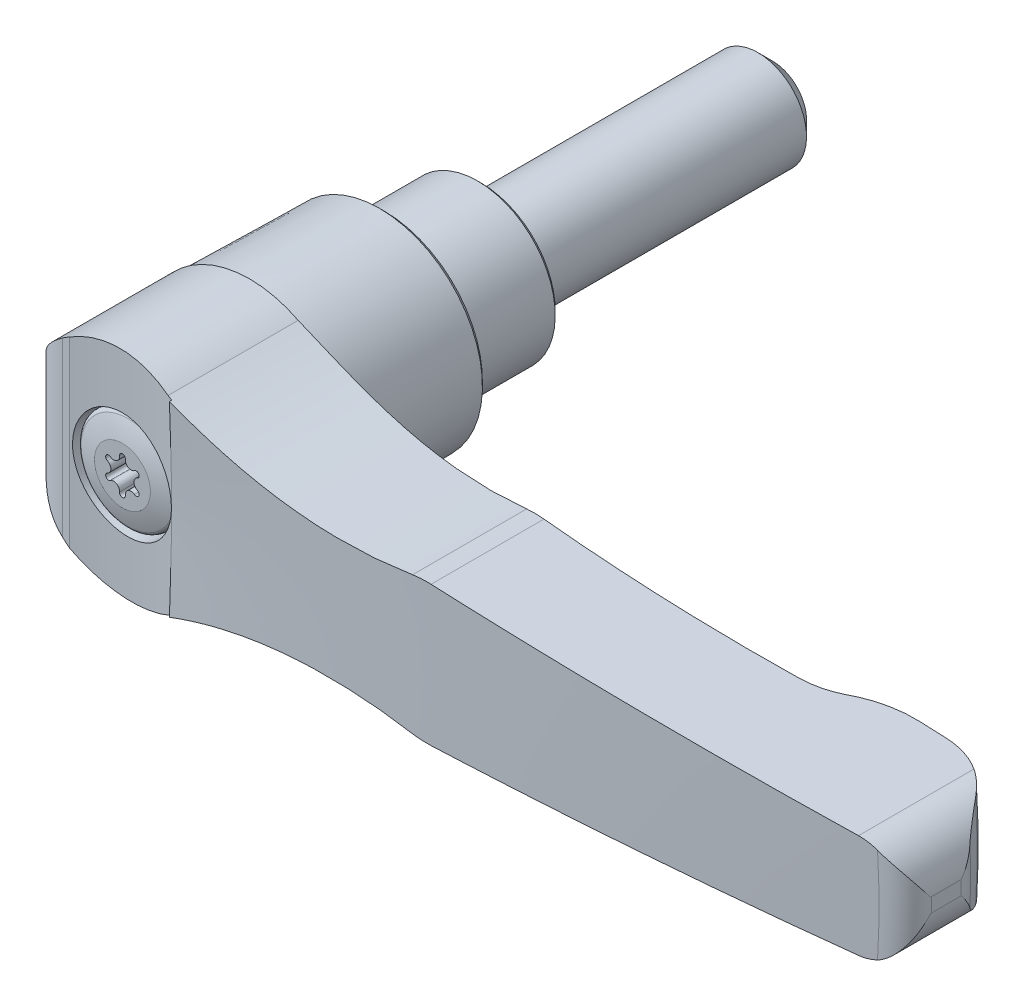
ISO-10303-21;
HEADER;
FILE_DESCRIPTION(('STEP AP214'),'2;1');
FILE_NAME('part.step','',(''),(''),'','','');
FILE_SCHEMA(('AUTOMOTIVE_DESIGN { 1 0 10303 214 1 1 1 1 }'));
ENDSEC;
DATA;
#1=APPLICATION_CONTEXT('core data for automotive mechanical design processes');
#2=APPLICATION_PROTOCOL_DEFINITION('international standard','automotive_design',2000,#1);
#3=PRODUCT_CONTEXT('',#1,'mechanical');
#4=PRODUCT('Part','Part','',(#3));
#5=PRODUCT_RELATED_PRODUCT_CATEGORY('part','',(#4));
#6=PRODUCT_DEFINITION_FORMATION('','',#4);
#7=PRODUCT_DEFINITION_CONTEXT('part definition',#1,'design');
#8=PRODUCT_DEFINITION('design','',#6,#7);
#9=PRODUCT_DEFINITION_SHAPE('','',#8);
#10=(LENGTH_UNIT() NAMED_UNIT(*) SI_UNIT(.MILLI.,.METRE.));
#11=(NAMED_UNIT(*) PLANE_ANGLE_UNIT() SI_UNIT($,.RADIAN.));
#12=(NAMED_UNIT(*) SI_UNIT($,.STERADIAN.) SOLID_ANGLE_UNIT());
#13=UNCERTAINTY_MEASURE_WITH_UNIT(LENGTH_MEASURE(1.E-05),#10,'distance_accuracy_value','');
#14=(GEOMETRIC_REPRESENTATION_CONTEXT(3) GLOBAL_UNCERTAINTY_ASSIGNED_CONTEXT((#13)) GLOBAL_UNIT_ASSIGNED_CONTEXT((#10,
#11,#12)) REPRESENTATION_CONTEXT('',''));
#15=CARTESIAN_POINT('',(0.,0.,0.));
#16=DIRECTION('',(0.,0.,1.));
#17=DIRECTION('',(1.,0.,0.));
#18=AXIS2_PLACEMENT_3D('',#15,#16,#17);
#19=CARTESIAN_POINT('',(0.,0.,27.75));
#20=DIRECTION('',(0.,0.,1.));
#21=DIRECTION('',(0.,-1.,0.));
#22=AXIS2_PLACEMENT_3D('',#19,#20,#21);
#23=CONICAL_SURFACE('',#22,5.15,0.0261799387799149);
#24=CARTESIAN_POINT('',(-3.82186723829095,3.79301788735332,36.7080789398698));
#25=CARTESIAN_POINT('',(-3.71534691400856,3.90028108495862,36.7062117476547));
#26=CARTESIAN_POINT('',(-3.60432455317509,4.00304517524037,36.704589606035));
#27=CARTESIAN_POINT('',(-3.37399930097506,4.19891926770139,36.7020096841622));
#28=CARTESIAN_POINT('',(-3.25469446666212,4.29202699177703,36.7010520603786));
#29=CARTESIAN_POINT('',(-3.0085890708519,4.4679591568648,36.6999680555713));
#30=CARTESIAN_POINT('',(-2.88178275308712,4.55077554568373,36.6998423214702));
#31=CARTESIAN_POINT('',(-2.62161264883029,4.7054859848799,36.7005758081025));
#32=CARTESIAN_POINT('',(-2.48824649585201,4.77737605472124,36.7014353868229));
#33=CARTESIAN_POINT('',(-2.21605276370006,4.90964048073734,36.7042708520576));
#34=CARTESIAN_POINT('',(-2.07722922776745,4.97002317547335,36.7062459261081));
#35=CARTESIAN_POINT('',(-1.79497035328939,5.07893378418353,36.7114191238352));
#36=CARTESIAN_POINT('',(-1.65153333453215,5.12745732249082,36.7146176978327));
#37=CARTESIAN_POINT('',(-1.36121177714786,5.21225729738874,36.7223126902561));
#38=CARTESIAN_POINT('',(-1.21432937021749,5.24854110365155,36.7268083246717));
#39=CARTESIAN_POINT('',(-0.918029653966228,5.30866584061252,36.7371445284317));
#40=CARTESIAN_POINT('',(-0.768611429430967,5.33250217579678,36.7429855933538));
#41=CARTESIAN_POINT('',(-0.468546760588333,5.36753437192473,36.7560131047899));
#42=CARTESIAN_POINT('',(-0.317902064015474,5.37874583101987,36.7631978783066));
#43=CARTESIAN_POINT('',(-0.0162164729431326,5.3885202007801,36.7788936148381));
#44=CARTESIAN_POINT('',(0.134824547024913,5.3870784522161,36.7874050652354));
#45=CARTESIAN_POINT('',(0.436130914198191,5.37156631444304,36.8056859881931));
#46=CARTESIAN_POINT('',(0.58639649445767,5.35749997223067,36.815455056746));
#47=CARTESIAN_POINT('',(0.885200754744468,5.31685490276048,36.8361582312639));
#48=CARTESIAN_POINT('',(1.03373877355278,5.29027153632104,36.8470927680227));
#49=CARTESIAN_POINT('',(1.32842726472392,5.22469830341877,36.8700247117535));
#50=CARTESIAN_POINT('',(1.47456945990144,5.18567228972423,36.882025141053));
#51=CARTESIAN_POINT('',(1.76304982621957,5.09551309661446,36.9068998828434));
#52=CARTESIAN_POINT('',(1.90538657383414,5.04437545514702,36.9197745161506));
#53=CARTESIAN_POINT('',(2.18517812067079,4.93037916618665,36.9461969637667));
#54=CARTESIAN_POINT('',(2.32263450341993,4.86752436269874,36.9597445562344));
#55=CARTESIAN_POINT('',(2.59177729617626,4.73053715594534,36.987298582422));
#56=CARTESIAN_POINT('',(2.72346154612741,4.65640057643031,37.0013051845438));
#57=CARTESIAN_POINT('',(3.11008075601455,4.41677811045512,37.0438406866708));
#58=CARTESIAN_POINT('',(3.35498940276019,4.23472918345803,37.0727317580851));
#59=CARTESIAN_POINT('',(3.81061841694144,3.83201391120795,37.1293132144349));
#60=CARTESIAN_POINT('',(4.02133817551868,3.61134687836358,37.1570035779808));
#61=CARTESIAN_POINT('',(4.40299814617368,3.13710131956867,37.2090851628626));
#62=CARTESIAN_POINT('',(4.57389146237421,2.88348453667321,37.2334724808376));
#63=CARTESIAN_POINT('',(4.8704857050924,2.35066468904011,37.2769076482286));
#64=CARTESIAN_POINT('',(4.99618921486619,2.07146308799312,37.2959558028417));
#65=CARTESIAN_POINT('',(5.19764854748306,1.49811632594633,37.3269450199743));
#66=CARTESIAN_POINT('',(5.27385550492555,1.20413322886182,37.3389501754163));
#67=CARTESIAN_POINT('',(5.37579370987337,0.607338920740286,37.3550873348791));
#68=CARTESIAN_POINT('',(5.40152887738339,0.304528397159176,37.3592199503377));
#69=CARTESIAN_POINT('',(5.40172286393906,-0.29769106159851,37.3592512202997));
#70=CARTESIAN_POINT('',(5.37675477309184,-0.597099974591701,37.35524190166));
#71=CARTESIAN_POINT('',(5.27746605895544,-1.18740212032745,37.3395194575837));
#72=CARTESIAN_POINT('',(5.20314585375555,-1.47829542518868,37.3278063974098));
#73=CARTESIAN_POINT('',(5.00745942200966,-2.04324075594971,37.2976749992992));
#74=CARTESIAN_POINT('',(4.88611822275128,-2.31730165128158,37.2792602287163));
#75=CARTESIAN_POINT('',(4.59994520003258,-2.84124816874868,37.2372335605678));
#76=CARTESIAN_POINT('',(4.43511078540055,-3.09113234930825,37.2136213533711));
#77=CARTESIAN_POINT('',(4.06463235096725,-3.56252869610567,37.1627855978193));
#78=CARTESIAN_POINT('',(3.85857005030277,-3.78370822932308,37.1355260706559));
#79=CARTESIAN_POINT('',(3.41254071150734,-4.18853503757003,37.0796758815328));
#80=CARTESIAN_POINT('',(3.17257159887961,-4.37218001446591,37.0510851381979));
#81=CARTESIAN_POINT('',(2.66278140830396,-4.69856745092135,36.994342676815));
#82=CARTESIAN_POINT('',(2.39268640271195,-4.84088357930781,36.9661981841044));
#83=CARTESIAN_POINT('',(1.83217160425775,-5.07809992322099,36.9125421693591));
#84=CARTESIAN_POINT('',(1.54175179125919,-5.17300009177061,36.8870306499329));
#85=CARTESIAN_POINT('',(0.948774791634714,-5.31257948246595,36.8401550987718));
#86=CARTESIAN_POINT('',(0.646218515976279,-5.35726246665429,36.8187907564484));
#87=CARTESIAN_POINT('',(0.0375867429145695,-5.39498080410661,36.7812079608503));
#88=CARTESIAN_POINT('',(-0.268488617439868,-5.38801816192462,36.7649893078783));
#89=CARTESIAN_POINT('',(-0.873320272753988,-5.32272310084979,36.7381921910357));
#90=CARTESIAN_POINT('',(-1.17211141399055,-5.26472804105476,36.7275774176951));
#91=CARTESIAN_POINT('',(-1.75586295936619,-5.09937269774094,36.7116339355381));
#92=CARTESIAN_POINT('',(-2.04082365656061,-4.99201346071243,36.7063051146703));
#93=CARTESIAN_POINT('',(-2.58762584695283,-4.73149608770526,36.7002185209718));
#94=CARTESIAN_POINT('',(-2.84955219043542,-4.57851601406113,36.6994432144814));
#95=CARTESIAN_POINT('',(-3.34420500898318,-4.23075694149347,36.7012936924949));
#96=CARTESIAN_POINT('',(-3.57693118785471,-4.03597751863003,36.7039195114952));
#97=CARTESIAN_POINT('',(-3.89903010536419,-3.71679841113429,36.709377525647));
#98=CARTESIAN_POINT('',(-4.00199323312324,-3.60577103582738,36.7114531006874));
#99=CARTESIAN_POINT('',(-4.19820603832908,-3.37546663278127,36.7159314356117));
#100=CARTESIAN_POINT('',(-4.29145927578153,-3.25619265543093,36.7183340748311));
#101=CARTESIAN_POINT('',(-4.46762204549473,-3.01018379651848,36.7232909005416));
#102=CARTESIAN_POINT('',(-4.55052767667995,-2.88344612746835,36.7258451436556));
#103=CARTESIAN_POINT('',(-4.70534739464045,-2.62348619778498,36.7309338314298));
#104=CARTESIAN_POINT('',(-4.77726552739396,-2.49026634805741,36.7334682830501));
#105=CARTESIAN_POINT('',(-4.90972659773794,-2.2180457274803,36.7383656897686));
#106=CARTESIAN_POINT('',(-4.97025295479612,-2.07903688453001,36.7407283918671));
#107=CARTESIAN_POINT('',(-5.07934789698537,-1.79645762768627,36.7451389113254));
#108=CARTESIAN_POINT('',(-5.12792090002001,-1.65288892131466,36.7471868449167));
#109=CARTESIAN_POINT('',(-5.21280239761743,-1.36211419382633,36.750853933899));
#110=CARTESIAN_POINT('',(-5.24910688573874,-1.21490700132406,36.7524729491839));
#111=CARTESIAN_POINT('',(-5.30915612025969,-0.918004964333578,36.7551917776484));
#112=CARTESIAN_POINT('',(-5.33290553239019,-0.768311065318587,36.7562917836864));
#113=CARTESIAN_POINT('',(-5.36767150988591,-0.467638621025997,36.7579130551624));
#114=CARTESIAN_POINT('',(-5.37870396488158,-0.316661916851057,36.7584350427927));
#115=CARTESIAN_POINT('',(-5.38800813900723,-0.0143709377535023,36.7588747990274));
#116=CARTESIAN_POINT('',(-5.38628458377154,0.136943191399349,36.7587927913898));
#117=CARTESIAN_POINT('',(-5.37009558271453,0.438975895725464,36.758029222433));
#118=CARTESIAN_POINT('',(-5.35562265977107,0.589694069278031,36.7573473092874));
#119=CARTESIAN_POINT('',(-5.31403708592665,0.889315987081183,36.7554202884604));
#120=CARTESIAN_POINT('',(-5.28692909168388,1.03822037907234,36.7541753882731));
#121=CARTESIAN_POINT('',(-5.22027737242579,1.33318140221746,36.7511900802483));
#122=CARTESIAN_POINT('',(-5.18073627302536,1.47923862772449,36.749449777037));
#123=CARTESIAN_POINT('',(-5.08951807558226,1.7674479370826,36.7455701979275));
#124=CARTESIAN_POINT('',(-5.03784539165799,1.90960142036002,36.7434310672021));
#125=CARTESIAN_POINT('',(-4.92276837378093,2.18894714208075,36.738876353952));
#126=CARTESIAN_POINT('',(-4.85937318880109,2.32614315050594,36.7364609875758));
#127=CARTESIAN_POINT('',(-4.72130226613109,2.59467891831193,36.7314958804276));
#128=CARTESIAN_POINT('',(-4.64662917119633,2.72602004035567,36.728946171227));
#129=CARTESIAN_POINT('',(-4.46041720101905,3.02367013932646,36.7230432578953));
#130=CARTESIAN_POINT('',(-4.34479079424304,3.18744274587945,36.7196987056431));
#131=CARTESIAN_POINT('',(-4.0960291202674,3.50111159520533,36.7134525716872));
#132=CARTESIAN_POINT('',(-3.96289380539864,3.65100780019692,36.7105509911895));
#133=CARTESIAN_POINT('',(-3.82186723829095,3.79301788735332,36.7080789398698));
#134=B_SPLINE_CURVE_WITH_KNOTS('',3,(#24,#25,#26,#27,#28,#29,#30,#31,#32,#33,#34,#35,#36,#37,
#38,#39,#40,#41,#42,#43,#44,#45,#46,#47,#48,#49,#50,#51,#52,#53,#54,#55,#56,#57,#58,#59,#60,#61,
#62,#63,#64,#65,#66,#67,#68,#69,#70,#71,#72,#73,#74,#75,#76,#77,#78,#79,#80,#81,#82,#83,#84,#85,
#86,#87,#88,#89,#90,#91,#92,#93,#94,#95,#96,#97,#98,#99,#100,#101,#102,#103,#104,#105,#106,#107,
#108,#109,#110,#111,#112,#113,#114,#115,#116,#117,#118,#119,#120,#121,#122,#123,#124,#125,#126,
#127,#128,#129,#130,#131,#132,#133),.UNSPECIFIED.,.T.,.F.,(4,2,2,2,2,2,2,2,2,2,2,2,2,2,2,2,2,2,
2,2,2,2,2,2,2,2,2,2,2,2,2,2,2,2,2,2,2,2,2,2,2,2,2,2,2,2,2,2,2,2,2,2,2,2,4),(0.,
0.453366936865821,0.906840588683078,1.36066684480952,1.81465803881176,2.26831899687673,
2.72214709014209,3.17570143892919,3.62942311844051,4.0825836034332,4.53591096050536,
4.98909304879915,5.44244323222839,5.89712263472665,6.35196980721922,6.8066680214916,
7.26153496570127,8.17638541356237,9.09125215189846,10.007190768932,10.9230770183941,
11.8304937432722,12.7378399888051,13.634987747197,14.5321279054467,15.4287912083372,
16.3255079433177,17.2318313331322,18.1382101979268,19.0536313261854,19.9690533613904,
20.8844068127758,21.7997247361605,22.7090368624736,23.6183297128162,24.5241189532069,
25.4299173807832,25.8837842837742,26.3374841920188,26.7913546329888,27.2450575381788,
27.6994157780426,28.1536058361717,28.6079440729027,29.0621133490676,29.5157145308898,
29.969147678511,30.4228469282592,30.8763790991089,31.3298155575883,31.7830872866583,
32.2360067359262,32.6888202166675,33.2890494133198,33.8892802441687),.UNSPECIFIED.);
#135=CARTESIAN_POINT('',(-3.82186723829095,3.79301788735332,36.7080789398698));
#136=VERTEX_POINT('',#135);
#137=EDGE_CURVE('E521',#136,#136,#134,.T.);
#138=ORIENTED_EDGE('',*,*,#137,.F.);
#139=EDGE_LOOP('',(#138));
#140=FACE_BOUND('',#139,.T.);
#141=CARTESIAN_POINT('',(0.,0.,33.));
#142=DIRECTION('',(0.,0.,-1.));
#143=DIRECTION('',(-1.,0.,0.));
#144=AXIS2_PLACEMENT_3D('',#141,#142,#143);
#145=CIRCLE('',#144,5.28747608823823);
#146=CARTESIAN_POINT('',(-5.28747608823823,0.,33.));
#147=VERTEX_POINT('',#146);
#148=EDGE_CURVE('E299',#147,#147,#145,.T.);
#149=ORIENTED_EDGE('',*,*,#148,.T.);
#150=EDGE_LOOP('',(#149));
#151=FACE_BOUND('',#150,.T.);
#152=ADVANCED_FACE('F14',(#140,#151),#23,.F.);
#153=CARTESIAN_POINT('',(0.,0.,-20.));
#154=DIRECTION('',(0.,0.,-1.));
#155=DIRECTION('',(0.,1.,0.));
#156=AXIS2_PLACEMENT_3D('',#153,#154,#155);
#157=CYLINDRICAL_SURFACE('',#156,5.);
#158=CARTESIAN_POINT('',(0.,0.,-28.5));
#159=DIRECTION('',(0.,0.,-1.));
#160=DIRECTION('',(0.,1.,0.));
#161=AXIS2_PLACEMENT_3D('',#158,#159,#160);
#162=CIRCLE('',#161,5.);
#163=CARTESIAN_POINT('',(0.,5.,-28.5));
#164=VERTEX_POINT('',#163);
#165=EDGE_CURVE('E9',#164,#164,#162,.F.);
#166=ORIENTED_EDGE('',*,*,#165,.T.);
#167=EDGE_LOOP('',(#166));
#168=FACE_BOUND('',#167,.T.);
#169=CARTESIAN_POINT('',(0.,0.,0.));
#170=DIRECTION('',(0.,0.,-1.));
#171=DIRECTION('',(0.,1.,0.));
#172=AXIS2_PLACEMENT_3D('',#169,#170,#171);
#173=CIRCLE('',#172,5.);
#174=CARTESIAN_POINT('',(0.,5.,0.));
#175=VERTEX_POINT('',#174);
#176=EDGE_CURVE('E362',#175,#175,#173,.T.);
#177=ORIENTED_EDGE('',*,*,#176,.T.);
#178=EDGE_LOOP('',(#177));
#179=FACE_BOUND('',#178,.T.);
#180=ADVANCED_FACE('F512',(#168,#179),#157,.T.);
#181=CARTESIAN_POINT('',(7.6,0.,0.));
#182=DIRECTION('',(0.,0.,1.));
#183=DIRECTION('',(0.,-1.,0.));
#184=AXIS2_PLACEMENT_3D('',#181,#182,#183);
#185=PLANE('',#184);
#186=ORIENTED_EDGE('',*,*,#176,.F.);
#187=EDGE_LOOP('',(#186));
#188=FACE_BOUND('',#187,.T.);
#189=CARTESIAN_POINT('',(0.,0.,0.));
#190=DIRECTION('',(0.,0.,-1.));
#191=DIRECTION('',(0.,1.,0.));
#192=AXIS2_PLACEMENT_3D('',#189,#190,#191);
#193=CIRCLE('',#192,7.6);
#194=CARTESIAN_POINT('',(0.,7.6,0.));
#195=VERTEX_POINT('',#194);
#196=EDGE_CURVE('E985',#195,#195,#193,.T.);
#197=ORIENTED_EDGE('',*,*,#196,.T.);
#198=EDGE_LOOP('',(#197));
#199=FACE_BOUND('',#198,.T.);
#200=ADVANCED_FACE('F403',(#188,#199),#185,.F.);
#201=CARTESIAN_POINT('',(-2.9000000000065,-22.,89.3000000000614));
#202=DIRECTION('',(0.,1.,0.));
#203=DIRECTION('',(-1.,0.,0.));
#204=AXIS2_PLACEMENT_3D('',#201,#202,#203);
#205=CYLINDRICAL_SURFACE('',#204,52.6000000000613);
#206=CARTESIAN_POINT('',(4.99999999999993,9.79795897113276,37.29663472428));
#207=CARTESIAN_POINT('',(4.72836499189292,9.9366097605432,37.2553500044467));
#208=CARTESIAN_POINT('',(4.45077156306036,10.0639978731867,37.2153761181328));
#209=CARTESIAN_POINT('',(3.88554818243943,10.2954169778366,37.1387392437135));
#210=CARTESIAN_POINT('',(3.59791744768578,10.3994461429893,37.1020765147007));
#211=CARTESIAN_POINT('',(3.01491777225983,10.5831754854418,37.0328024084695));
#212=CARTESIAN_POINT('',(2.71955925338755,10.6629067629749,37.0001858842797));
#213=CARTESIAN_POINT('',(2.12279313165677,10.79755975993,36.9395048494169));
#214=CARTESIAN_POINT('',(1.82138582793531,10.8524827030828,36.9114401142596));
#215=CARTESIAN_POINT('',(1.21421772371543,10.9370815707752,36.8602616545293));
#216=CARTESIAN_POINT('',(0.90845167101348,10.966723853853,36.8371545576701));
#217=CARTESIAN_POINT('',(0.295018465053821,11.0003346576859,36.7962250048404));
#218=CARTESIAN_POINT('',(-0.0126494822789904,11.0042916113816,36.7784049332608));
#219=CARTESIAN_POINT('',(-0.627464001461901,10.9863940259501,36.7482132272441));
#220=CARTESIAN_POINT('',(-0.934610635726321,10.9645428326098,36.7358408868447));
#221=CARTESIAN_POINT('',(-1.54601934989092,10.8951569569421,36.7165401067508));
#222=CARTESIAN_POINT('',(-1.85028266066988,10.8476337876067,36.709609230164));
#223=CARTESIAN_POINT('',(-2.46439079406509,10.7251200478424,36.7008764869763));
#224=CARTESIAN_POINT('',(-2.77405858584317,10.64922685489,36.6992625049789));
#225=CARTESIAN_POINT('',(-3.38564496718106,10.4708596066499,36.7013524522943));
#226=CARTESIAN_POINT('',(-3.68756293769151,10.3683834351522,36.705056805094));
#227=CARTESIAN_POINT('',(-4.28200890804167,10.1373700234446,36.7173174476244));
#228=CARTESIAN_POINT('',(-4.5745119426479,10.0087692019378,36.7258856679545));
#229=CARTESIAN_POINT('',(-5.14711147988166,9.72673276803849,36.7472344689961));
#230=CARTESIAN_POINT('',(-5.42720860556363,9.57329840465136,36.7600148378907));
#231=CARTESIAN_POINT('',(-5.70000000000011,9.40797534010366,36.774577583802));
#232=B_SPLINE_CURVE_WITH_KNOTS('',3,(#206,#207,#208,#209,#210,#211,#212,#213,#214,#215,#216,
#217,#218,#219,#220,#221,#222,#223,#224,#225,#226,#227,#228,#229,#230,#231),.UNSPECIFIED.,.F.,
.F.,(4,2,2,2,2,2,2,2,2,2,2,2,4),(0.,0.923020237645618,1.84611263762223,2.76801850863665,
3.68987889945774,4.61296412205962,5.53646501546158,6.4598461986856,7.38281362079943,
8.33806499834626,9.29339244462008,10.2510734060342,11.2087062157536),.UNSPECIFIED.);
#233=CARTESIAN_POINT('',(4.99999999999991,9.7979589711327,37.29663472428));
#234=VERTEX_POINT('',#233);
#235=CARTESIAN_POINT('',(-5.7000000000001,9.40797534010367,36.774577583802));
#236=VERTEX_POINT('',#235);
#237=EDGE_CURVE('E435',#234,#236,#232,.T.);
#238=ORIENTED_EDGE('',*,*,#237,.T.);
#239=DIRECTION('',(0.,1.,0.));
#240=VECTOR('',#239,1.);
#241=CARTESIAN_POINT('',(-5.7000000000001,-22.,36.774577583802));
#242=LINE('',#241,#240);
#243=CARTESIAN_POINT('',(-5.7000000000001,-9.4079753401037,36.774577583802));
#244=VERTEX_POINT('',#243);
#245=EDGE_CURVE('E368',#244,#236,#242,.T.);
#246=ORIENTED_EDGE('',*,*,#245,.F.);
#247=CARTESIAN_POINT('',(-5.70000000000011,-9.40797534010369,36.774577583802));
#248=CARTESIAN_POINT('',(-5.43970332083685,-9.56571993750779,36.7606846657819));
#249=CARTESIAN_POINT('',(-5.17275915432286,-9.71264560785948,36.7484111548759));
#250=CARTESIAN_POINT('',(-4.62749279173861,-9.9839292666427,36.727671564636));
#251=CARTESIAN_POINT('',(-4.34917039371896,-10.1082868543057,36.7192055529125));
#252=CARTESIAN_POINT('',(-3.7836735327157,-10.3332602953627,36.706663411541));
#253=CARTESIAN_POINT('',(-3.49651907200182,-10.4339258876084,36.7025780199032));
#254=CARTESIAN_POINT('',(-2.91484226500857,-10.6111316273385,36.699198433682));
#255=CARTESIAN_POINT('',(-2.62032018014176,-10.6876726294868,36.6999040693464));
#256=CARTESIAN_POINT('',(-2.02570589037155,-10.8161512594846,36.7064252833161));
#257=CARTESIAN_POINT('',(-1.7256084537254,-10.8680644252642,36.7122459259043));
#258=CARTESIAN_POINT('',(-1.12215614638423,-10.9468441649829,36.7291866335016));
#259=CARTESIAN_POINT('',(-0.818799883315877,-10.9736995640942,36.7403090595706));
#260=CARTESIAN_POINT('',(-0.211043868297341,-11.0021831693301,36.7678948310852));
#261=CARTESIAN_POINT('',(0.0933562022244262,-11.0038028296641,36.7843599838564));
#262=CARTESIAN_POINT('',(0.700782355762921,-10.981859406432,36.8225100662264));
#263=CARTESIAN_POINT('',(1.00380896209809,-10.9583068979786,36.844192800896));
#264=CARTESIAN_POINT('',(1.62703646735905,-10.883833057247,36.8941780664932));
#265=CARTESIAN_POINT('',(1.94700070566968,-10.8311562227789,36.9228309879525));
#266=CARTESIAN_POINT('',(2.58058446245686,-10.6979165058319,36.9853308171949));
#267=CARTESIAN_POINT('',(2.89420315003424,-10.6173499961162,37.0191784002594));
#268=CARTESIAN_POINT('',(3.51321915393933,-10.4289071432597,37.0914975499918));
#269=CARTESIAN_POINT('',(3.81860000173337,-10.3209800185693,37.1299776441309));
#270=CARTESIAN_POINT('',(4.41821395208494,-10.078894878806,37.2106925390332));
#271=CARTESIAN_POINT('',(4.71244874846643,-9.94474086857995,37.2529267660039));
#272=CARTESIAN_POINT('',(5.0000000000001,-9.7979589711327,37.29663472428));
#273=B_SPLINE_CURVE_WITH_KNOTS('',3,(#247,#248,#249,#250,#251,#252,#253,#254,#255,#256,#257,
#258,#259,#260,#261,#262,#263,#264,#265,#266,#267,#268,#269,#270,#271,#272),.UNSPECIFIED.,.F.,
.F.,(4,2,2,2,2,2,2,2,2,2,2,2,4),(0.,0.913785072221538,1.82758637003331,2.73945177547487,
3.65128487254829,4.56402177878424,5.47716553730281,6.39061851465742,7.30368789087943,
8.27897178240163,9.25438256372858,10.2316171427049,11.2087026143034),.UNSPECIFIED.);
#274=CARTESIAN_POINT('',(5.00000000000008,-9.79795897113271,37.29663472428));
#275=VERTEX_POINT('',#274);
#276=EDGE_CURVE('E421',#244,#275,#273,.T.);
#277=ORIENTED_EDGE('',*,*,#276,.T.);
#278=CARTESIAN_POINT('',(5.43597073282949,-9.62987816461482,37.36473652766));
#279=CARTESIAN_POINT('',(5.36321973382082,-9.65752809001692,37.3530600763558));
#280=CARTESIAN_POINT('',(5.29051333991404,-9.68535978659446,37.341546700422));
#281=CARTESIAN_POINT('',(5.14518976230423,-9.74138672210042,37.3188460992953));
#282=CARTESIAN_POINT('',(5.07257257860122,-9.76958196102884,37.3076588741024));
#283=CARTESIAN_POINT('',(5.00000000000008,-9.79795897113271,37.29663472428));
#284=B_SPLINE_CURVE_WITH_KNOTS('',3,(#278,#279,#280,#281,#282,#283),.UNSPECIFIED.,.F.,.F.,(4,2,
4),(0.,0.236094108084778,0.472188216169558),.UNSPECIFIED.);
#285=CARTESIAN_POINT('',(5.4359707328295,-9.62987816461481,37.36473652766));
#286=VERTEX_POINT('',#285);
#287=EDGE_CURVE('E410',#286,#275,#284,.T.);
#288=ORIENTED_EDGE('',*,*,#287,.F.);
#289=DIRECTION('',(0.,1.,0.));
#290=VECTOR('',#289,1.);
#291=CARTESIAN_POINT('',(5.43597073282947,-22.,37.36473652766));
#292=LINE('',#291,#290);
#293=CARTESIAN_POINT('',(5.43597073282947,0.,37.36473652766));
#294=VERTEX_POINT('',#293);
#295=EDGE_CURVE('E37',#286,#294,#292,.T.);
#296=ORIENTED_EDGE('',*,*,#295,.T.);
#297=CARTESIAN_POINT('',(5.43597073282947,9.62987816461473,37.36473652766));
#298=VERTEX_POINT('',#297);
#299=EDGE_CURVE('E365',#294,#298,#292,.T.);
#300=ORIENTED_EDGE('',*,*,#299,.T.);
#301=CARTESIAN_POINT('',(4.99999999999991,9.7979589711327,37.29663472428));
#302=CARTESIAN_POINT('',(5.07257257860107,9.76958196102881,37.3076588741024));
#303=CARTESIAN_POINT('',(5.14518976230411,9.74138672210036,37.3188460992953));
#304=CARTESIAN_POINT('',(5.29051333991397,9.68535978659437,37.341546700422));
#305=CARTESIAN_POINT('',(5.36321973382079,9.65752809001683,37.3530600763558));
#306=CARTESIAN_POINT('',(5.43597073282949,9.62987816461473,37.36473652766));
#307=B_SPLINE_CURVE_WITH_KNOTS('',3,(#301,#302,#303,#304,#305,#306),.UNSPECIFIED.,.F.,.F.,(4,2,
4),(0.,0.236094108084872,0.472188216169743),.UNSPECIFIED.);
#308=EDGE_CURVE('E428',#234,#298,#307,.T.);
#309=ORIENTED_EDGE('',*,*,#308,.F.);
#310=EDGE_LOOP('',(#238,#246,#277,#288,#296,#300,#309));
#311=FACE_BOUND('',#310,.T.);
#312=ORIENTED_EDGE('',*,*,#137,.T.);
#313=EDGE_LOOP('',(#312));
#314=FACE_BOUND('',#313,.T.);
#315=ADVANCED_FACE('F399',(#311,#314),#205,.F.);
#316=CARTESIAN_POINT('',(0.,0.,-577.800000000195));
#317=DIRECTION('',(0.,0.,-1.));
#318=DIRECTION('',(0.,1.,0.));
#319=AXIS2_PLACEMENT_3D('',#316,#317,#318);
#320=DEGENERATE_TOROIDAL_SURFACE('',#319,33.3999999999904,615.800000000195,.T.);
#321=CARTESIAN_POINT('',(30.9002,7.10003333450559,37.9976683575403));
#322=CARTESIAN_POINT('',(30.2294569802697,6.98822969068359,37.9958049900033));
#323=CARTESIAN_POINT('',(29.5563953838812,6.8904055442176,37.9928133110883));
#324=CARTESIAN_POINT('',(28.2067936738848,6.7228472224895,37.9846275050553));
#325=CARTESIAN_POINT('',(27.5302535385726,6.6531132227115,37.9794333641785));
#326=CARTESIAN_POINT('',(26.1747400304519,6.54185757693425,37.9668957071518));
#327=CARTESIAN_POINT('',(25.4957662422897,6.5003410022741,37.9595518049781));
#328=CARTESIAN_POINT('',(24.1367720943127,6.44559969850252,37.9428222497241));
#329=CARTESIAN_POINT('',(23.4567517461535,6.43237465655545,37.9334366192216));
#330=CARTESIAN_POINT('',(21.4461065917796,6.43516844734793,37.9028483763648));
#331=CARTESIAN_POINT('',(20.1152587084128,6.49125306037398,37.878929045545));
#332=CARTESIAN_POINT('',(18.1264981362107,6.65637631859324,37.8390449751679));
#333=CARTESIAN_POINT('',(17.464852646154,6.72491301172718,37.8250833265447));
#334=CARTESIAN_POINT('',(16.1449136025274,6.88885393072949,37.7962639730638));
#335=CARTESIAN_POINT('',(15.4866198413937,6.98425647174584,37.7814063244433));
#336=CARTESIAN_POINT('',(13.9966493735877,7.23126043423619,37.7473031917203));
#337=CARTESIAN_POINT('',(13.1663283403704,7.39108521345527,37.727959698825));
#338=CARTESIAN_POINT('',(11.5152169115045,7.75343699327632,37.690522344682));
#339=CARTESIAN_POINT('',(10.694424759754,7.9559559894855,37.6724282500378));
#340=CARTESIAN_POINT('',(9.05285416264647,8.40635359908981,37.6397736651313));
#341=CARTESIAN_POINT('',(8.23223752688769,8.6548288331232,37.6252663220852));
#342=CARTESIAN_POINT('',(7.01185980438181,9.05958984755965,37.608666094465));
#343=CARTESIAN_POINT('',(6.60676296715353,9.19987583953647,37.603992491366));
#344=CARTESIAN_POINT('',(5.80036915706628,9.49103692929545,37.5966508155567));
#345=CARTESIAN_POINT('',(5.39907222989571,9.64191215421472,37.5939827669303));
#346=CARTESIAN_POINT('',(4.9997999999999,9.79803717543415,37.5924593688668));
#347=B_SPLINE_CURVE_WITH_KNOTS('',3,(#321,#322,#323,#324,#325,#326,#327,#328,#329,#330,#331,
#332,#333,#334,#335,#336,#337,#338,#339,#340,#341,#342,#343,#344,#345,#346),.UNSPECIFIED.,.F.,
.F.,(4,2,2,2,2,2,2,2,2,2,2,2,4),(0.,2.03983506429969,4.07968287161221,6.11989719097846,
8.16008895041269,12.1515193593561,14.1470960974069,16.1425477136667,18.6787308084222,
21.2144388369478,23.7857285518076,25.0717731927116,26.3578332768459),.UNSPECIFIED.);
#348=CARTESIAN_POINT('',(30.9,7.1,37.997667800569));
#349=VERTEX_POINT('',#348);
#350=CARTESIAN_POINT('',(5.4359707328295,9.62987816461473,37.5945767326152));
#351=VERTEX_POINT('',#350);
#352=EDGE_CURVE('E1012',#349,#351,#347,.T.);
#353=ORIENTED_EDGE('',*,*,#352,.T.);
#354=CARTESIAN_POINT('',(5.4359707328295,0.139704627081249,37.364818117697));
#355=CARTESIAN_POINT('',(5.4359707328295,0.0263223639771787,37.3646847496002));
#356=CARTESIAN_POINT('',(5.4359707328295,-0.087059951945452,37.3647143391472));
#357=CARTESIAN_POINT('',(5.4359707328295,-0.31382488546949,37.3650945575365));
#358=CARTESIAN_POINT('',(5.4359707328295,-0.427207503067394,37.3654451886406));
#359=CARTESIAN_POINT('',(5.4359707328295,-0.767350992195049,37.3669741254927));
#360=CARTESIAN_POINT('',(5.4359707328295,-0.994109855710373,37.3686294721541));
#361=CARTESIAN_POINT('',(5.4359707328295,-1.44760096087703,37.3731244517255));
#362=CARTESIAN_POINT('',(5.4359707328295,-1.67433320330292,37.3759640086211));
#363=CARTESIAN_POINT('',(5.4359707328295,-2.12778335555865,37.3826896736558));
#364=CARTESIAN_POINT('',(5.4359707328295,-2.35450126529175,37.3865757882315));
#365=CARTESIAN_POINT('',(5.4359707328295,-2.80788425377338,37.3952314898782));
#366=CARTESIAN_POINT('',(5.4359707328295,-3.03454933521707,37.4000009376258));
#367=CARTESIAN_POINT('',(5.4359707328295,-3.48786247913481,37.4102594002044));
#368=CARTESIAN_POINT('',(5.4359707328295,-3.71451054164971,37.4157484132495));
#369=CARTESIAN_POINT('',(5.4359707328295,-4.3944531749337,37.4330569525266));
#370=CARTESIAN_POINT('',(5.4359707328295,-4.84772616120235,37.445717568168));
#371=CARTESIAN_POINT('',(5.4359707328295,-5.75417804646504,37.4722642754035));
#372=CARTESIAN_POINT('',(5.4359707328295,-6.20735695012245,37.4861502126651));
#373=CARTESIAN_POINT('',(5.4359707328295,-7.11369823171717,37.5144555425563));
#374=CARTESIAN_POINT('',(5.4359707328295,-7.56686060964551,37.528874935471));
#375=CARTESIAN_POINT('',(5.4359707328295,-8.47318366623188,37.5577843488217));
#376=CARTESIAN_POINT('',(5.4359707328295,-8.92634434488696,37.5722743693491));
#377=CARTESIAN_POINT('',(5.4359707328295,-9.83267306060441,37.6010218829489));
#378=CARTESIAN_POINT('',(5.4359707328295,-10.2858410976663,37.615279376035));
#379=CARTESIAN_POINT('',(5.4359707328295,-11.6453393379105,37.657378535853));
#380=CARTESIAN_POINT('',(5.4359707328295,-12.5516906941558,37.6845477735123));
#381=CARTESIAN_POINT('',(5.4359707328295,-14.3644725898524,37.7361289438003));
#382=CARTESIAN_POINT('',(5.4359707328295,-15.2709031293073,37.7605408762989));
#383=CARTESIAN_POINT('',(5.4359707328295,-17.0838968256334,37.8061411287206));
#384=CARTESIAN_POINT('',(5.4359707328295,-17.9904599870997,37.8273292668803));
#385=CARTESIAN_POINT('',(5.4359707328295,-19.8036600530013,37.8662106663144));
#386=CARTESIAN_POINT('',(5.4359707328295,-20.7102969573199,37.8839039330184));
#387=CARTESIAN_POINT('',(5.4359707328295,-22.5236728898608,37.9156376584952));
#388=CARTESIAN_POINT('',(5.4359707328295,-23.4304119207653,37.929677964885));
#389=CARTESIAN_POINT('',(5.4359707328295,-25.2439454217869,37.9540054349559));
#390=CARTESIAN_POINT('',(5.4359707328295,-26.1507398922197,37.9642925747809));
#391=CARTESIAN_POINT('',(5.4359707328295,-28.8758498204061,37.9894632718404));
#392=CARTESIAN_POINT('',(5.4359707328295,-30.6942231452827,37.9985735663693));
#393=CARTESIAN_POINT('',(5.4359707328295,-34.3309833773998,38.001117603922));
#394=CARTESIAN_POINT('',(5.4359707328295,-36.1493702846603,37.9945512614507));
#395=CARTESIAN_POINT('',(5.4359707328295,-41.6044064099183,37.9510940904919));
#396=CARTESIAN_POINT('',(5.4359707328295,-45.2408980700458,37.8904448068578));
#397=CARTESIAN_POINT('',(5.4359707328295,-52.5123746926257,37.7052257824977));
#398=CARTESIAN_POINT('',(5.4359707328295,-56.147359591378,37.5806535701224));
#399=CARTESIAN_POINT('',(5.4359707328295,-63.4145638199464,37.2674123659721));
#400=CARTESIAN_POINT('',(5.4359707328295,-67.046783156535,37.0787435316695));
#401=CARTESIAN_POINT('',(5.4359707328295,-74.3112406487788,36.6370156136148));
#402=CARTESIAN_POINT('',(5.4359707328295,-77.943474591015,36.3838872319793));
#403=CARTESIAN_POINT('',(5.4359707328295,-85.2028595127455,35.813362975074));
#404=CARTESIAN_POINT('',(5.4359707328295,-88.8300105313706,35.4959675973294));
#405=CARTESIAN_POINT('',(5.4359707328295,-96.0785329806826,34.7969300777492));
#406=CARTESIAN_POINT('',(5.4359707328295,-99.6999037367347,34.4152809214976));
#407=CARTESIAN_POINT('',(5.4359707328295,-106.935372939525,33.5878576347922));
#408=CARTESIAN_POINT('',(5.4359707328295,-110.54947113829,33.1420813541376));
#409=CARTESIAN_POINT('',(5.4359707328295,-121.445659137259,31.6999206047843));
#410=CARTESIAN_POINT('',(5.4359707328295,-128.715080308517,30.6051121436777));
#411=CARTESIAN_POINT('',(5.4359707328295,-139.58597763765,28.768381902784));
#412=CARTESIAN_POINT('',(5.4359707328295,-143.204228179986,28.1236865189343));
#413=CARTESIAN_POINT('',(5.4359707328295,-150.428776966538,26.7696133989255));
#414=CARTESIAN_POINT('',(5.4359707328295,-154.035074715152,26.0602330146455));
#415=CARTESIAN_POINT('',(5.4359707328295,-164.835392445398,23.8351440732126));
#416=CARTESIAN_POINT('',(5.4359707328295,-172.00972097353,22.2226762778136));
#417=CARTESIAN_POINT('',(5.4359707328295,-186.295919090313,18.7419286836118));
#418=CARTESIAN_POINT('',(5.4359707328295,-193.407788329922,16.8736474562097));
#419=CARTESIAN_POINT('',(5.4359707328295,-207.565393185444,12.8821360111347));
#420=CARTESIAN_POINT('',(5.4359707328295,-214.611075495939,10.7587166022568));
#421=CARTESIAN_POINT('',(5.4359707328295,-228.621811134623,6.26076727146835));
#422=CARTESIAN_POINT('',(5.4359707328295,-235.586864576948,3.88623770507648));
#423=CARTESIAN_POINT('',(5.4359707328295,-249.427511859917,-1.11092136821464));
#424=CARTESIAN_POINT('',(5.4359707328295,-256.303103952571,-3.73355571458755));
#425=CARTESIAN_POINT('',(5.4359707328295,-269.956066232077,-9.2236157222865));
#426=CARTESIAN_POINT('',(5.4359707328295,-276.733435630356,-12.0910433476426));
#427=CARTESIAN_POINT('',(5.4359707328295,-287.411895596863,-16.8363541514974));
#428=CARTESIAN_POINT('',(5.4359707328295,-291.348165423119,-18.6354901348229));
#429=CARTESIAN_POINT('',(5.4359707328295,-299.181702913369,-22.3162445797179));
#430=CARTESIAN_POINT('',(5.4359707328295,-303.078972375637,-24.1978592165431));
#431=CARTESIAN_POINT('',(5.4359707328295,-314.710300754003,-29.9654969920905));
#432=CARTESIAN_POINT('',(5.4359707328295,-322.383911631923,-33.9743282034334));
#433=CARTESIAN_POINT('',(5.4359707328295,-337.555961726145,-42.3122719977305));
#434=CARTESIAN_POINT('',(5.4359707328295,-345.054380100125,-46.6414224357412));
#435=CARTESIAN_POINT('',(5.4359707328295,-359.862045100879,-55.6120111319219));
#436=CARTESIAN_POINT('',(5.4359707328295,-367.171293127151,-60.2534470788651));
#437=CARTESIAN_POINT('',(5.4359707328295,-381.590156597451,-69.8420495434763));
#438=CARTESIAN_POINT('',(5.4359707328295,-388.699700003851,-74.7893243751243));
#439=CARTESIAN_POINT('',(5.4359707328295,-402.703827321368,-84.9793317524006));
#440=CARTESIAN_POINT('',(5.4359707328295,-409.598410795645,-90.2220648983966));
#441=CARTESIAN_POINT('',(5.4359707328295,-423.160104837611,-100.99347121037));
#442=CARTESIAN_POINT('',(5.4359707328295,-429.827222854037,-106.522134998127));
#443=CARTESIAN_POINT('',(5.4359707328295,-442.922356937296,-117.855720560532));
#444=CARTESIAN_POINT('',(5.4359707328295,-449.350373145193,-123.660642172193));
#445=CARTESIAN_POINT('',(5.4359707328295,-461.953986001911,-135.534643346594));
#446=CARTESIAN_POINT('',(5.4359707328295,-468.129657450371,-141.603643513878));
#447=CARTESIAN_POINT('',(5.4359707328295,-480.219630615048,-153.996624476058));
#448=CARTESIAN_POINT('',(5.4359707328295,-486.133932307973,-160.320605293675));
#449=CARTESIAN_POINT('',(5.4359707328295,-497.690689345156,-173.212347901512));
#450=CARTESIAN_POINT('',(5.4359707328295,-503.333142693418,-179.780111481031));
#451=CARTESIAN_POINT('',(5.4359707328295,-514.336121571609,-193.147695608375));
#452=CARTESIAN_POINT('',(5.4359707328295,-519.696647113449,-199.947516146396));
#453=CARTESIAN_POINT('',(5.4359707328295,-530.125574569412,-213.766243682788));
#454=CARTESIAN_POINT('',(5.4359707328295,-535.19401350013,-220.785122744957));
#455=CARTESIAN_POINT('',(5.4359707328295,-545.030492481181,-235.030309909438));
#456=CARTESIAN_POINT('',(5.4359707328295,-549.798532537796,-242.256618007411));
#457=CARTESIAN_POINT('',(5.4359707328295,-559.025727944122,-256.903802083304));
#458=CARTESIAN_POINT('',(5.4359707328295,-563.484883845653,-264.324677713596));
#459=CARTESIAN_POINT('',(5.4359707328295,-572.086391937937,-279.347815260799));
#460=CARTESIAN_POINT('',(5.4359707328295,-576.228744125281,-286.95007717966));
#461=CARTESIAN_POINT('',(5.4359707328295,-584.189397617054,-302.322698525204));
#462=CARTESIAN_POINT('',(5.4359707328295,-588.007689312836,-310.09306292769));
#463=CARTESIAN_POINT('',(5.4359707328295,-595.313295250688,-325.787854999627));
#464=CARTESIAN_POINT('',(5.4359707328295,-598.80060949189,-333.71228266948));
#465=CARTESIAN_POINT('',(5.4359707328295,-605.438061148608,-349.701114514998));
#466=CARTESIAN_POINT('',(5.4359707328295,-608.588198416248,-357.765518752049));
#467=CARTESIAN_POINT('',(5.4359707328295,-614.545693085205,-374.01996116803));
#468=CARTESIAN_POINT('',(5.4359707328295,-617.353050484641,-382.20999934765));
#469=CARTESIAN_POINT('',(5.4359707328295,-622.620087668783,-398.701441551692));
#470=CARTESIAN_POINT('',(5.4359707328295,-625.079755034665,-407.002849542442));
#471=CARTESIAN_POINT('',(5.4359707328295,-629.646919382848,-423.701983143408));
#472=CARTESIAN_POINT('',(5.4359707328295,-631.754416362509,-432.099708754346));
#473=CARTESIAN_POINT('',(5.4359707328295,-635.613492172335,-448.976544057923));
#474=CARTESIAN_POINT('',(5.4359707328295,-637.365071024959,-457.455653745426));
#475=CARTESIAN_POINT('',(5.4359707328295,-640.509196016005,-474.480180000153));
#476=CARTESIAN_POINT('',(5.4359707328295,-641.901742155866,-483.025596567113));
#477=CARTESIAN_POINT('',(5.4359707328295,-644.32531330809,-500.167455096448));
#478=CARTESIAN_POINT('',(5.4359707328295,-645.356341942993,-508.763896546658));
#479=CARTESIAN_POINT('',(5.4359707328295,-647.055064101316,-525.992603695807));
#480=CARTESIAN_POINT('',(5.4359707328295,-647.722757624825,-534.624869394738));
#481=CARTESIAN_POINT('',(5.4359707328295,-648.693622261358,-551.909875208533));
#482=CARTESIAN_POINT('',(5.4359707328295,-648.99679337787,-560.562615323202));
#483=CARTESIAN_POINT('',(5.4359707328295,-649.238074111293,-577.873183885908));
#484=CARTESIAN_POINT('',(5.4359707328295,-649.176183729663,-586.531012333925));
#485=CARTESIAN_POINT('',(5.4359707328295,-648.687456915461,-603.836171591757));
#486=CARTESIAN_POINT('',(5.4359707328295,-648.260628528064,-612.483502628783));
#487=CARTESIAN_POINT('',(5.4359707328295,-647.042795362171,-629.752482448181));
#488=CARTESIAN_POINT('',(5.4359707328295,-646.251790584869,-638.374131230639));
#489=CARTESIAN_POINT('',(5.4359707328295,-644.307011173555,-655.57641610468));
#490=CARTESIAN_POINT('',(5.4359707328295,-643.153236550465,-664.1570521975));
#491=CARTESIAN_POINT('',(5.4359707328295,-640.484968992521,-681.26205469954));
#492=CARTESIAN_POINT('',(5.4359707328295,-638.970476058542,-689.786421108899));
#493=CARTESIAN_POINT('',(5.4359707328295,-635.583505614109,-706.763522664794));
#494=CARTESIAN_POINT('',(5.4359707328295,-633.711036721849,-715.216259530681));
#495=CARTESIAN_POINT('',(5.4359707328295,-629.611420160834,-732.03528066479));
#496=CARTESIAN_POINT('',(5.4359707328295,-627.38427249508,-740.401564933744));
#497=CARTESIAN_POINT('',(5.4359707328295,-622.579258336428,-757.032805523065));
#498=CARTESIAN_POINT('',(5.4359707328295,-620.001391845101,-765.297761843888));
#499=CARTESIAN_POINT('',(5.4359707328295,-614.499523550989,-781.711651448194));
#500=CARTESIAN_POINT('',(5.4359707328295,-611.575521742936,-789.860584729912));
#501=CARTESIAN_POINT('',(5.4359707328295,-605.386368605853,-806.028496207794));
#502=CARTESIAN_POINT('',(5.4359707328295,-602.12119379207,-814.047465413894));
#503=CARTESIAN_POINT('',(5.4359707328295,-595.255667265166,-829.9406140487));
#504=CARTESIAN_POINT('',(5.4359707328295,-591.655315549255,-837.814793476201));
#505=CARTESIAN_POINT('',(5.4359707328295,-584.125837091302,-853.404361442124));
#506=CARTESIAN_POINT('',(5.4359707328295,-580.196710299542,-861.119749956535));
#507=CARTESIAN_POINT('',(5.4359707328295,-572.016669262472,-876.378014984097));
#508=CARTESIAN_POINT('',(5.4359707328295,-567.765755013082,-883.920891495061));
#509=CARTESIAN_POINT('',(5.4359707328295,-558.949229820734,-898.821511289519));
#510=CARTESIAN_POINT('',(5.4359707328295,-554.383585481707,-906.179234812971));
#511=CARTESIAN_POINT('',(5.4359707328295,-544.946122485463,-920.695630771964));
#512=CARTESIAN_POINT('',(5.4359707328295,-540.074303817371,-927.854303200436));
#513=CARTESIAN_POINT('',(5.4359707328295,-530.033157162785,-941.959864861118));
#514=CARTESIAN_POINT('',(5.4359707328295,-524.863829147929,-948.906754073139));
#515=CARTESIAN_POINT('',(5.4359707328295,-514.236858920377,-962.576392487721));
#516=CARTESIAN_POINT('',(5.4359707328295,-508.779216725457,-969.299141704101));
#517=CARTESIAN_POINT('',(5.4359707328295,-497.586889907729,-982.506697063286));
#518=CARTESIAN_POINT('',(5.4359707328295,-491.85228313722,-988.9915691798));
#519=CARTESIAN_POINT('',(5.4359707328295,-480.114812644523,-1001.71382103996));
#520=CARTESIAN_POINT('',(5.4359707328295,-474.111948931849,-1007.95120079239));
#521=CARTESIAN_POINT('',(5.4359707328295,-461.848645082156,-1020.16737113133));
#522=CARTESIAN_POINT('',(5.4359707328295,-455.588205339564,-1026.14616211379));
#523=CARTESIAN_POINT('',(5.4359707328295,-442.820869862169,-1037.83453734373));
#524=CARTESIAN_POINT('',(5.4359707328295,-436.313974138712,-1043.5441216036));
#525=CARTESIAN_POINT('',(5.4359707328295,-423.067785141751,-1054.68183976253));
#526=CARTESIAN_POINT('',(5.4359707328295,-416.328580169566,-1060.11007867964));
#527=CARTESIAN_POINT('',(5.4359707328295,-402.627429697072,-1070.67776910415));
#528=CARTESIAN_POINT('',(5.4359707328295,-395.665484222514,-1075.81722064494));
#529=CARTESIAN_POINT('',(5.4359707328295,-381.531179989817,-1085.79823603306));
#530=CARTESIAN_POINT('',(5.4359707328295,-374.358820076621,-1090.63979824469));
#531=CARTESIAN_POINT('',(5.4359707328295,-359.816463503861,-1100.01640587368));
#532=CARTESIAN_POINT('',(5.4359707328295,-352.446466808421,-1104.5514512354));
#533=CARTESIAN_POINT('',(5.4359707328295,-337.514133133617,-1113.31154380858));
#534=CARTESIAN_POINT('',(5.4359707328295,-329.951603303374,-1117.53626229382));
#535=CARTESIAN_POINT('',(5.4359707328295,-314.655073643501,-1125.66295293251));
#536=CARTESIAN_POINT('',(5.4359707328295,-306.921073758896,-1129.56492498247));
#537=CARTESIAN_POINT('',(5.4359707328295,-291.295556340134,-1137.03909111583));
#538=CARTESIAN_POINT('',(5.4359707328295,-283.404042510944,-1140.61129294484));
#539=CARTESIAN_POINT('',(5.4359707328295,-267.477373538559,-1147.41966520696));
#540=CARTESIAN_POINT('',(5.4359707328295,-259.442218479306,-1150.65583583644));
#541=CARTESIAN_POINT('',(5.4359707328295,-243.233308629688,-1156.78989661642));
#542=CARTESIAN_POINT('',(5.4359707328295,-235.059405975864,-1159.68739605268));
#543=CARTESIAN_POINT('',(5.4359707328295,-218.59651822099,-1165.13467733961));
#544=CARTESIAN_POINT('',(5.4359707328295,-210.307532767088,-1167.68445812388));
#545=CARTESIAN_POINT('',(5.4359707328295,-193.62831660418,-1172.43203536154));
#546=CARTESIAN_POINT('',(5.4359707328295,-185.238074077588,-1174.62979029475));
#547=CARTESIAN_POINT('',(5.4359707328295,-168.372338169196,-1178.66903322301));
#548=CARTESIAN_POINT('',(5.4359707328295,-159.89684570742,-1180.51052505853));
#549=CARTESIAN_POINT('',(5.4359707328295,-142.903125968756,-1183.8286702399));
#550=CARTESIAN_POINT('',(5.4359707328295,-134.385123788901,-1185.30647787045));
#551=CARTESIAN_POINT('',(5.4359707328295,-117.293865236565,-1187.90244037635));
#552=CARTESIAN_POINT('',(5.4359707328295,-108.720606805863,-1189.02058177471));
#553=CARTESIAN_POINT('',(5.4359707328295,-95.8335942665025,-1190.4263759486));
#554=CARTESIAN_POINT('',(5.4359707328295,-91.5342195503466,-1190.84968319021));
#555=CARTESIAN_POINT('',(5.4359707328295,-82.9275509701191,-1191.60585748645));
#556=CARTESIAN_POINT('',(5.4359707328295,-78.6202572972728,-1191.93872669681));
#557=CARTESIAN_POINT('',(5.4359707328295,-70.0001583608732,-1192.51392362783));
#558=CARTESIAN_POINT('',(5.4359707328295,-65.6873537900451,-1192.75626178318));
#559=CARTESIAN_POINT('',(5.4359707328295,-57.0577221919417,-1193.15049252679));
#560=CARTESIAN_POINT('',(5.4359707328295,-52.7408953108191,-1193.30238828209));
#561=CARTESIAN_POINT('',(5.4359707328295,-46.4066418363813,-1193.4591153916));
#562=CARTESIAN_POINT('',(5.4359707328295,-44.3900289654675,-1193.49917995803));
#563=CARTESIAN_POINT('',(5.4359707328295,-40.3565545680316,-1193.55973904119));
#564=CARTESIAN_POINT('',(5.4359707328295,-38.3396930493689,-1193.58023406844));
#565=CARTESIAN_POINT('',(5.4359707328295,-34.3063410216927,-1193.6017852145));
#566=CARTESIAN_POINT('',(5.4359707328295,-32.2898505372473,-1193.60284591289));
#567=CARTESIAN_POINT('',(5.4359707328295,-29.2651913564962,-1193.59007301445));
#568=CARTESIAN_POINT('',(5.4359707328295,-28.2569874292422,-1193.58342143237));
#569=CARTESIAN_POINT('',(5.4359707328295,-26.2406223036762,-1193.56539212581));
#570=CARTESIAN_POINT('',(5.4359707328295,-25.2324611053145,-1193.55401440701));
#571=CARTESIAN_POINT('',(5.4359707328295,-23.2152256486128,-1193.52660889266));
#572=CARTESIAN_POINT('',(5.4359707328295,-22.2061514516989,-1193.51057660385));
#573=CARTESIAN_POINT('',(5.4359707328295,-20.1880809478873,-1193.47400941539));
#574=CARTESIAN_POINT('',(5.4359707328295,-19.1790846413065,-1193.4534744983));
#575=CARTESIAN_POINT('',(5.4359707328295,-17.1611449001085,-1193.40814651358));
#576=CARTESIAN_POINT('',(5.4359707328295,-16.1522014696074,-1193.38335326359));
#577=CARTESIAN_POINT('',(5.4359707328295,-14.1344286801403,-1193.32993832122));
#578=CARTESIAN_POINT('',(5.4359707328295,-13.1255993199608,-1193.30131667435));
#579=CARTESIAN_POINT('',(5.4359707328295,-11.6122687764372,-1193.25618651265));
#580=CARTESIAN_POINT('',(5.4359707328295,-11.1077343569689,-1193.24077434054));
#581=CARTESIAN_POINT('',(5.4359707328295,-10.0986816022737,-1193.20942586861));
#582=CARTESIAN_POINT('',(5.4359707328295,-9.59416326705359,-1193.19348956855));
#583=CARTESIAN_POINT('',(5.4359707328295,-8.58511573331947,-1193.16139085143));
#584=CARTESIAN_POINT('',(5.4359707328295,-8.0805865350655,-1193.14522842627));
#585=CARTESIAN_POINT('',(5.4359707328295,-7.07152081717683,-1193.11314898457));
#586=CARTESIAN_POINT('',(5.4359707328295,-6.56698429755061,-1193.09723196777));
#587=CARTESIAN_POINT('',(5.4359707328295,-5.55789024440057,-1193.06638981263));
#588=CARTESIAN_POINT('',(5.4359707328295,-5.05333271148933,-1193.05146465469));
#589=CARTESIAN_POINT('',(5.4359707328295,-4.04415197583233,-1193.02376501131));
#590=CARTESIAN_POINT('',(5.4359707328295,-3.53952877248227,-1193.0109905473));
#591=CARTESIAN_POINT('',(5.4359707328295,-2.53022954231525,-1192.98927192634));
#592=CARTESIAN_POINT('',(5.4359707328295,-2.02555352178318,-1192.98032749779));
#593=CARTESIAN_POINT('',(5.4359707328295,-1.26849802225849,-1192.97112111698));
#594=CARTESIAN_POINT('',(5.4359707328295,-1.01614419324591,-1192.96875403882));
#595=CARTESIAN_POINT('',(5.4359707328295,-0.511430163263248,-1192.96556891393));
#596=CARTESIAN_POINT('',(5.4359707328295,-0.259069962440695,-1192.96475084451));
#597=CARTESIAN_POINT('',(5.4359707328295,0.24833030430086,-1192.96472243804));
#598=CARTESIAN_POINT('',(5.4359707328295,0.503370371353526,-1192.96552926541));
#599=CARTESIAN_POINT('',(5.4359707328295,1.01344082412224,-1192.9687259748));
#600=CARTESIAN_POINT('',(5.4359707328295,1.26847120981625,-1192.97111586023));
#601=CARTESIAN_POINT('',(5.4359707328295,2.03354309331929,-1192.98043455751));
#602=CARTESIAN_POINT('',(5.4359707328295,2.54355834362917,-1192.98951240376));
#603=CARTESIAN_POINT('',(5.4359707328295,3.56354340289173,-1193.01155590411));
#604=CARTESIAN_POINT('',(5.4359707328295,4.07351320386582,-1193.02452190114));
#605=CARTESIAN_POINT('',(5.4359707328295,5.09338920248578,-1193.05261642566));
#606=CARTESIAN_POINT('',(5.4359707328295,5.60329540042,-1193.06774494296));
#607=CARTESIAN_POINT('',(5.4359707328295,6.62319901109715,-1193.09898606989));
#608=CARTESIAN_POINT('',(5.4359707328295,7.13319641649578,-1193.11509891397));
#609=CARTESIAN_POINT('',(5.4359707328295,8.15318422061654,-1193.14754852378));
#610=CARTESIAN_POINT('',(5.4359707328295,8.66317461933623,-1193.16388528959));
#611=CARTESIAN_POINT('',(5.4359707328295,9.68313850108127,-1193.19630655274));
#612=CARTESIAN_POINT('',(5.4359707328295,10.1931119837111,-1193.21239106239));
#613=CARTESIAN_POINT('',(5.4359707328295,11.2130760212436,-1193.24400832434));
#614=CARTESIAN_POINT('',(5.4359707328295,11.7230665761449,-1193.25954107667));
#615=CARTESIAN_POINT('',(5.4359707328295,13.2534432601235,-1193.30501064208));
#616=CARTESIAN_POINT('',(5.4359707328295,14.2738638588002,-1193.33380664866));
#617=CARTESIAN_POINT('',(5.4359707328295,16.3148236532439,-1193.38745145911));
#618=CARTESIAN_POINT('',(5.4359707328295,17.3353628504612,-1193.41230020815));
#619=CARTESIAN_POINT('',(5.4359707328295,19.3764571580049,-1193.4576195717));
#620=CARTESIAN_POINT('',(5.4359707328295,20.3970122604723,-1193.47809053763));
#621=CARTESIAN_POINT('',(5.4359707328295,22.4382001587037,-1193.51441414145));
#622=CARTESIAN_POINT('',(5.4359707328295,23.4588329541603,-1193.53026679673));
#623=CARTESIAN_POINT('',(5.4359707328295,26.5207084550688,-1193.57067093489));
#624=CARTESIAN_POINT('',(5.4359707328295,28.5620509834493,-1193.58807135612));
#625=CARTESIAN_POINT('',(5.4359707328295,32.6448338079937,-1193.60320677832));
#626=CARTESIAN_POINT('',(5.4359707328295,34.6862741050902,-1193.60094152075));
#627=CARTESIAN_POINT('',(5.4359707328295,38.7692161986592,-1193.57649113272));
#628=CARTESIAN_POINT('',(5.4359707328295,40.8107179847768,-1193.55430425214));
#629=CARTESIAN_POINT('',(5.4359707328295,44.893402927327,-1193.48987022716));
#630=CARTESIAN_POINT('',(5.4359707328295,46.9345860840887,-1193.44762310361));
#631=CARTESIAN_POINT('',(5.4359707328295,51.0129392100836,-1193.34308403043));
#632=CARTESIAN_POINT('',(5.4359707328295,53.0501100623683,-1193.28082655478));
#633=CARTESIAN_POINT('',(5.4359707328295,57.1237367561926,-1193.1362039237));
#634=CARTESIAN_POINT('',(5.4359707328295,59.1601925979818,-1193.05383877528));
#635=CARTESIAN_POINT('',(5.4359707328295,63.2320264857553,-1192.86898502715));
#636=CARTESIAN_POINT('',(5.4359707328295,65.2674046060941,-1192.76649806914));
#637=CARTESIAN_POINT('',(5.4359707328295,69.3370397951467,-1192.54138651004));
#638=CARTESIAN_POINT('',(5.4359707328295,71.37129686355,-1192.41876190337));
#639=CARTESIAN_POINT('',(5.4359707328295,77.4750934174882,-1192.02047919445));
#640=CARTESIAN_POINT('',(5.4359707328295,81.542701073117,-1191.71454638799));
#641=CARTESIAN_POINT('',(5.4359707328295,89.6711671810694,-1191.02202898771));
#642=CARTESIAN_POINT('',(5.4359707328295,93.732025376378,-1190.63544139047));
#643=CARTESIAN_POINT('',(5.4359707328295,101.825570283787,-1189.78380528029));
#644=CARTESIAN_POINT('',(5.4359707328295,105.858298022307,-1189.31914700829));
#645=CARTESIAN_POINT('',(5.4359707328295,113.913724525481,-1188.31024135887));
#646=CARTESIAN_POINT('',(5.4359707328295,117.936423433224,-1187.76599512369));
#647=CARTESIAN_POINT('',(5.4359707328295,125.968764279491,-1186.59832553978));
#648=CARTESIAN_POINT('',(5.4359707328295,129.978410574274,-1185.97493216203));
#649=CARTESIAN_POINT('',(5.4359707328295,137.984618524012,-1184.64903884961));
#650=CARTESIAN_POINT('',(5.4359707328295,141.981180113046,-1183.94653851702));
#651=CARTESIAN_POINT('',(5.4359707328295,149.969068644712,-1182.46094484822));
#652=CARTESIAN_POINT('',(5.4359707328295,153.960360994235,-1181.67766528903));
#653=CARTESIAN_POINT('',(5.4359707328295,161.926581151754,-1180.03221531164));
#654=CARTESIAN_POINT('',(5.4359707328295,165.901508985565,-1179.17004501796));
#655=CARTESIAN_POINT('',(5.4359707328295,177.800678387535,-1176.46539003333));
#656=CARTESIAN_POINT('',(5.4359707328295,185.698454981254,-1174.50491949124));
#657=CARTESIAN_POINT('',(5.4359707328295,201.459041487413,-1170.25942071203));
#658=CARTESIAN_POINT('',(5.4359707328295,209.321323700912,-1167.97243911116));
#659=CARTESIAN_POINT('',(5.4359707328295,224.948091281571,-1163.08694711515));
#660=CARTESIAN_POINT('',(5.4359707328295,232.712581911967,-1160.48845356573));
#661=CARTESIAN_POINT('',(5.4359707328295,248.123611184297,-1154.98688906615));
#662=CARTESIAN_POINT('',(5.4359707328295,255.770266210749,-1152.08414413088));
#663=CARTESIAN_POINT('',(5.4359707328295,270.941992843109,-1145.97638639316));
#664=CARTESIAN_POINT('',(5.4359707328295,278.467062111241,-1142.77136778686));
#665=CARTESIAN_POINT('',(5.4359707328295,293.4266252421,-1136.04478906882));
#666=CARTESIAN_POINT('',(5.4359707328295,300.860350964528,-1132.52151712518));
#667=CARTESIAN_POINT('',(5.4359707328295,311.900064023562,-1127.01569699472));
#668=CARTESIAN_POINT('',(5.4359707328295,315.561514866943,-1125.14359076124));
#669=CARTESIAN_POINT('',(5.4359707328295,322.846398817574,-1121.32630102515));
#670=CARTESIAN_POINT('',(5.4359707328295,326.46982971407,-1119.38111330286));
#671=CARTESIAN_POINT('',(5.4359707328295,337.283534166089,-1113.43561010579));
#672=CARTESIAN_POINT('',(5.4359707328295,344.414468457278,-1109.32672663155));
#673=CARTESIAN_POINT('',(5.4359707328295,358.505961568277,-1100.82644482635));
#674=CARTESIAN_POINT('',(5.4359707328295,365.466519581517,-1096.43504515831));
#675=CARTESIAN_POINT('',(5.4359707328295,375.954023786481,-1089.52086059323));
#676=CARTESIAN_POINT('',(5.4359707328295,379.546813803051,-1087.09741216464));
#677=CARTESIAN_POINT('',(5.4359707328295,386.680269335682,-1082.17532614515));
#678=CARTESIAN_POINT('',(5.4359707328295,390.220937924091,-1079.67669301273));
#679=CARTESIAN_POINT('',(5.4359707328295,397.248850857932,-1074.60515954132));
#680=CARTESIAN_POINT('',(5.4359707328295,400.736093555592,-1072.03225691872));
#681=CARTESIAN_POINT('',(5.4359707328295,407.655489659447,-1066.81341498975));
#682=CARTESIAN_POINT('',(5.4359707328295,411.087642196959,-1064.16747453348));
#683=CARTESIAN_POINT('',(5.4359707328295,421.298283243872,-1056.12252426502));
#684=CARTESIAN_POINT('',(5.4359707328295,427.992192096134,-1050.6154929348));
#685=CARTESIAN_POINT('',(5.4359707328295,441.141363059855,-1039.32401247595));
#686=CARTESIAN_POINT('',(5.4359707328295,447.596625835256,-1033.53956411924));
#687=CARTESIAN_POINT('',(5.4359707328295,460.243082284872,-1021.71662997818));
#688=CARTESIAN_POINT('',(5.4359707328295,466.434837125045,-1015.67874469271));
#689=CARTESIAN_POINT('',(5.4359707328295,478.558574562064,-1003.34759702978));
#690=CARTESIAN_POINT('',(5.4359707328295,484.490557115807,-997.054334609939));
#691=CARTESIAN_POINT('',(5.4359707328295,496.084449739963,-984.223356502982));
#692=CARTESIAN_POINT('',(5.4359707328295,501.746350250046,-977.685632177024));
#693=CARTESIAN_POINT('',(5.4359707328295,512.789803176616,-964.377543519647));
#694=CARTESIAN_POINT('',(5.4359707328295,518.171355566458,-957.607179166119));
#695=CARTESIAN_POINT('',(5.4359707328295,528.648082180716,-943.841200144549));
#696=CARTESIAN_POINT('',(5.4359707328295,533.743061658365,-936.845437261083));
#697=CARTESIAN_POINT('',(5.4359707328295,543.633682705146,-922.645415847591));
#698=CARTESIAN_POINT('',(5.4359707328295,548.4293242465,-915.441157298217));
#699=CARTESIAN_POINT('',(5.4359707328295,557.712701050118,-900.837019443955));
#700=CARTESIAN_POINT('',(5.4359707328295,562.200439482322,-893.437142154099));
#701=CARTESIAN_POINT('',(5.4359707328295,570.86009101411,-878.454842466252));
#702=CARTESIAN_POINT('',(5.4359707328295,575.032004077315,-870.872420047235));
#703=CARTESIAN_POINT('',(5.4359707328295,583.055952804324,-855.53207698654));
#704=CARTESIAN_POINT('',(5.4359707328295,586.907717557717,-847.774014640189));
#705=CARTESIAN_POINT('',(5.4359707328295,594.280612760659,-832.102338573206));
#706=CARTESIAN_POINT('',(5.4359707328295,597.801743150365,-824.188724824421));
#707=CARTESIAN_POINT('',(5.4359707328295,604.507115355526,-808.220000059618));
#708=CARTESIAN_POINT('',(5.4359707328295,607.691355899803,-800.164888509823));
#709=CARTESIAN_POINT('',(5.4359707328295,613.717265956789,-783.92753326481));
#710=CARTESIAN_POINT('',(5.4359707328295,616.558935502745,-775.745289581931));
#711=CARTESIAN_POINT('',(5.4359707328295,621.893931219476,-759.270440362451));
#712=CARTESIAN_POINT('',(5.4359707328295,624.387350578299,-750.977865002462));
#713=CARTESIAN_POINT('',(5.4359707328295,629.022312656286,-734.294953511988));
#714=CARTESIAN_POINT('',(5.4359707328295,631.163855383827,-725.904617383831));
#715=CARTESIAN_POINT('',(5.4359707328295,635.091251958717,-709.041121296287));
#716=CARTESIAN_POINT('',(5.4359707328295,636.877106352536,-700.56796146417));
#717=CARTESIAN_POINT('',(5.4359707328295,640.089953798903,-683.553876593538));
#718=CARTESIAN_POINT('',(5.4359707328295,641.51694686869,-675.012951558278));
#719=CARTESIAN_POINT('',(5.4359707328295,644.00914410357,-657.881205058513));
#720=CARTESIAN_POINT('',(5.4359707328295,645.074461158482,-649.290400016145));
#721=CARTESIAN_POINT('',(5.4359707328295,646.842027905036,-632.071520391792));
#722=CARTESIAN_POINT('',(5.4359707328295,647.544277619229,-623.443445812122));
#723=CARTESIAN_POINT('',(5.4359707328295,648.584461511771,-606.165362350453));
#724=CARTESIAN_POINT('',(5.4359707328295,648.922395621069,-597.515353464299));
#725=CARTESIAN_POINT('',(5.4359707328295,649.23334736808,-580.208778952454));
#726=CARTESIAN_POINT('',(5.4359707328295,649.206364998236,-571.552213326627));
#727=CARTESIAN_POINT('',(5.4359707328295,648.787531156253,-554.247889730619));
#728=CARTESIAN_POINT('',(5.4359707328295,648.395678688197,-545.600131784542));
#729=CARTESIAN_POINT('',(5.4359707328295,647.247799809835,-528.328819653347));
#730=CARTESIAN_POINT('',(5.4359707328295,646.491773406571,-519.705265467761));
#731=CARTESIAN_POINT('',(5.4359707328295,644.61689071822,-502.497691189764));
#732=CARTESIAN_POINT('',(5.4359707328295,643.498034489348,-493.913671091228));
#733=CARTESIAN_POINT('',(5.4359707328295,640.899480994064,-476.80042229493));
#734=CARTESIAN_POINT('',(5.4359707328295,639.419783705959,-468.271193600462));
#735=CARTESIAN_POINT('',(5.4359707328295,636.101674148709,-451.280107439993));
#736=CARTESIAN_POINT('',(5.4359707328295,634.263153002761,-442.818271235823));
#737=CARTESIAN_POINT('',(5.4359707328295,630.230952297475,-425.979645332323));
#738=CARTESIAN_POINT('',(5.4359707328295,628.037272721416,-417.602855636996));
#739=CARTESIAN_POINT('',(5.4359707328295,623.29865382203,-400.949211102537));
#740=CARTESIAN_POINT('',(5.4359707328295,620.75371401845,-392.672356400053));
#741=CARTESIAN_POINT('',(5.4359707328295,615.317103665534,-376.233315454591));
#742=CARTESIAN_POINT('',(5.4359707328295,612.425433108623,-368.071129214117));
#743=CARTESIAN_POINT('',(5.4359707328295,606.299728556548,-351.873891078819));
#744=CARTESIAN_POINT('',(5.4359707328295,603.065608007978,-343.838871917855));
#745=CARTESIAN_POINT('',(5.4359707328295,596.261361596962,-327.912383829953));
#746=CARTESIAN_POINT('',(5.4359707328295,592.691235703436,-320.020914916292));
#747=CARTESIAN_POINT('',(5.4359707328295,585.221344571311,-304.395597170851));
#748=CARTESIAN_POINT('',(5.4359707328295,581.321580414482,-296.661747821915));
#749=CARTESIAN_POINT('',(5.4359707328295,573.199343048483,-281.365406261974));
#750=CARTESIAN_POINT('',(5.4359707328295,568.976869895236,-273.802914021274));
#751=CARTESIAN_POINT('',(5.4359707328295,560.220284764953,-258.868808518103));
#752=CARTESIAN_POINT('',(5.4359707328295,555.686428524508,-251.49704530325));
#753=CARTESIAN_POINT('',(5.4359707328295,546.312088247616,-236.951130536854));
#754=CARTESIAN_POINT('',(5.4359707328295,541.471604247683,-229.776978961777));
#755=CARTESIAN_POINT('',(5.4359707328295,531.492564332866,-215.638970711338));
#756=CARTESIAN_POINT('',(5.4359707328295,526.354005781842,-208.675115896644));
#757=CARTESIAN_POINT('',(5.4359707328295,515.787985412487,-194.970139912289));
#758=CARTESIAN_POINT('',(5.4359707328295,510.360523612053,-188.22901872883));
#759=CARTESIAN_POINT('',(5.4359707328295,499.230397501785,-174.986314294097));
#760=CARTESIAN_POINT('',(5.4359707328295,493.527936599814,-168.48456008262));
#761=CARTESIAN_POINT('',(5.4359707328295,481.854280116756,-155.72695606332));
#762=CARTESIAN_POINT('',(5.4359707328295,475.883084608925,-149.471106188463));
#763=CARTESIAN_POINT('',(5.4359707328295,463.68274549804,-137.216602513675));
#764=CARTESIAN_POINT('',(5.4359707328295,457.453610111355,-131.217940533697));
#765=CARTESIAN_POINT('',(5.4359707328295,444.748262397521,-119.488240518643));
#766=CARTESIAN_POINT('',(5.4359707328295,438.27204995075,-113.75720261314));
#767=CARTESIAN_POINT('',(5.4359707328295,425.069129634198,-102.560275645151));
#768=CARTESIAN_POINT('',(5.4359707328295,418.341888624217,-97.0950152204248));
#769=CARTESIAN_POINT('',(5.4359707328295,404.66274139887,-86.4532825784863));
#770=CARTESIAN_POINT('',(5.4359707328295,397.710835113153,-81.2768104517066));
#771=CARTESIAN_POINT('',(5.4359707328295,383.594037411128,-71.2213735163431));
#772=CARTESIAN_POINT('',(5.4359707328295,376.429124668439,-66.3424386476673));
#773=CARTESIAN_POINT('',(5.4359707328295,361.899750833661,-56.8913357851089));
#774=CARTESIAN_POINT('',(5.4359707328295,354.535289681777,-52.3191678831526));
#775=CARTESIAN_POINT('',(5.4359707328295,339.608940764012,-43.4832327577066));
#776=CARTESIAN_POINT('',(5.4359707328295,332.046777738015,-39.2199305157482));
#777=CARTESIAN_POINT('',(5.4359707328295,316.748999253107,-31.0167914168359));
#778=CARTESIAN_POINT('',(5.4359707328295,309.013383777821,-27.07695459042));
#779=CARTESIAN_POINT('',(5.4359707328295,293.384591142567,-19.5287820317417));
#780=CARTESIAN_POINT('',(5.4359707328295,285.491456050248,-15.9203591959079));
#781=CARTESIAN_POINT('',(5.4359707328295,269.559749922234,-9.04028868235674));
#782=CARTESIAN_POINT('',(5.4359707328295,261.521178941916,-5.76864087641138));
#783=CARTESIAN_POINT('',(5.4359707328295,245.355165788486,0.415896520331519));
#784=CARTESIAN_POINT('',(5.4359707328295,237.228404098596,3.33056505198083));
#785=CARTESIAN_POINT('',(5.4359707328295,220.859535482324,8.81570148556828));
#786=CARTESIAN_POINT('',(5.4359707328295,212.617428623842,11.3861695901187));
#787=CARTESIAN_POINT('',(5.4359707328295,196.027772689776,16.1797264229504));
#788=CARTESIAN_POINT('',(5.4359707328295,187.680166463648,18.4026173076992));
#789=CARTESIAN_POINT('',(5.4359707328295,170.898850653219,22.4953477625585));
#790=CARTESIAN_POINT('',(5.4359707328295,162.465142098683,24.3651915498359));
#791=CARTESIAN_POINT('',(5.4359707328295,147.677801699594,27.3188805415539));
#792=CARTESIAN_POINT('',(5.4359707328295,141.339865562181,28.4817400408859));
#793=CARTESIAN_POINT('',(5.4359707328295,131.808487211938,30.0763990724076));
#794=CARTESIAN_POINT('',(5.4359707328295,128.627429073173,30.5829938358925));
#795=CARTESIAN_POINT('',(5.4359707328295,122.257726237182,31.5462343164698));
#796=CARTESIAN_POINT('',(5.4359707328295,119.069081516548,32.0028798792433));
#797=CARTESIAN_POINT('',(5.4359707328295,112.689812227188,32.8654622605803));
#798=CARTESIAN_POINT('',(5.4359707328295,109.499197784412,33.2714740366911));
#799=CARTESIAN_POINT('',(5.4359707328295,103.112011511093,34.033495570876));
#800=CARTESIAN_POINT('',(5.4359707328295,99.9154396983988,34.3895054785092));
#801=CARTESIAN_POINT('',(5.4359707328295,93.5164279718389,35.051521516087));
#802=CARTESIAN_POINT('',(5.4359707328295,90.3139869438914,35.3575168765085));
#803=CARTESIAN_POINT('',(5.4359707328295,83.9046871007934,35.9193579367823));
#804=CARTESIAN_POINT('',(5.4359707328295,80.6978282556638,36.1752032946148));
#805=CARTESIAN_POINT('',(5.4359707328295,74.273024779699,36.6372472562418));
#806=CARTESIAN_POINT('',(5.4359707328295,71.0550717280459,36.8433288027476));
#807=CARTESIAN_POINT('',(5.4359707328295,64.616392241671,37.2050707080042));
#808=CARTESIAN_POINT('',(5.4359707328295,61.3956658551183,37.3607319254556));
#809=CARTESIAN_POINT('',(5.4359707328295,54.9534727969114,37.6216336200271));
#810=CARTESIAN_POINT('',(5.4359707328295,51.7320069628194,37.7268946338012));
#811=CARTESIAN_POINT('',(5.4359707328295,46.898845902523,37.8471560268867));
#812=CARTESIAN_POINT('',(5.4359707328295,45.2875973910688,37.8809717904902));
#813=CARTESIAN_POINT('',(5.4359707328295,42.0648840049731,37.936097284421));
#814=CARTESIAN_POINT('',(5.4359707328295,40.4534191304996,37.9574070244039));
#815=CARTESIAN_POINT('',(5.4359707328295,37.2289775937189,37.9875910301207));
#816=CARTESIAN_POINT('',(5.4359707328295,35.6160008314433,37.9964545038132));
#817=CARTESIAN_POINT('',(5.4359707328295,32.3900210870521,38.0018066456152));
#818=CARTESIAN_POINT('',(5.4359707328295,30.7770181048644,37.998295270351));
#819=CARTESIAN_POINT('',(5.4359707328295,27.5511225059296,37.9790671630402));
#820=CARTESIAN_POINT('',(5.4359707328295,25.9382298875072,37.963350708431));
#821=CARTESIAN_POINT('',(5.4359707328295,22.7126307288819,37.920017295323));
#822=CARTESIAN_POINT('',(5.4359707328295,21.0999241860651,37.8924005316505));
#823=CARTESIAN_POINT('',(5.4359707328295,18.6810080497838,37.8425687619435));
#824=CARTESIAN_POINT('',(5.4359707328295,17.8747092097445,37.824556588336));
#825=CARTESIAN_POINT('',(5.4359707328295,16.2621727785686,37.785901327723));
#826=CARTESIAN_POINT('',(5.4359707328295,15.4559351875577,37.7652582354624));
#827=CARTESIAN_POINT('',(5.4359707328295,13.8434694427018,37.7216037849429));
#828=CARTESIAN_POINT('',(5.4359707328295,13.0372412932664,37.6985922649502));
#829=CARTESIAN_POINT('',(5.4359707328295,11.4248476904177,37.6506752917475));
#830=CARTESIAN_POINT('',(5.4359707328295,10.6186822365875,37.6257698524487));
#831=CARTESIAN_POINT('',(5.4359707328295,9.00654393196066,37.5749228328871));
#832=CARTESIAN_POINT('',(5.4359707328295,8.20057107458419,37.5489814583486));
#833=CARTESIAN_POINT('',(5.4359707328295,6.99158155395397,37.5106482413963));
#834=CARTESIAN_POINT('',(5.4359707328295,6.5885741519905,37.4979667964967));
#835=CARTESIAN_POINT('',(5.4359707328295,5.78254112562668,37.4732006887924));
#836=CARTESIAN_POINT('',(5.4359707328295,5.37951550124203,37.4611160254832));
#837=CARTESIAN_POINT('',(5.4359707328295,4.57348833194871,37.4380893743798));
#838=CARTESIAN_POINT('',(5.4359707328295,4.17048679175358,37.427147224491));
#839=CARTESIAN_POINT('',(5.4359707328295,3.36443463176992,37.407157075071));
#840=CARTESIAN_POINT('',(5.4359707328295,2.96138401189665,37.3981090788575));
#841=CARTESIAN_POINT('',(5.4359707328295,2.15524822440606,37.382827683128));
#842=CARTESIAN_POINT('',(5.4359707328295,1.75216305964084,37.3765941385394));
#843=CARTESIAN_POINT('',(5.4359707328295,0.945953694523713,37.3678264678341));
#844=CARTESIAN_POINT('',(5.4359707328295,0.542829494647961,37.3652923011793));
#845=CARTESIAN_POINT('',(5.4359707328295,0.139704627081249,37.364818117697));
#846=B_SPLINE_CURVE_WITH_KNOTS('',3,(#354,#355,#356,#357,#358,#359,#360,#361,#362,#363,#364,
#365,#366,#367,#368,#369,#370,#371,#372,#373,#374,#375,#376,#377,#378,#379,#380,#381,#382,#383,
#384,#385,#386,#387,#388,#389,#390,#391,#392,#393,#394,#395,#396,#397,#398,#399,#400,#401,#402,
#403,#404,#405,#406,#407,#408,#409,#410,#411,#412,#413,#414,#415,#416,#417,#418,#419,#420,#421,
#422,#423,#424,#425,#426,#427,#428,#429,#430,#431,#432,#433,#434,#435,#436,#437,#438,#439,#440,
#441,#442,#443,#444,#445,#446,#447,#448,#449,#450,#451,#452,#453,#454,#455,#456,#457,#458,#459,
#460,#461,#462,#463,#464,#465,#466,#467,#468,#469,#470,#471,#472,#473,#474,#475,#476,#477,#478,
#479,#480,#481,#482,#483,#484,#485,#486,#487,#488,#489,#490,#491,#492,#493,#494,#495,#496,#497,
#498,#499,#500,#501,#502,#503,#504,#505,#506,#507,#508,#509,#510,#511,#512,#513,#514,#515,#516,
#517,#518,#519,#520,#521,#522,#523,#524,#525,#526,#527,#528,#529,#530,#531,#532,#533,#534,#535,
#536,#537,#538,#539,#540,#541,#542,#543,#544,#545,#546,#547,#548,#549,#550,#551,#552,#553,#554,
#555,#556,#557,#558,#559,#560,#561,#562,#563,#564,#565,#566,#567,#568,#569,#570,#571,#572,#573,
#574,#575,#576,#577,#578,#579,#580,#581,#582,#583,#584,#585,#586,#587,#588,#589,#590,#591,#592,
#593,#594,#595,#596,#597,#598,#599,#600,#601,#602,#603,#604,#605,#606,#607,#608,#609,#610,#611,
#612,#613,#614,#615,#616,#617,#618,#619,#620,#621,#622,#623,#624,#625,#626,#627,#628,#629,#630,
#631,#632,#633,#634,#635,#636,#637,#638,#639,#640,#641,#642,#643,#644,#645,#646,#647,#648,#649,
#650,#651,#652,#653,#654,#655,#656,#657,#658,#659,#660,#661,#662,#663,#664,#665,#666,#667,#668,
#669,#670,#671,#672,#673,#674,#675,#676,#677,#678,#679,#680,#681,#682,#683,#684,#685,#686,#687,
#688,#689,#690,#691,#692,#693,#694,#695,#696,#697,#698,#699,#700,#701,#702,#703,#704,#705,#706,
#707,#708,#709,#710,#711,#712,#713,#714,#715,#716,#717,#718,#719,#720,#721,#722,#723,#724,#725,
#726,#727,#728,#729,#730,#731,#732,#733,#734,#735,#736,#737,#738,#739,#740,#741,#742,#743,#744,
#745,#746,#747,#748,#749,#750,#751,#752,#753,#754,#755,#756,#757,#758,#759,#760,#761,#762,#763,
#764,#765,#766,#767,#768,#769,#770,#771,#772,#773,#774,#775,#776,#777,#778,#779,#780,#781,#782,
#783,#784,#785,#786,#787,#788,#789,#790,#791,#792,#793,#794,#795,#796,#797,#798,#799,#800,#801,
#802,#803,#804,#805,#806,#807,#808,#809,#810,#811,#812,#813,#814,#815,#816,#817,#818,#819,#820,
#821,#822,#823,#824,#825,#826,#827,#828,#829,#830,#831,#832,#833,#834,#835,#836,#837,#838,#839,
#840,#841,#842,#843,#844,#845),.UNSPECIFIED.,.T.,.F.,(4,2,2,2,2,2,2,2,2,2,2,2,2,2,2,2,2,2,2,2,2,
2,2,2,2,2,2,2,2,2,2,2,2,2,2,2,2,2,2,2,2,2,2,2,2,2,2,2,2,2,2,2,2,2,2,2,2,2,2,2,2,2,2,2,2,2,2,2,2,
2,2,2,2,2,2,2,2,2,2,2,2,2,2,2,2,2,2,2,2,2,2,2,2,2,2,2,2,2,2,2,2,2,2,2,2,2,2,2,2,2,2,2,2,2,2,2,2,
2,2,2,2,2,2,2,2,2,2,2,2,2,2,2,2,2,2,2,2,2,2,2,2,2,2,2,2,2,2,2,2,2,2,2,2,2,2,2,2,2,2,2,2,2,2,2,2,
2,2,2,2,2,2,2,2,2,2,2,2,2,2,2,2,2,2,2,2,2,2,2,2,2,2,2,2,2,2,2,2,2,2,2,2,2,2,2,2,2,2,2,2,2,2,2,2,
2,2,2,2,2,2,2,2,2,2,2,2,2,2,2,2,2,2,2,2,2,2,2,2,2,2,2,2,2,2,2,2,4),(0.,0.34014665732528,
0.680295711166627,1.36058675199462,2.04083413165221,2.721085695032,3.40123005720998,
4.08137273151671,5.44171818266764,6.80189253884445,8.16206762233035,9.522244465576,
10.8824212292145,13.6026936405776,16.3229661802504,19.0433920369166,21.7638136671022,
24.4843487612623,27.2049011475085,32.6600136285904,38.115155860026,49.025539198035,
59.9363444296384,70.8471228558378,81.7696809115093,92.6921544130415,103.615821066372,
114.539854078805,136.588421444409,147.613667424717,158.639364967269,180.694153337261,
202.749064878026,224.820432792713,246.891769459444,268.963536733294,291.035481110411,
304.018433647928,317.000784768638,342.965382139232,368.933052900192,394.900531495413,
420.877259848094,446.854040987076,472.82997065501,498.805884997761,524.774042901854,
550.742203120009,576.710553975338,602.6789037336,628.643955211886,654.609006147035,
680.574010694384,706.539015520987,732.504789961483,758.470564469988,784.43635036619,
810.402136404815,836.36884965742,862.335563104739,888.302274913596,914.268986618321,
940.235438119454,966.201889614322,992.16834086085,1018.13479200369,1044.10067072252,
1070.06654935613,1096.0324272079,1121.99830499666,1147.96355774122,1173.928810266,
1199.89406267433,1225.85931547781,1251.82635678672,1277.79339831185,1303.76044376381,
1329.72748954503,1355.69729494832,1381.66710127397,1407.6369100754,1433.60671727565,
1459.56926660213,1485.53181500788,1511.49432365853,1537.45683111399,1563.40957667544,
1589.36231923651,1615.31520429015,1641.26809405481,1667.24809043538,1693.2280951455,
1719.20748948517,1745.18686864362,1771.19592958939,1797.20507029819,1823.21727643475,
1849.22920214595,1875.1574727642,1901.08671482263,1914.04642717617,1927.00583058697,
1939.96373982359,1952.92119528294,1958.97215227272,1965.02295140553,1971.07232468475,
1974.09699307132,1977.12165782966,1980.14925220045,1983.17685830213,1986.20459409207,
1989.23229389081,1990.74660296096,1992.26091266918,1993.77527673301,1995.28963916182,
1996.80397165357,1998.31831923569,1999.83255941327,2000.58965001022,2001.3467295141,
2002.11184828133,2002.87696869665,2004.40723044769,2005.93762720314,2007.46801674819,
2008.99877223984,2010.52952824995,2012.06020925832,2013.59089013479,2016.65336412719,
2019.71588064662,2022.77815123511,2025.84041028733,2031.96456018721,2038.08879059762,
2044.21355907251,2050.33832117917,2056.45258755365,2062.56685179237,2068.68061738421,
2074.79438466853,2087.03079833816,2099.26766774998,2111.44509725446,2123.622352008,
2135.79500922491,2147.96772767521,2160.16916368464,2172.37058043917,2196.77600851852,
2221.33408920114,2245.89084244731,2270.4215462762,2294.9527212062,2319.62474728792,
2331.96093647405,2344.29783904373,2368.98085995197,2393.66399768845,2406.66437217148,
2419.66397724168,2432.66398244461,2445.6641924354,2471.6600400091,2497.65581525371,
2523.59313426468,2549.5304575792,2575.46869833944,2601.40694156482,2627.36260384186,
2653.31826852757,2679.27366595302,2705.22906636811,2731.20621133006,2757.18336099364,
2783.16060867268,2809.1378538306,2835.10813438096,2861.07841431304,2887.04865434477,
2913.01889312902,2938.98101836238,2964.94314198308,2990.90527052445,3016.86739960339,
3042.82959954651,3068.79179898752,3094.75399440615,3120.71619138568,3146.68627827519,
3172.65636638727,3198.62649000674,3224.59661419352,3250.57331800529,3276.55002422,
3302.52664519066,3328.50326165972,3354.45879312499,3380.41432149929,3406.37007945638,
3432.32583580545,3458.26267949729,3484.19951611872,3510.13552718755,3536.07155081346,
3562.06620139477,3588.06086011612,3614.05813026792,3640.05540821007,3666.09104370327,
3692.12668165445,3718.15545711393,3744.18422266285,3770.0774892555,3795.9707406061,
3821.87867735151,3847.78630460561,3867.11426381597,3876.7773537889,3886.44047361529,
3896.08911406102,3905.73772564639,3915.38841211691,3925.0391644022,3934.71240130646,
3944.38547345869,3954.05460074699,3958.88937101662,3963.72413755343,3968.56309368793,
3973.4020667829,3978.24092988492,3983.07971377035,3985.49921019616,3987.91871145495,
3990.3383780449,3992.75802686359,3995.17719753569,3996.38681802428,3997.59643749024,
3998.80588510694,4000.01533484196,4001.22472222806,4002.43409636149),.UNSPECIFIED.);
#847=EDGE_CURVE('E384',#351,#294,#846,.T.);
#848=ORIENTED_EDGE('',*,*,#847,.T.);
#849=CARTESIAN_POINT('',(5.4359707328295,-9.62987816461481,37.5945767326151));
#850=VERTEX_POINT('',#849);
#851=EDGE_CURVE('E377',#294,#850,#846,.T.);
#852=ORIENTED_EDGE('',*,*,#851,.T.);
#853=CARTESIAN_POINT('',(4.9998000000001,-9.79803717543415,37.5924593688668));
#854=CARTESIAN_POINT('',(5.43384537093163,-9.62831506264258,37.5941094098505));
#855=CARTESIAN_POINT('',(5.87028101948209,-9.46479795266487,37.5971204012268));
#856=CARTESIAN_POINT('',(6.74761350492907,-9.15028798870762,37.6054840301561));
#857=CARTESIAN_POINT('',(7.1885102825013,-8.99929496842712,37.6108366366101));
#858=CARTESIAN_POINT('',(8.51717419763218,-8.56535065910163,37.6298329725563));
#859=CARTESIAN_POINT('',(9.41116657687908,-8.30133573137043,37.646416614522));
#860=CARTESIAN_POINT('',(11.1990749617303,-7.82831809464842,37.6832668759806));
#861=CARTESIAN_POINT('',(12.0927906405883,-7.61854903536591,37.7034744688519));
#862=CARTESIAN_POINT('',(13.890744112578,-7.24949459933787,37.744718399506));
#863=CARTESIAN_POINT('',(14.7949833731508,-7.09021635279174,37.7657548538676));
#864=CARTESIAN_POINT('',(16.3253064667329,-6.86477644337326,37.8002336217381));
#865=CARTESIAN_POINT('',(16.9494204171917,-6.78508413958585,37.8139833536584));
#866=CARTESIAN_POINT('',(18.2002673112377,-6.6497810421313,37.840521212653));
#867=CARTESIAN_POINT('',(18.827000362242,-6.5941712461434,37.8533092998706));
#868=CARTESIAN_POINT('',(20.7100309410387,-6.46361355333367,37.8897392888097));
#869=CARTESIAN_POINT('',(21.9691577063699,-6.42493767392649,37.9114468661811));
#870=CARTESIAN_POINT('',(23.8700600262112,-6.43979321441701,37.9391804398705));
#871=CARTESIAN_POINT('',(24.5123506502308,-6.45745818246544,37.9476814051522));
#872=CARTESIAN_POINT('',(25.7958186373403,-6.51803050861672,37.9628433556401));
#873=CARTESIAN_POINT('',(26.436995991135,-6.56093807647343,37.9695043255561));
#874=CARTESIAN_POINT('',(27.7171035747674,-6.67193320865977,37.9809008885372));
#875=CARTESIAN_POINT('',(28.3560340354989,-6.74001810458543,37.9856366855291));
#876=CARTESIAN_POINT('',(29.630732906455,-6.90125436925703,37.9931398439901));
#877=CARTESIAN_POINT('',(30.2665013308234,-6.9944056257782,37.9959072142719));
#878=CARTESIAN_POINT('',(30.900199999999,-7.1000333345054,37.9976683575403));
#879=B_SPLINE_CURVE_WITH_KNOTS('',3,(#853,#854,#855,#856,#857,#858,#859,#860,#861,#862,#863,
#864,#865,#866,#867,#868,#869,#870,#871,#872,#873,#874,#875,#876,#877,#878),.UNSPECIFIED.,.F.,
.F.,(4,2,2,2,2,2,2,2,2,2,2,2,4),(0.,1.39804791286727,2.79607725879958,5.59132653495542,
8.34461321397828,11.0982885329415,12.9858265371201,14.8734427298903,18.64868173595,
20.5760721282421,22.5034785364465,24.4306807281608,26.3578742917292),.UNSPECIFIED.);
#880=CARTESIAN_POINT('',(30.899999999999,-7.0999999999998,37.9976678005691));
#881=VERTEX_POINT('',#880);
#882=EDGE_CURVE('E879',#850,#881,#879,.T.);
#883=ORIENTED_EDGE('',*,*,#882,.T.);
#884=CARTESIAN_POINT('',(32.8002,-7.19999126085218,37.9999733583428));
#885=CARTESIAN_POINT('',(32.4818601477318,-7.21383372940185,38.0000713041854));
#886=CARTESIAN_POINT('',(32.1643235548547,-7.21241985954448,37.9999281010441));
#887=CARTESIAN_POINT('',(31.5308568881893,-7.17907944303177,37.9991593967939));
#888=CARTESIAN_POINT('',(31.2149268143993,-7.14715289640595,37.9985338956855));
#889=CARTESIAN_POINT('',(30.899799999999,-7.0999700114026,37.9976672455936));
#890=B_SPLINE_CURVE_WITH_KNOTS('',3,(#884,#885,#886,#887,#888,#889),.UNSPECIFIED.,.F.,.F.,(4,2,
4),(0.,0.952619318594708,1.90523863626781),.UNSPECIFIED.);
#891=CARTESIAN_POINT('',(32.8,-7.2,37.999973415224));
#892=VERTEX_POINT('',#891);
#893=EDGE_CURVE('E885',#892,#881,#890,.T.);
#894=ORIENTED_EDGE('',*,*,#893,.F.);
#895=CARTESIAN_POINT('',(75.408921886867,-5.34545114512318,36.5524694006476));
#896=CARTESIAN_POINT('',(71.8631739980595,-5.49977944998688,36.7946957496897));
#897=CARTESIAN_POINT('',(68.3153091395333,-5.65419989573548,37.0062753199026));
#898=CARTESIAN_POINT('',(61.2174996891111,-5.96313130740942,37.3683800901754));
#899=CARTESIAN_POINT('',(57.6675559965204,-6.11764223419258,37.5189229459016));
#900=CARTESIAN_POINT('',(52.341150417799,-6.34947347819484,37.6992309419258));
#901=CARTESIAN_POINT('',(50.5654308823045,-6.42676148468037,37.7517492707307));
#902=CARTESIAN_POINT('',(47.0136051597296,-6.58135432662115,37.8417071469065));
#903=CARTESIAN_POINT('',(45.2374989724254,-6.65865916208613,37.8791466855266));
#904=CARTESIAN_POINT('',(41.6845218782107,-6.81330211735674,37.9390688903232));
#905=CARTESIAN_POINT('',(39.9076508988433,-6.89064024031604,37.9615472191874));
#906=CARTESIAN_POINT('',(36.3537867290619,-7.04532180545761,37.9917603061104));
#907=CARTESIAN_POINT('',(34.5767935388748,-7.12266524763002,37.9994950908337));
#908=CARTESIAN_POINT('',(32.7998,-7.20000870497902,37.9999734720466));
#909=B_SPLINE_CURVE_WITH_KNOTS('',3,(#895,#896,#897,#898,#899,#900,#901,#902,#903,#904,#905,
#906,#907,#908),.UNSPECIFIED.,.F.,.F.,(4,2,2,2,2,2,4),(0.,10.6720091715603,21.340929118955,
26.6754051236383,32.009884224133,37.3459091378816,42.6819244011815),.UNSPECIFIED.);
#910=CARTESIAN_POINT('',(75.408721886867,-5.3454598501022,36.5524830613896));
#911=VERTEX_POINT('',#910);
#912=EDGE_CURVE('E862',#911,#892,#909,.T.);
#913=ORIENTED_EDGE('',*,*,#912,.F.);
#914=CARTESIAN_POINT('',(77.2481688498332,-4.8910833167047,36.425844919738));
#915=CARTESIAN_POINT('',(77.1036816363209,-4.95928228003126,36.435866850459));
#916=CARTESIAN_POINT('',(76.95578641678,-5.02021183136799,36.4461083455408));
#917=CARTESIAN_POINT('',(76.6561519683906,-5.12652544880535,36.4668195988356));
#918=CARTESIAN_POINT('',(76.5044641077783,-5.17205492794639,36.4772861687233));
#919=CARTESIAN_POINT('',(76.1973476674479,-5.247905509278,36.4984358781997));
#920=CARTESIAN_POINT('',(76.0419190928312,-5.27822663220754,36.5091190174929));
#921=CARTESIAN_POINT('',(75.7273001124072,-5.32362804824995,36.5306996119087));
#922=CARTESIAN_POINT('',(75.5680877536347,-5.33855574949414,36.5415981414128));
#923=CARTESIAN_POINT('',(75.408521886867,-5.34546855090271,36.552496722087));
#924=B_SPLINE_CURVE_WITH_KNOTS('',3,(#914,#915,#916,#917,#918,#919,#920,#921,#922,#923),
.UNSPECIFIED.,.F.,.F.,(4,2,2,2,4),(0.,0.480053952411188,0.955439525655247,1.43082445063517,
1.91087774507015),.UNSPECIFIED.);
#925=CARTESIAN_POINT('',(77.2452853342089,-4.89244261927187,36.426044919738));
#926=VERTEX_POINT('',#925);
#927=EDGE_CURVE('E735',#926,#911,#924,.T.);
#928=ORIENTED_EDGE('',*,*,#927,.F.);
#929=CARTESIAN_POINT('',(0.,0.,36.426044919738));
#930=DIRECTION('',(0.,0.,-1.));
#931=DIRECTION('',(0.,1.,0.));
#932=AXIS2_PLACEMENT_3D('',#929,#930,#931);
#933=CIRCLE('',#932,77.4000652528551);
#934=CARTESIAN_POINT('',(77.2452853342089,4.89244261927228,36.426044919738));
#935=VERTEX_POINT('',#934);
#936=EDGE_CURVE('E777',#935,#926,#933,.T.);
#937=ORIENTED_EDGE('',*,*,#936,.F.);
#938=CARTESIAN_POINT('',(75.408521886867,5.34546855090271,36.552496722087));
#939=CARTESIAN_POINT('',(75.5680877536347,5.33855574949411,36.5415981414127));
#940=CARTESIAN_POINT('',(75.7273001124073,5.3236280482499,36.5306996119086));
#941=CARTESIAN_POINT('',(76.0419190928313,5.27822663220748,36.5091190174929));
#942=CARTESIAN_POINT('',(76.1973476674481,5.24790550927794,36.4984358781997));
#943=CARTESIAN_POINT('',(76.5044641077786,5.17205492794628,36.4772861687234));
#944=CARTESIAN_POINT('',(76.6561519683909,5.1265254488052,36.4668195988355));
#945=CARTESIAN_POINT('',(76.9557864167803,5.02021183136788,36.4461083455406));
#946=CARTESIAN_POINT('',(77.1036816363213,4.95928228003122,36.4358668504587));
#947=CARTESIAN_POINT('',(77.2481688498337,4.89108331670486,36.4258449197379));
#948=B_SPLINE_CURVE_WITH_KNOTS('',3,(#938,#939,#940,#941,#942,#943,#944,#945,#946,#947),
.UNSPECIFIED.,.F.,.F.,(4,2,2,2,4),(0.,0.480053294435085,0.955438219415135,1.4308237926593,
1.91087774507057),.UNSPECIFIED.);
#949=CARTESIAN_POINT('',(75.408721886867,5.3454598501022,36.5524830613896));
#950=VERTEX_POINT('',#949);
#951=EDGE_CURVE('E714',#950,#935,#948,.T.);
#952=ORIENTED_EDGE('',*,*,#951,.F.);
#953=CARTESIAN_POINT('',(32.7998,7.20000870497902,37.9999734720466));
#954=CARTESIAN_POINT('',(34.1986331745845,7.13912463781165,37.9995865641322));
#955=CARTESIAN_POINT('',(35.5974616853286,7.07824077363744,37.9947152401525));
#956=CARTESIAN_POINT('',(38.3950591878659,6.95647563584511,37.9758711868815));
#957=CARTESIAN_POINT('',(39.7938281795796,6.89559436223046,37.9618984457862));
#958=CARTESIAN_POINT('',(43.9900064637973,6.71295614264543,37.9061287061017));
#959=CARTESIAN_POINT('',(46.7872457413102,6.59120659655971,37.8504801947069));
#960=CARTESIAN_POINT('',(52.379436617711,6.34780707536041,37.7017601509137));
#961=CARTESIAN_POINT('',(55.1743886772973,6.22615708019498,37.6087058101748));
#962=CARTESIAN_POINT('',(60.7627491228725,5.9829242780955,37.3849268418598));
#963=CARTESIAN_POINT('',(63.5561575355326,5.86134147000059,37.2542028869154));
#964=CARTESIAN_POINT('',(67.8591584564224,5.67405380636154,37.0236368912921));
#965=CARTESIAN_POINT('',(69.3694774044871,5.6083173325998,36.9371629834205));
#966=CARTESIAN_POINT('',(72.3896292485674,5.47686554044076,36.7531311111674));
#967=CARTESIAN_POINT('',(73.8994620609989,5.41115022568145,36.6555717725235));
#968=CARTESIAN_POINT('',(75.408921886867,5.34545114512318,36.5524694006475));
#969=B_SPLINE_CURVE_WITH_KNOTS('',3,(#953,#954,#955,#956,#957,#958,#959,#960,#961,#962,#963,
#964,#965,#966,#967,#968),.UNSPECIFIED.,.F.,.F.,(4,2,2,2,2,2,2,4),(0.,4.20045822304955,
8.40092189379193,16.8019733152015,25.1991680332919,33.5962128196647,38.1388371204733,
42.6820251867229),.UNSPECIFIED.);
#970=CARTESIAN_POINT('',(32.8,7.2,37.999973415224));
#971=VERTEX_POINT('',#970);
#972=EDGE_CURVE('E1332',#971,#950,#969,.T.);
#973=ORIENTED_EDGE('',*,*,#972,.F.);
#974=CARTESIAN_POINT('',(30.8998,7.0999700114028,37.9976672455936));
#975=CARTESIAN_POINT('',(31.2149268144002,7.14715289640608,37.9985338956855));
#976=CARTESIAN_POINT('',(31.5308568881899,7.17907944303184,37.9991593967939));
#977=CARTESIAN_POINT('',(32.1643235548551,7.21241985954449,37.9999281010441));
#978=CARTESIAN_POINT('',(32.481860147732,7.21383372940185,38.0000713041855));
#979=CARTESIAN_POINT('',(32.8002,7.19999126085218,37.9999733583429));
#980=B_SPLINE_CURVE_WITH_KNOTS('',3,(#974,#975,#976,#977,#978,#979),.UNSPECIFIED.,.F.,.F.,(4,2,
4),(0.,0.952619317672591,1.90523863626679),.UNSPECIFIED.);
#981=EDGE_CURVE('E1020',#349,#971,#980,.T.);
#982=ORIENTED_EDGE('',*,*,#981,.F.);
#983=EDGE_LOOP('',(#353,#848,#852,#883,#894,#913,#928,#937,#952,#973,#982));
#984=FACE_BOUND('',#983,.T.);
#985=ADVANCED_FACE('F387',(#984),#320,.T.);
#986=CARTESIAN_POINT('',(0.,0.,-188.800000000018));
#987=DIRECTION('',(0.,0.,-1.));
#988=DIRECTION('',(0.,1.,0.));
#989=AXIS2_PLACEMENT_3D('',#986,#987,#988);
#990=DEGENERATE_TOROIDAL_SURFACE('',#989,45.7000000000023,215.500000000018,.T.);
#991=CARTESIAN_POINT('',(-10.8663078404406,12.4651385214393,24.717542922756));
#992=CARTESIAN_POINT('',(-10.8656396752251,12.1191655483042,24.6818711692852));
#993=CARTESIAN_POINT('',(-10.8649739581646,11.7731785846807,24.6463301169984));
#994=CARTESIAN_POINT('',(-10.8636538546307,11.0811401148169,24.575852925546));
#995=CARTESIAN_POINT('',(-10.8629994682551,10.7350886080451,24.5409167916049));
#996=CARTESIAN_POINT('',(-10.8617083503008,10.0428251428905,24.4719870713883));
#997=CARTESIAN_POINT('',(-10.8610716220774,9.69661316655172,24.4379936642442));
#998=CARTESIAN_POINT('',(-10.8598237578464,9.00405851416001,24.3713731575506));
#999=CARTESIAN_POINT('',(-10.8592126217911,8.65771583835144,24.3387460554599));
#1000=CARTESIAN_POINT('',(-10.8574289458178,7.61759771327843,24.2435198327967));
#1001=CARTESIAN_POINT('',(-10.8563077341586,6.92356614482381,24.1836610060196));
#1002=CARTESIAN_POINT('',(-10.8542849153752,5.53458771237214,24.0756675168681));
#1003=CARTESIAN_POINT('',(-10.853383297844,4.83964089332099,24.0275322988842));
#1004=CARTESIAN_POINT('',(-10.8522657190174,3.79841946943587,23.9678674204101));
#1005=CARTESIAN_POINT('',(-10.8519329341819,3.45250215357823,23.9501008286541));
#1006=CARTESIAN_POINT('',(-10.8513541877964,2.76046234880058,23.9192029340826));
#1007=CARTESIAN_POINT('',(-10.8511082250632,2.41433986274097,23.9060715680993));
#1008=CARTESIAN_POINT('',(-10.8507114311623,1.72194700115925,23.8848876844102));
#1009=CARTESIAN_POINT('',(-10.8505605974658,1.3756766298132,23.876835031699));
#1010=CARTESIAN_POINT('',(-10.85035949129,0.6830520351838,23.8660984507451));
#1011=CARTESIAN_POINT('',(-10.8503092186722,0.336697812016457,23.8634145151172));
#1012=CARTESIAN_POINT('',(-10.8503111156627,-0.355779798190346,23.8635157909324));
#1013=CARTESIAN_POINT('',(-10.8503632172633,-0.701903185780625,23.8662973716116));
#1014=CARTESIAN_POINT('',(-10.8505677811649,-1.39406517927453,23.8772185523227));
#1015=CARTESIAN_POINT('',(-10.8507202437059,-1.74010378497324,23.8853581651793));
#1016=CARTESIAN_POINT('',(-10.8511200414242,-2.43203110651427,23.9067024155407));
#1017=CARTESIAN_POINT('',(-10.8513673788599,-2.77791981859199,23.9199071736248));
#1018=CARTESIAN_POINT('',(-10.8519486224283,-3.46949028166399,23.9509383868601));
#1019=CARTESIAN_POINT('',(-10.852282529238,-3.81517203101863,23.9687648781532));
#1020=CARTESIAN_POINT('',(-10.8530148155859,-4.49522651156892,24.0078599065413));
#1021=CARTESIAN_POINT('',(-10.853410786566,-4.82960671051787,24.0289998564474));
#1022=CARTESIAN_POINT('',(-10.854264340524,-5.49812829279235,24.0745690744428));
#1023=CARTESIAN_POINT('',(-10.8547219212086,-5.83226968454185,24.0989982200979));
#1024=CARTESIAN_POINT('',(-10.8561719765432,-6.83453602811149,24.1764132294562));
#1025=CARTESIAN_POINT('',(-10.8572415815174,-7.50234232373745,24.2335168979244));
#1026=CARTESIAN_POINT('',(-10.8589462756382,-8.50453501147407,24.3245264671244));
#1027=CARTESIAN_POINT('',(-10.8595321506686,-8.83916880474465,24.3558049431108));
#1028=CARTESIAN_POINT('',(-10.8607291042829,-9.50830825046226,24.4197074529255));
#1029=CARTESIAN_POINT('',(-10.861340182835,-9.84281390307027,24.4523314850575));
#1030=CARTESIAN_POINT('',(-10.8625800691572,-10.5115882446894,24.5185260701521));
#1031=CARTESIAN_POINT('',(-10.8632088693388,-10.8458569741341,24.5520962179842));
#1032=CARTESIAN_POINT('',(-10.8644784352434,-11.5143278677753,24.6198753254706));
#1033=CARTESIAN_POINT('',(-10.8651192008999,-11.8485300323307,24.6540842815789));
#1034=CARTESIAN_POINT('',(-10.8657629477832,-12.1827153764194,24.688452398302));
#1035=B_SPLINE_CURVE_WITH_KNOTS('',3,(#991,#992,#993,#994,#995,#996,#997,#998,#999,#1000,#1001,
#1002,#1003,#1004,#1005,#1006,#1007,#1008,#1009,#1010,#1011,#1012,#1013,#1014,#1015,#1016,#1017,
#1018,#1019,#1020,#1021,#1022,#1023,#1024,#1025,#1026,#1027,#1028,#1029,#1030,#1031,#1032,#1033,
#1034),.UNSPECIFIED.,.F.,.F.,(4,2,2,2,2,2,2,2,2,2,2,2,2,2,2,2,2,2,2,2,2,4),(0.,1.04342393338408,
2.08685687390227,3.1304867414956,4.17411466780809,6.26388538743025,8.35355704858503,
9.39265117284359,10.4317311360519,11.4707834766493,12.509834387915,13.54819528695,
14.5865586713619,15.6249467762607,16.6633430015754,17.6684680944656,18.6735557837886,
20.684214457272,21.6924929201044,22.7007701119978,23.7086219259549,24.7164681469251),.UNSPECIFIED.);
#1036=CARTESIAN_POINT('',(-10.8503101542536,0.,23.863464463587));
#1037=VERTEX_POINT('',#1036);
#1038=CARTESIAN_POINT('',(-10.8507686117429,-1.80577422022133,23.8879404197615));
#1039=VERTEX_POINT('',#1038);
#1040=EDGE_CURVE('E996',#1037,#1039,#1035,.T.);
#1041=ORIENTED_EDGE('',*,*,#1040,.F.);
#1042=CARTESIAN_POINT('',(0.,0.,23.863464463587));
#1043=DIRECTION('',(0.,0.,-1.));
#1044=DIRECTION('',(0.,1.,0.));
#1045=AXIS2_PLACEMENT_3D('',#1042,#1043,#1044);
#1046=CIRCLE('',#1045,10.850310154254);
#1047=EDGE_CURVE('E971',#1037,#1037,#1046,.T.);
#1048=ORIENTED_EDGE('',*,*,#1047,.F.);
#1049=CARTESIAN_POINT('',(-10.8507686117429,1.80577422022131,23.8879404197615));
#1050=VERTEX_POINT('',#1049);
#1051=EDGE_CURVE('E441',#1050,#1037,#1035,.T.);
#1052=ORIENTED_EDGE('',*,*,#1051,.F.);
#1053=CARTESIAN_POINT('',(0.,0.,23.8879404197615));
#1054=DIRECTION('',(0.,0.,-1.));
#1055=DIRECTION('',(0.,1.,0.));
#1056=AXIS2_PLACEMENT_3D('',#1053,#1054,#1055);
#1057=CIRCLE('',#1056,11.);
#1058=CARTESIAN_POINT('',(4.99999999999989,9.7979589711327,23.8879404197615));
#1059=VERTEX_POINT('',#1058);
#1060=EDGE_CURVE('E841',#1050,#1059,#1057,.T.);
#1061=ORIENTED_EDGE('',*,*,#1060,.T.);
#1062=CARTESIAN_POINT('',(30.9002,7.10003333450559,26.2451147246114));
#1063=CARTESIAN_POINT('',(30.2298732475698,6.98829697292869,26.2009894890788));
#1064=CARTESIAN_POINT('',(29.5574278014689,6.89055928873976,26.1536806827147));
#1065=CARTESIAN_POINT('',(28.2095136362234,6.72315943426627,26.0529733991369));
#1066=CARTESIAN_POINT('',(27.534044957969,6.6534968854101,25.9995750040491));
#1067=CARTESIAN_POINT('',(26.181387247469,6.54233123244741,25.8869737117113));
#1068=CARTESIAN_POINT('',(25.5041985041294,6.50082367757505,25.827771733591));
#1069=CARTESIAN_POINT('',(24.1491772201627,6.44595852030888,25.7039956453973));
#1070=CARTESIAN_POINT('',(23.4713446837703,6.43260073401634,25.639421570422));
#1071=CARTESIAN_POINT('',(22.1307474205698,6.43398231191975,25.5069585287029));
#1072=CARTESIAN_POINT('',(21.4679719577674,6.44812396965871,25.4391706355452));
#1073=CARTESIAN_POINT('',(20.1439288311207,6.50324981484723,25.299861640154));
#1074=CARTESIAN_POINT('',(19.4826611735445,6.54423411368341,25.2283405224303));
#1075=CARTESIAN_POINT('',(18.1626953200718,6.65293555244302,25.0827281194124));
#1076=CARTESIAN_POINT('',(17.5039968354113,6.72064959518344,25.0086371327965));
#1077=CARTESIAN_POINT('',(16.190016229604,6.8826909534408,24.8594963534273));
#1078=CARTESIAN_POINT('',(15.5347339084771,6.97701669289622,24.7844466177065));
#1079=CARTESIAN_POINT('',(14.4635811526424,7.15342762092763,24.6624797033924));
#1080=CARTESIAN_POINT('',(14.0464519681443,7.22769360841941,24.6151618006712));
#1081=CARTESIAN_POINT('',(13.2141185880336,7.3870490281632,24.5218827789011));
#1082=CARTESIAN_POINT('',(12.7989143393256,7.47213816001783,24.4759216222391));
#1083=CARTESIAN_POINT('',(11.9707830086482,7.65308086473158,24.3863363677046));
#1084=CARTESIAN_POINT('',(11.5578550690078,7.74893004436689,24.3427113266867));
#1085=CARTESIAN_POINT('',(10.7342805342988,7.95140403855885,24.2589333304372));
#1086=CARTESIAN_POINT('',(10.3236339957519,8.05802911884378,24.2187804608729));
#1087=CARTESIAN_POINT('',(9.49899378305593,8.28363015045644,24.1427462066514));
#1088=CARTESIAN_POINT('',(9.08503589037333,8.40276055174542,24.106933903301));
#1089=CARTESIAN_POINT('',(8.25995602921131,8.65204400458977,24.0417836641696));
#1090=CARTESIAN_POINT('',(7.84883392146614,8.78219651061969,24.0124454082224));
#1091=CARTESIAN_POINT('',(7.02931683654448,9.0536049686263,23.961741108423));
#1092=CARTESIAN_POINT('',(6.62092485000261,9.19487144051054,23.9403827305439));
#1093=CARTESIAN_POINT('',(6.01097337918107,9.41494261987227,23.915320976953));
#1094=CARTESIAN_POINT('',(5.80807487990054,9.48966970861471,23.908129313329));
#1095=CARTESIAN_POINT('',(5.40321827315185,9.6418289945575,23.8961803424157));
#1096=CARTESIAN_POINT('',(5.20126018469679,9.71926124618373,23.8914230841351));
#1097=CARTESIAN_POINT('',(4.99979999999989,9.79803717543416,23.8879369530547));
#1098=B_SPLINE_CURVE_WITH_KNOTS('',3,(#1062,#1063,#1064,#1065,#1066,#1067,#1068,#1069,#1070,
#1071,#1072,#1073,#1074,#1075,#1076,#1077,#1078,#1079,#1080,#1081,#1082,#1083,#1084,#1085,#1086,
#1087,#1088,#1089,#1090,#1091,#1092,#1093,#1094,#1095,#1096,#1097),.UNSPECIFIED.,.F.,.F.,(4,2,2,
2,2,2,2,2,2,2,2,2,2,2,2,2,2,4),(0.,2.04285840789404,4.08568926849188,6.128197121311,
8.17069163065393,10.1692879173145,12.1678924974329,14.1662655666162,16.1645203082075,
17.4433608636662,18.7221659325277,20.0004507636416,21.2787671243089,22.5753134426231,
23.8717956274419,25.1695201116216,25.8185160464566,26.4675250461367),.UNSPECIFIED.);
#1099=CARTESIAN_POINT('',(30.9,7.1,26.2451015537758));
#1100=VERTEX_POINT('',#1099);
#1101=EDGE_CURVE('E815',#1100,#1059,#1098,.T.);
#1102=ORIENTED_EDGE('',*,*,#1101,.F.);
#1103=CARTESIAN_POINT('',(30.8998,7.0999700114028,26.2450884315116));
#1104=CARTESIAN_POINT('',(31.213954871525,7.1471055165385,26.2657075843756));
#1105=CARTESIAN_POINT('',(31.530295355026,7.17904956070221,26.285528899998));
#1106=CARTESIAN_POINT('',(32.0058784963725,7.20408079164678,26.3140048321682));
#1107=CARTESIAN_POINT('',(32.1645158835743,7.20861338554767,26.3232837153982));
#1108=CARTESIAN_POINT('',(32.482216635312,7.21005255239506,26.3414387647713));
#1109=CARTESIAN_POINT('',(32.6412801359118,7.20694144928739,26.350313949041));
#1110=CARTESIAN_POINT('',(32.8002,7.19999126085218,26.3589720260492));
#1111=B_SPLINE_CURVE_WITH_KNOTS('',3,(#1103,#1104,#1105,#1106,#1107,#1108,#1109,#1110),
.UNSPECIFIED.,.F.,.F.,(4,2,2,4),(0.,0.954321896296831,1.43106931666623,1.90892025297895),.UNSPECIFIED.);
#1112=CARTESIAN_POINT('',(32.8,7.2,26.3589611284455));
#1113=VERTEX_POINT('',#1112);
#1114=EDGE_CURVE('E821',#1100,#1113,#1111,.T.);
#1115=ORIENTED_EDGE('',*,*,#1114,.T.);
#1116=CARTESIAN_POINT('',(32.7998,7.20000870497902,26.3589502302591));
#1117=CARTESIAN_POINT('',(33.9034685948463,7.15197164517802,26.4191100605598));
#1118=CARTESIAN_POINT('',(35.0075636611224,7.10391602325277,26.4714828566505));
#1119=CARTESIAN_POINT('',(37.2163978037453,7.00777674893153,26.5603696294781));
#1120=CARTESIAN_POINT('',(38.3211368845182,6.95969309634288,26.5968834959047));
#1121=CARTESIAN_POINT('',(40.5300621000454,6.86354985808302,26.6537417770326));
#1122=CARTESIAN_POINT('',(41.6342478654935,6.81549028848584,26.6741003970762));
#1123=CARTESIAN_POINT('',(43.8427843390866,6.71936397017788,26.6985201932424));
#1124=CARTESIAN_POINT('',(44.9471350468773,6.67129722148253,26.7025814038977));
#1125=CARTESIAN_POINT('',(48.2601690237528,6.52709776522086,26.6900958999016));
#1126=CARTESIAN_POINT('',(50.4688347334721,6.43096582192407,26.6488800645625));
#1127=CARTESIAN_POINT('',(53.7810257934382,6.28680305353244,26.5371587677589));
#1128=CARTESIAN_POINT('',(54.8854588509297,6.23873272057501,26.4915698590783));
#1129=CARTESIAN_POINT('',(57.0934982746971,6.14262803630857,26.3836954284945));
#1130=CARTESIAN_POINT('',(58.1971046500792,6.09459368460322,26.321410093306));
#1131=CARTESIAN_POINT('',(59.300200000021,6.04658157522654,26.2507535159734));
#1132=B_SPLINE_CURVE_WITH_KNOTS('',3,(#1116,#1117,#1118,#1119,#1120,#1121,#1122,#1123,#1124,
#1125,#1126,#1127,#1128,#1129,#1130,#1131),.UNSPECIFIED.,.F.,.F.,(4,2,2,2,2,2,2,4),(0.,
3.31902695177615,6.63807698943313,9.95420533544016,13.270326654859,19.9025675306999,
23.2217195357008,26.5408344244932),.UNSPECIFIED.);
#1133=CARTESIAN_POINT('',(58.9895342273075,6.06010327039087,26.2704303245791));
#1134=VERTEX_POINT('',#1133);
#1135=EDGE_CURVE('E826',#1113,#1134,#1132,.T.);
#1136=ORIENTED_EDGE('',*,*,#1135,.T.);
#1137=CARTESIAN_POINT('',(0.,0.,26.270430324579));
#1138=DIRECTION('',(0.,0.,-1.));
#1139=DIRECTION('',(0.,1.,0.));
#1140=AXIS2_PLACEMENT_3D('',#1137,#1138,#1139);
#1141=CIRCLE('',#1140,59.300000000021);
#1142=CARTESIAN_POINT('',(58.9895342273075,-6.06010327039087,26.2704303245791));
#1143=VERTEX_POINT('',#1142);
#1144=EDGE_CURVE('E969',#1134,#1143,#1141,.T.);
#1145=ORIENTED_EDGE('',*,*,#1144,.T.);
#1146=CARTESIAN_POINT('',(59.300200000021,-6.04658157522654,26.2507535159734));
#1147=CARTESIAN_POINT('',(58.1971046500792,-6.09459368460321,26.321410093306));
#1148=CARTESIAN_POINT('',(57.0934982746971,-6.14262803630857,26.3836954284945));
#1149=CARTESIAN_POINT('',(54.8854588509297,-6.238732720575,26.4915698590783));
#1150=CARTESIAN_POINT('',(53.7810257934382,-6.28680305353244,26.5371587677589));
#1151=CARTESIAN_POINT('',(50.4688347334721,-6.43096582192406,26.6488800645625));
#1152=CARTESIAN_POINT('',(48.2601690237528,-6.52709776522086,26.6900958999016));
#1153=CARTESIAN_POINT('',(44.9471350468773,-6.67129722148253,26.7025814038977));
#1154=CARTESIAN_POINT('',(43.8427843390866,-6.71936397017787,26.6985201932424));
#1155=CARTESIAN_POINT('',(41.6342478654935,-6.81549028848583,26.6741003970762));
#1156=CARTESIAN_POINT('',(40.5300621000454,-6.86354985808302,26.6537417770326));
#1157=CARTESIAN_POINT('',(38.3211368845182,-6.95969309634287,26.5968834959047));
#1158=CARTESIAN_POINT('',(37.2163978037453,-7.00777674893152,26.5603696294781));
#1159=CARTESIAN_POINT('',(35.0075636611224,-7.10391602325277,26.4714828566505));
#1160=CARTESIAN_POINT('',(33.9034685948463,-7.15197164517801,26.4191100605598));
#1161=CARTESIAN_POINT('',(32.7998,-7.20000870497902,26.3589502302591));
#1162=B_SPLINE_CURVE_WITH_KNOTS('',3,(#1146,#1147,#1148,#1149,#1150,#1151,#1152,#1153,#1154,
#1155,#1156,#1157,#1158,#1159,#1160,#1161),.UNSPECIFIED.,.F.,.F.,(4,2,2,2,2,2,2,4),(0.,
3.31911488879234,6.63826689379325,13.2705077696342,16.586629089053,19.90275743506,
23.221807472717,26.5408344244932),.UNSPECIFIED.);
#1163=CARTESIAN_POINT('',(32.8,-7.2,26.3589611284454));
#1164=VERTEX_POINT('',#1163);
#1165=EDGE_CURVE('E807',#1143,#1164,#1162,.T.);
#1166=ORIENTED_EDGE('',*,*,#1165,.T.);
#1167=CARTESIAN_POINT('',(32.8002,-7.19999126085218,26.3589720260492));
#1168=CARTESIAN_POINT('',(32.6412801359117,-7.20694144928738,26.350313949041));
#1169=CARTESIAN_POINT('',(32.4822166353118,-7.21005255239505,26.3414387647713));
#1170=CARTESIAN_POINT('',(32.164515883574,-7.20861338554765,26.3232837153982));
#1171=CARTESIAN_POINT('',(32.0058784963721,-7.20408079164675,26.3140048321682));
#1172=CARTESIAN_POINT('',(31.5302953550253,-7.17904956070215,26.285528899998));
#1173=CARTESIAN_POINT('',(31.2139548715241,-7.14710551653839,26.2657075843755));
#1174=CARTESIAN_POINT('',(30.899799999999,-7.0999700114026,26.2450884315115));
#1175=B_SPLINE_CURVE_WITH_KNOTS('',3,(#1167,#1168,#1169,#1170,#1171,#1172,#1173,#1174),
.UNSPECIFIED.,.F.,.F.,(4,2,2,4),(0.,0.477850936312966,0.954598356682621,1.90892025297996),.UNSPECIFIED.);
#1176=CARTESIAN_POINT('',(30.899999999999,-7.0999999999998,26.2451015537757));
#1177=VERTEX_POINT('',#1176);
#1178=EDGE_CURVE('E786',#1164,#1177,#1175,.T.);
#1179=ORIENTED_EDGE('',*,*,#1178,.T.);
#1180=CARTESIAN_POINT('',(4.9998000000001,-9.79803717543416,23.8879369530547));
#1181=CARTESIAN_POINT('',(5.218889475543,-9.71236770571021,23.8917264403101));
#1182=CARTESIAN_POINT('',(5.43856723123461,-9.62828766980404,23.8970216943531));
#1183=CARTESIAN_POINT('',(5.87902782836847,-9.46332930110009,23.9104800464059));
#1184=CARTESIAN_POINT('',(6.09981064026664,-9.38245088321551,23.9186430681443));
#1185=CARTESIAN_POINT('',(6.7636147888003,-9.14468578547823,23.9472138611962));
#1186=CARTESIAN_POINT('',(7.20820297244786,-8.99262581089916,23.9717054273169));
#1187=CARTESIAN_POINT('',(8.10057086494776,-8.7016639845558,24.0298335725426));
#1188=CARTESIAN_POINT('',(8.54834709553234,-8.56274962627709,24.0634613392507));
#1189=CARTESIAN_POINT('',(9.44717120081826,-8.29796618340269,24.1378900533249));
#1190=CARTESIAN_POINT('',(9.89821927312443,-8.17209789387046,24.1786914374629));
#1191=CARTESIAN_POINT('',(10.7963440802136,-7.93527553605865,24.2648795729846));
#1192=CARTESIAN_POINT('',(11.2433762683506,-7.82412305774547,24.3101867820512));
#1193=CARTESIAN_POINT('',(12.1400342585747,-7.6145399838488,24.4042644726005));
#1194=CARTESIAN_POINT('',(12.5896599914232,-7.51610905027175,24.453034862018));
#1195=CARTESIAN_POINT('',(13.4914469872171,-7.33195820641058,24.552696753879));
#1196=CARTESIAN_POINT('',(13.943609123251,-7.24624299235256,24.603589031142));
#1197=CARTESIAN_POINT('',(14.8500618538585,-7.08759801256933,24.7063753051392));
#1198=CARTESIAN_POINT('',(15.3043524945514,-7.01466852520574,24.7582693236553));
#1199=CARTESIAN_POINT('',(16.3787382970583,-6.85767865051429,24.8808783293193));
#1200=CARTESIAN_POINT('',(16.9996321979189,-6.7790666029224,24.951641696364));
#1201=CARTESIAN_POINT('',(18.2441560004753,-6.64566601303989,25.0916870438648));
#1202=CARTESIAN_POINT('',(18.8677860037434,-6.59087836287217,25.1609689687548));
#1203=CARTESIAN_POINT('',(20.1170067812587,-6.50522389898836,25.2968463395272));
#1204=CARTESIAN_POINT('',(20.7425976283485,-6.47435798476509,25.3634416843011));
#1205=CARTESIAN_POINT('',(21.994869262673,-6.43663114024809,25.493066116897));
#1206=CARTESIAN_POINT('',(22.6215500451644,-6.42977010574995,25.5560952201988));
#1207=CARTESIAN_POINT('',(23.8881135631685,-6.44021503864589,25.6792157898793));
#1208=CARTESIAN_POINT('',(24.5280007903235,-6.45802470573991,25.7392193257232));
#1209=CARTESIAN_POINT('',(25.8070254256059,-6.51873509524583,25.8543645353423));
#1210=CARTESIAN_POINT('',(26.446162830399,-6.56163592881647,25.9095061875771));
#1211=CARTESIAN_POINT('',(27.7228097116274,-6.67252609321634,26.0145859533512));
#1212=CARTESIAN_POINT('',(28.3603188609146,-6.74052011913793,26.0645230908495));
#1213=CARTESIAN_POINT('',(29.6325816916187,-6.90152840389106,26.1589564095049));
#1214=CARTESIAN_POINT('',(30.2673353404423,-6.9945429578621,26.2034525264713));
#1215=CARTESIAN_POINT('',(30.900199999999,-7.10003333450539,26.2451147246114));
#1216=B_SPLINE_CURVE_WITH_KNOTS('',3,(#1180,#1181,#1182,#1183,#1184,#1185,#1186,#1187,#1188,
#1189,#1190,#1191,#1192,#1193,#1194,#1195,#1196,#1197,#1198,#1199,#1200,#1201,#1202,#1203,#1204,
#1205,#1206,#1207,#1208,#1209,#1210,#1211,#1212,#1213,#1214,#1215),.UNSPECIFIED.,.F.,.F.,(4,2,2,
2,2,2,2,2,2,2,2,2,2,2,2,2,2,4),(0.,0.705798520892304,1.41157827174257,2.82277996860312,
4.23262528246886,5.64255646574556,7.03095558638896,8.41931781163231,9.80819152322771,
11.1970954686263,13.0861324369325,14.975240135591,16.8644188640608,18.7535893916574,
20.6819046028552,22.6102283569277,24.5389130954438,26.4676205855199),.UNSPECIFIED.);
#1217=CARTESIAN_POINT('',(5.00000000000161,-9.79795897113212,23.8879404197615));
#1218=VERTEX_POINT('',#1217);
#1219=EDGE_CURVE('E780',#1218,#1177,#1216,.T.);
#1220=ORIENTED_EDGE('',*,*,#1219,.F.);
#1221=EDGE_CURVE('E836',#1218,#1039,#1057,.T.);
#1222=ORIENTED_EDGE('',*,*,#1221,.T.);
#1223=EDGE_LOOP('',(#1041,#1048,#1052,#1061,#1102,#1115,#1136,#1145,#1166,#1179,#1220,#1222));
#1224=FACE_BOUND('',#1223,.T.);
#1225=ADVANCED_FACE('F453',(#1224),#990,.F.);
#1226=CARTESIAN_POINT('',(0.,0.,80.));
#1227=DIRECTION('',(0.,0.,-1.));
#1228=DIRECTION('',(0.,1.,0.));
#1229=AXIS2_PLACEMENT_3D('',#1226,#1227,#1228);
#1230=CYLINDRICAL_SURFACE('',#1229,11.);
#1231=CARTESIAN_POINT('',(0.,0.,-555.408817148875));
#1232=DIRECTION('',(-0.999824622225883,0.,-0.0187276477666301));
#1233=DIRECTION('',(0.0187276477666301,0.,-0.999824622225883));
#1234=AXIS2_PLACEMENT_3D('',#1231,#1232,#1233);
#1235=ELLIPSE('',#1234,587.366877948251,11.);
#1236=CARTESIAN_POINT('',(-10.999158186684,0.136085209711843,31.81010729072));
#1237=VERTEX_POINT('',#1236);
#1238=EDGE_CURVE('E632',#1237,#1050,#1235,.T.);
#1239=ORIENTED_EDGE('',*,*,#1238,.F.);
#1240=CARTESIAN_POINT('',(-10.999158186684,0.136085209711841,31.81010729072));
#1241=CARTESIAN_POINT('',(-10.9996472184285,0.096557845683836,31.8362168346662));
#1242=CARTESIAN_POINT('',(-10.9999231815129,0.0570301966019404,31.8623272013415));
#1243=CARTESIAN_POINT('',(-10.9999953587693,0.0116681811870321,31.8922922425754));
#1244=CARTESIAN_POINT('',(-11.0000000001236,0.00583409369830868,31.896146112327));
#1245=CARTESIAN_POINT('',(-11.,0.,31.900000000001));
#1246=B_SPLINE_CURVE_WITH_KNOTS('',3,(#1240,#1241,#1242,#1243,#1244,#1245),.UNSPECIFIED.,.F.,
.F.,(4,2,4),(0.,0.142120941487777,0.163097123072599),.UNSPECIFIED.);
#1247=CARTESIAN_POINT('',(-11.,0.,31.900000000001));
#1248=VERTEX_POINT('',#1247);
#1249=EDGE_CURVE('E486',#1237,#1248,#1246,.T.);
#1250=ORIENTED_EDGE('',*,*,#1249,.T.);
#1251=CARTESIAN_POINT('',(-6.5000000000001,8.87411967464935,36.690615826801));
#1252=CARTESIAN_POINT('',(-6.6655264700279,8.75291978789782,36.6802326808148));
#1253=CARTESIAN_POINT('',(-6.82714641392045,8.62738376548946,36.6615212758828));
#1254=CARTESIAN_POINT('',(-7.14149729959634,8.36899801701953,36.6094531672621));
#1255=CARTESIAN_POINT('',(-7.29424376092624,8.23616190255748,36.5761229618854));
#1256=CARTESIAN_POINT('',(-7.58893237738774,7.96541426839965,36.4971633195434));
#1257=CARTESIAN_POINT('',(-7.7309653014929,7.82756481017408,36.4516568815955));
#1258=CARTESIAN_POINT('',(-8.00561027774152,7.54644537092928,36.3498576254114));
#1259=CARTESIAN_POINT('',(-8.13821656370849,7.4031721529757,36.2935582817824));
#1260=CARTESIAN_POINT('',(-8.44447834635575,7.05435599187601,36.1475192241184));
#1261=CARTESIAN_POINT('',(-8.61356981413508,6.84664156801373,36.0533700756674));
#1262=CARTESIAN_POINT('',(-8.93308897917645,6.42418226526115,35.8504502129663));
#1263=CARTESIAN_POINT('',(-9.08351250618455,6.20943582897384,35.7416762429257));
#1264=CARTESIAN_POINT('',(-9.3669272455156,5.7731046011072,35.5116572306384));
#1265=CARTESIAN_POINT('',(-9.49981246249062,5.55148741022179,35.3903436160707));
#1266=CARTESIAN_POINT('',(-9.74765184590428,5.10379849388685,35.1381207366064));
#1267=CARTESIAN_POINT('',(-9.862605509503,4.87772664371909,35.0072112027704));
#1268=CARTESIAN_POINT('',(-10.1168420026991,4.332669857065,34.6848610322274));
#1269=CARTESIAN_POINT('',(-10.2479925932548,4.01200854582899,34.4898115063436));
#1270=CARTESIAN_POINT('',(-10.4780412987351,3.36576341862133,34.0890125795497));
#1271=CARTESIAN_POINT('',(-10.5769246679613,3.04017742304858,33.883258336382));
#1272=CARTESIAN_POINT('',(-10.7432657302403,2.38656028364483,33.4650093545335));
#1273=CARTESIAN_POINT('',(-10.8108004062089,2.05853716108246,33.2525325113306));
#1274=CARTESIAN_POINT('',(-10.9155361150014,1.40069705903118,32.8233073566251));
#1275=CARTESIAN_POINT('',(-10.9527518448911,1.07088102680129,32.6065611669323));
#1276=CARTESIAN_POINT('',(-10.9904832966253,0.511760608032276,32.2380318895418));
#1277=CARTESIAN_POINT('',(-10.9987541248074,0.282652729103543,32.0867123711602));
#1278=CARTESIAN_POINT('',(-10.9999281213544,0.0415421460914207,31.9274417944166));
#1279=CARTESIAN_POINT('',(-10.9999669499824,0.0295222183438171,31.9195017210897));
#1280=CARTESIAN_POINT('',(-10.9999953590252,0.0116681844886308,31.9077077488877));
#1281=CARTESIAN_POINT('',(-11.0000000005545,0.00583409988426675,31.9038538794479));
#1282=CARTESIAN_POINT('',(-11.,0.,31.900000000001));
#1283=B_SPLINE_CURVE_WITH_KNOTS('',3,(#1251,#1252,#1253,#1254,#1255,#1256,#1257,#1258,#1259,
#1260,#1261,#1262,#1263,#1264,#1265,#1266,#1267,#1268,#1269,#1270,#1271,#1272,#1273,#1274,#1275,
#1276,#1277,#1278,#1279,#1280,#1281,#1282),.UNSPECIFIED.,.F.,.F.,(4,2,2,2,2,2,2,2,2,2,2,2,2,2,2,
4),(0.,0.615757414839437,1.23040327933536,1.83906047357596,2.44808682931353,3.29852284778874,
4.14914850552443,5.00470014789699,5.86027577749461,7.05130248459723,8.24287271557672,
9.43150112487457,10.6195530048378,11.4432373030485,11.4864545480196,11.5074307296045),.UNSPECIFIED.);
#1284=CARTESIAN_POINT('',(-6.5000000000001,8.87411967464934,36.690615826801));
#1285=VERTEX_POINT('',#1284);
#1286=EDGE_CURVE('E480',#1248,#1285,#1283,.F.);
#1287=ORIENTED_EDGE('',*,*,#1286,.T.);
#1288=CARTESIAN_POINT('',(0.,0.,37.3728051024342));
#1289=DIRECTION('',(-0.104378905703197,0.,0.994537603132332));
#1290=DIRECTION('',(-0.994537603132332,0.,-0.104378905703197));
#1291=AXIS2_PLACEMENT_3D('',#1288,#1289,#1290);
#1292=ELLIPSE('',#1291,11.06041638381,11.);
#1293=EDGE_CURVE('E487',#236,#1285,#1292,.T.);
#1294=ORIENTED_EDGE('',*,*,#1293,.F.);
#1295=ORIENTED_EDGE('',*,*,#237,.F.);
#1296=DIRECTION('',(0.,0.,-1.));
#1297=VECTOR('',#1296,1.);
#1298=CARTESIAN_POINT('',(4.99999999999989,9.7979589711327,80.));
#1299=LINE('',#1298,#1297);
#1300=EDGE_CURVE('E877',#234,#1059,#1299,.T.);
#1301=ORIENTED_EDGE('',*,*,#1300,.T.);
#1302=ORIENTED_EDGE('',*,*,#1060,.F.);
#1303=EDGE_LOOP('',(#1239,#1250,#1287,#1294,#1295,#1301,#1302));
#1304=FACE_BOUND('',#1303,.T.);
#1305=ADVANCED_FACE('F449',(#1304),#1230,.T.);
#1306=CARTESIAN_POINT('',(-10.999158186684,-0.13608520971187,31.81010729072));
#1307=VERTEX_POINT('',#1306);
#1308=EDGE_CURVE('E488',#1039,#1307,#1235,.T.);
#1309=ORIENTED_EDGE('',*,*,#1308,.F.);
#1310=ORIENTED_EDGE('',*,*,#1221,.F.);
#1311=DIRECTION('',(0.,0.,-1.));
#1312=VECTOR('',#1311,1.);
#1313=CARTESIAN_POINT('',(5.0000000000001,-9.7979589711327,80.));
#1314=LINE('',#1313,#1312);
#1315=EDGE_CURVE('E867',#275,#1218,#1314,.T.);
#1316=ORIENTED_EDGE('',*,*,#1315,.F.);
#1317=ORIENTED_EDGE('',*,*,#276,.F.);
#1318=CARTESIAN_POINT('',(-6.5000000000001,-8.87411967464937,36.690615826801));
#1319=VERTEX_POINT('',#1318);
#1320=EDGE_CURVE('E643',#1319,#244,#1292,.T.);
#1321=ORIENTED_EDGE('',*,*,#1320,.F.);
#1322=CARTESIAN_POINT('',(-6.5000000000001,-8.87411967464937,36.690615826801));
#1323=CARTESIAN_POINT('',(-6.6655264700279,-8.75291978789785,36.6802326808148));
#1324=CARTESIAN_POINT('',(-6.82714641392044,-8.6273837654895,36.6615212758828));
#1325=CARTESIAN_POINT('',(-7.14149729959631,-8.36899801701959,36.6094531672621));
#1326=CARTESIAN_POINT('',(-7.2942437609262,-8.23616190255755,36.5761229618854));
#1327=CARTESIAN_POINT('',(-7.5889323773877,-7.96541426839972,36.4971633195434));
#1328=CARTESIAN_POINT('',(-7.73096530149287,-7.82756481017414,36.4516568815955));
#1329=CARTESIAN_POINT('',(-8.00561027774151,-7.54644537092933,36.3498576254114));
#1330=CARTESIAN_POINT('',(-8.13821656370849,-7.40317215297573,36.2935582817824));
#1331=CARTESIAN_POINT('',(-8.44447834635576,-7.05435599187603,36.1475192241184));
#1332=CARTESIAN_POINT('',(-8.6135698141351,-6.84664156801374,36.0533700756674));
#1333=CARTESIAN_POINT('',(-8.93308897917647,-6.42418226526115,35.8504502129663));
#1334=CARTESIAN_POINT('',(-9.08351250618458,-6.20943582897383,35.7416762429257));
#1335=CARTESIAN_POINT('',(-9.36692724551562,-5.7731046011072,35.5116572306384));
#1336=CARTESIAN_POINT('',(-9.49981246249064,-5.55148741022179,35.3903436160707));
#1337=CARTESIAN_POINT('',(-9.74765184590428,-5.10379849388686,35.1381207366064));
#1338=CARTESIAN_POINT('',(-9.862605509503,-4.87772664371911,35.0072112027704));
#1339=CARTESIAN_POINT('',(-10.1168420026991,-4.33266985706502,34.6848610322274));
#1340=CARTESIAN_POINT('',(-10.2479925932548,-4.012008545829,34.4898115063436));
#1341=CARTESIAN_POINT('',(-10.4780412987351,-3.36576341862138,34.0890125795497));
#1342=CARTESIAN_POINT('',(-10.5769246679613,-3.04017742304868,33.8832583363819));
#1343=CARTESIAN_POINT('',(-10.7432657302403,-2.38656028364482,33.4650093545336));
#1344=CARTESIAN_POINT('',(-10.8108004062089,-2.05853716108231,33.2525325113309));
#1345=CARTESIAN_POINT('',(-10.9155361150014,-1.40069705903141,32.8233073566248));
#1346=CARTESIAN_POINT('',(-10.9527518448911,-1.07088102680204,32.6065611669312));
#1347=CARTESIAN_POINT('',(-10.9904832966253,-0.511760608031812,32.2380318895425));
#1348=CARTESIAN_POINT('',(-10.9987541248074,-0.282652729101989,32.0867123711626));
#1349=CARTESIAN_POINT('',(-10.9999281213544,-0.0415421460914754,31.9274417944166));
#1350=CARTESIAN_POINT('',(-10.9999669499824,-0.0295222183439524,31.9195017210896));
#1351=CARTESIAN_POINT('',(-10.9999953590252,-0.0116681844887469,31.9077077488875));
#1352=CARTESIAN_POINT('',(-11.0000000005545,-0.00583409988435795,31.9038538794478));
#1353=CARTESIAN_POINT('',(-11.,0.,31.900000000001));
#1354=B_SPLINE_CURVE_WITH_KNOTS('',3,(#1322,#1323,#1324,#1325,#1326,#1327,#1328,#1329,#1330,
#1331,#1332,#1333,#1334,#1335,#1336,#1337,#1338,#1339,#1340,#1341,#1342,#1343,#1344,#1345,#1346,
#1347,#1348,#1349,#1350,#1351,#1352,#1353),.UNSPECIFIED.,.F.,.F.,(4,2,2,2,2,2,2,2,2,2,2,2,2,2,2,
4),(0.,0.6157574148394,1.23040327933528,1.83906047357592,2.44808682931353,3.29852284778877,
4.14914850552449,5.00470014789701,5.86027577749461,7.05130248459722,8.24287271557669,
9.43150112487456,10.6195530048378,11.4432373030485,11.4864545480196,11.5074307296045),.UNSPECIFIED.);
#1355=EDGE_CURVE('E467',#1319,#1248,#1354,.T.);
#1356=ORIENTED_EDGE('',*,*,#1355,.T.);
#1357=CARTESIAN_POINT('',(-10.999158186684,-0.136085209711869,31.81010729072));
#1358=CARTESIAN_POINT('',(-10.9996472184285,-0.0965578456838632,31.8362168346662));
#1359=CARTESIAN_POINT('',(-10.9999231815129,-0.0570301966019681,31.8623272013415));
#1360=CARTESIAN_POINT('',(-10.9999953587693,-0.011668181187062,31.8922922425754));
#1361=CARTESIAN_POINT('',(-11.0000000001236,-0.00583409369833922,31.896146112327));
#1362=CARTESIAN_POINT('',(-11.,0.,31.900000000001));
#1363=B_SPLINE_CURVE_WITH_KNOTS('',3,(#1357,#1358,#1359,#1360,#1361,#1362),.UNSPECIFIED.,.F.,
.F.,(4,2,4),(0.,0.142120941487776,0.163097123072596),.UNSPECIFIED.);
#1364=EDGE_CURVE('E473',#1248,#1307,#1363,.F.);
#1365=ORIENTED_EDGE('',*,*,#1364,.T.);
#1366=EDGE_LOOP('',(#1309,#1310,#1316,#1317,#1321,#1356,#1365));
#1367=FACE_BOUND('',#1366,.T.);
#1368=ADVANCED_FACE('F452',(#1367),#1230,.T.);
#1369=CARTESIAN_POINT('',(22.8442739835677,55.4332729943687,80.));
#1370=DIRECTION('',(0.,0.,-1.));
#1371=DIRECTION('',(0.,1.,0.));
#1372=AXIS2_PLACEMENT_3D('',#1369,#1370,#1371);
#1373=CYLINDRICAL_SURFACE('',#1372,49.);
#1374=ORIENTED_EDGE('',*,*,#1300,.F.);
#1375=ORIENTED_EDGE('',*,*,#308,.T.);
#1376=DIRECTION('',(0.,0.,-1.));
#1377=VECTOR('',#1376,1.);
#1378=CARTESIAN_POINT('',(5.4359707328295,9.62987816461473,80.));
#1379=LINE('',#1378,#1377);
#1380=EDGE_CURVE('E385',#298,#351,#1379,.F.);
#1381=ORIENTED_EDGE('',*,*,#1380,.T.);
#1382=ORIENTED_EDGE('',*,*,#352,.F.);
#1383=DIRECTION('',(0.,0.,-1.));
#1384=VECTOR('',#1383,1.);
#1385=CARTESIAN_POINT('',(30.9,7.1,80.));
#1386=LINE('',#1385,#1384);
#1387=EDGE_CURVE('E875',#349,#1100,#1386,.T.);
#1388=ORIENTED_EDGE('',*,*,#1387,.T.);
#1389=ORIENTED_EDGE('',*,*,#1101,.T.);
#1390=EDGE_LOOP('',(#1374,#1375,#1381,#1382,#1388,#1389));
#1391=FACE_BOUND('',#1390,.T.);
#1392=ADVANCED_FACE('F998',(#1391),#1373,.F.);
#1393=CARTESIAN_POINT('',(22.8442739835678,-55.433272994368,80.));
#1394=DIRECTION('',(0.,0.,-1.));
#1395=DIRECTION('',(0.,1.,0.));
#1396=AXIS2_PLACEMENT_3D('',#1393,#1394,#1395);
#1397=CYLINDRICAL_SURFACE('',#1396,48.9999999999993);
#1398=DIRECTION('',(0.,0.,-1.));
#1399=VECTOR('',#1398,1.);
#1400=CARTESIAN_POINT('',(5.4359707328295,-9.62987816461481,80.));
#1401=LINE('',#1400,#1399);
#1402=EDGE_CURVE('E651',#850,#286,#1401,.T.);
#1403=ORIENTED_EDGE('',*,*,#1402,.T.);
#1404=ORIENTED_EDGE('',*,*,#287,.T.);
#1405=ORIENTED_EDGE('',*,*,#1315,.T.);
#1406=ORIENTED_EDGE('',*,*,#1219,.T.);
#1407=DIRECTION('',(0.,0.,-1.));
#1408=VECTOR('',#1407,1.);
#1409=CARTESIAN_POINT('',(30.899999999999,-7.0999999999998,80.));
#1410=LINE('',#1409,#1408);
#1411=EDGE_CURVE('E858',#881,#1177,#1410,.T.);
#1412=ORIENTED_EDGE('',*,*,#1411,.F.);
#1413=ORIENTED_EDGE('',*,*,#882,.F.);
#1414=EDGE_LOOP('',(#1403,#1404,#1405,#1406,#1412,#1413));
#1415=FACE_BOUND('',#1414,.T.);
#1416=ADVANCED_FACE('F457',(#1415),#1397,.F.);
#1417=CARTESIAN_POINT('',(0.,0.,33.6332015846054));
#1418=DIRECTION('',(0.,0.,-1.));
#1419=DIRECTION('',(0.,1.,0.));
#1420=AXIS2_PLACEMENT_3D('',#1417,#1418,#1419);
#1421=TOROIDAL_SURFACE('',#1420,77.2000000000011,2.79999999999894);
#1422=CARTESIAN_POINT('',(79.9966839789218,-0.728389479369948,33.6330015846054));
#1423=CARTESIAN_POINT('',(79.9966852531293,-0.728347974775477,33.6385660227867));
#1424=CARTESIAN_POINT('',(79.9966631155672,-0.728951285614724,33.6440836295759));
#1425=CARTESIAN_POINT('',(79.9965803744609,-0.731158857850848,33.6547865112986));
#1426=CARTESIAN_POINT('',(79.9965206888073,-0.732739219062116,33.6599765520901));
#1427=CARTESIAN_POINT('',(79.9963310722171,-0.73765999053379,33.6727098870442));
#1428=CARTESIAN_POINT('',(79.9961807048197,-0.741488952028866,33.6800546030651));
#1429=CARTESIAN_POINT('',(79.995826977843,-0.75015968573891,33.694214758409));
#1430=CARTESIAN_POINT('',(79.9956229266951,-0.755014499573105,33.7010216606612));
#1431=CARTESIAN_POINT('',(79.9944620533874,-0.781457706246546,33.7353569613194));
#1432=CARTESIAN_POINT('',(79.9931819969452,-0.806980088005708,33.7596505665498));
#1433=CARTESIAN_POINT('',(79.9901078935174,-0.859195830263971,33.8066125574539));
#1434=CARTESIAN_POINT('',(79.9883123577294,-0.885892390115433,33.8292759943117));
#1435=CARTESIAN_POINT('',(79.9822087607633,-0.966288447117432,33.895660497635));
#1436=CARTESIAN_POINT('',(79.9771598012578,-1.02088848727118,33.9383231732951));
#1437=CARTESIAN_POINT('',(79.9650995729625,-1.13043739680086,34.0229067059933));
#1438=CARTESIAN_POINT('',(79.9580865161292,-1.18538653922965,34.0648268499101));
#1439=CARTESIAN_POINT('',(79.9421086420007,-1.29529880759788,34.1480536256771));
#1440=CARTESIAN_POINT('',(79.9331480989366,-1.35026164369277,34.1893613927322));
#1441=CARTESIAN_POINT('',(79.9132615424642,-1.46010231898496,34.2715797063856));
#1442=CARTESIAN_POINT('',(79.9023358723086,-1.51498017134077,34.3124903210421));
#1443=CARTESIAN_POINT('',(79.8583715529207,-1.71718363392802,34.4627592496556));
#1444=CARTESIAN_POINT('',(79.8191575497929,-1.86406726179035,34.5709928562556));
#1445=CARTESIAN_POINT('',(79.7260667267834,-2.15567124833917,34.7842119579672));
#1446=CARTESIAN_POINT('',(79.6721803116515,-2.30039012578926,34.8891952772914));
#1447=CARTESIAN_POINT('',(79.5491834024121,-2.58689680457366,35.0948764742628));
#1448=CARTESIAN_POINT('',(79.4800436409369,-2.72867838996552,35.1955656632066));
#1449=CARTESIAN_POINT('',(79.3261126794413,-3.00775730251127,35.3908290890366));
#1450=CARTESIAN_POINT('',(79.2413314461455,-3.14505742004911,35.4854071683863));
#1451=CARTESIAN_POINT('',(79.028239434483,-3.45332077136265,35.6931454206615));
#1452=CARTESIAN_POINT('',(78.8944523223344,-3.62236449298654,35.8036340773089));
#1453=CARTESIAN_POINT('',(78.5991357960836,-3.94609826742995,36.0050337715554));
#1454=CARTESIAN_POINT('',(78.4377585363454,-4.10086023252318,36.0960463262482));
#1455=CARTESIAN_POINT('',(78.1876144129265,-4.30814711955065,36.2066347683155));
#1456=CARTESIAN_POINT('',(78.1100932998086,-4.3685301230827,36.2373007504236));
#1457=CARTESIAN_POINT('',(77.9501521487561,-4.48528322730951,36.2928774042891));
#1458=CARTESIAN_POINT('',(77.8677349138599,-4.54165558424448,36.3177913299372));
#1459=CARTESIAN_POINT('',(77.6973285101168,-4.65044677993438,36.3612594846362));
#1460=CARTESIAN_POINT('',(77.6092874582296,-4.70281452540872,36.3797397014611));
#1461=CARTESIAN_POINT('',(77.4288908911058,-4.80238040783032,36.4090214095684));
#1462=CARTESIAN_POINT('',(77.3365274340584,-4.84956844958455,36.4198081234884));
#1463=CARTESIAN_POINT('',(77.2423813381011,-4.89380921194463,36.4262449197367));
#1464=B_SPLINE_CURVE_WITH_KNOTS('',3,(#1422,#1423,#1424,#1425,#1426,#1427,#1428,#1429,#1430,
#1431,#1432,#1433,#1434,#1435,#1436,#1437,#1438,#1439,#1440,#1441,#1442,#1443,#1444,#1445,#1446,
#1447,#1448,#1449,#1450,#1451,#1452,#1453,#1454,#1455,#1456,#1457,#1458,#1459,#1460,#1461,#1462,
#1463),.UNSPECIFIED.,.F.,.F.,(4,2,2,2,2,2,2,2,2,2,2,2,2,2,2,2,2,2,2,2,4),(0.,0.0165825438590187,
0.0327746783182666,0.0574861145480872,0.0825329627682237,0.187554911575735,0.292883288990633,
0.501111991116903,0.709530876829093,0.917496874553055,1.12542658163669,1.68462795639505,
2.24419591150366,2.80484702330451,3.36514211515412,4.08955249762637,4.81008967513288,
5.11861574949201,5.42696686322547,5.73875628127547,6.05114297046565),.UNSPECIFIED.);
#1465=CARTESIAN_POINT('',(79.9966839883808,-0.728389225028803,33.6332015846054));
#1466=VERTEX_POINT('',#1465);
#1467=EDGE_CURVE('E729',#1466,#926,#1464,.T.);
#1468=ORIENTED_EDGE('',*,*,#1467,.F.);
#1469=CARTESIAN_POINT('',(0.,0.,33.6332015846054));
#1470=DIRECTION('',(0.,0.,-1.));
#1471=DIRECTION('',(0.,1.,0.));
#1472=AXIS2_PLACEMENT_3D('',#1469,#1470,#1471);
#1473=CIRCLE('',#1472,80.);
#1474=CARTESIAN_POINT('',(79.9966839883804,0.728389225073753,33.6332015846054));
#1475=VERTEX_POINT('',#1474);
#1476=EDGE_CURVE('E756',#1475,#1466,#1473,.T.);
#1477=ORIENTED_EDGE('',*,*,#1476,.F.);
#1478=CARTESIAN_POINT('',(77.2423813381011,4.89380921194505,36.4262449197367));
#1479=CARTESIAN_POINT('',(77.3319125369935,4.85173387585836,36.4201237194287));
#1480=CARTESIAN_POINT('',(77.4198385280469,4.80699354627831,36.4100675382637));
#1481=CARTESIAN_POINT('',(77.5918091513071,4.71278708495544,36.3829384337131));
#1482=CARTESIAN_POINT('',(77.675860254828,4.66332928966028,36.3658777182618));
#1483=CARTESIAN_POINT('',(77.8389041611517,4.56065899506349,36.3257675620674));
#1484=CARTESIAN_POINT('',(77.9179391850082,4.50748904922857,36.3027797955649));
#1485=CARTESIAN_POINT('',(78.0716009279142,4.39744793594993,36.2514839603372));
#1486=CARTESIAN_POINT('',(78.1462251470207,4.34057470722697,36.2231729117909));
#1487=CARTESIAN_POINT('',(78.4056103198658,4.1307585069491,36.1133345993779));
#1488=CARTESIAN_POINT('',(78.5774965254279,3.96840245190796,36.0185742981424));
#1489=CARTESIAN_POINT('',(78.8119862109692,3.71339718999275,35.8604149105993));
#1490=CARTESIAN_POINT('',(78.8864579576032,3.62618893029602,35.8048235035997));
#1491=CARTESIAN_POINT('',(79.0276905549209,3.44855559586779,35.6891550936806));
#1492=CARTESIAN_POINT('',(79.0944538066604,3.35813153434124,35.6290794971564));
#1493=CARTESIAN_POINT('',(79.2434564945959,3.14105789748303,35.4825854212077));
#1494=CARTESIAN_POINT('',(79.32243088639,3.01325006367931,35.3945655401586));
#1495=CARTESIAN_POINT('',(79.4667915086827,2.75375621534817,35.2132068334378));
#1496=CARTESIAN_POINT('',(79.5321720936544,2.62206861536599,35.1198658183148));
#1497=CARTESIAN_POINT('',(79.6496433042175,2.35603896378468,34.9293291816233));
#1498=CARTESIAN_POINT('',(79.7017585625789,2.22170233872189,34.8321410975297));
#1499=CARTESIAN_POINT('',(79.7932104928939,1.95100621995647,34.6347637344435));
#1500=CARTESIAN_POINT('',(79.832552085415,1.81464752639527,34.5345756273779));
#1501=CARTESIAN_POINT('',(79.8970417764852,1.54781428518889,34.3371326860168));
#1502=CARTESIAN_POINT('',(79.9228227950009,1.41740349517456,34.2399971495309));
#1503=CARTESIAN_POINT('',(79.9557273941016,1.20560928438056,34.080331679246));
#1504=CARTESIAN_POINT('',(79.9662215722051,1.12421372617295,34.0185110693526));
#1505=CARTESIAN_POINT('',(79.9796222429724,0.994555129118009,33.9175359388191));
#1506=CARTESIAN_POINT('',(79.9838889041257,0.945887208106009,33.87905936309));
#1507=CARTESIAN_POINT('',(79.9894583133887,0.869236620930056,33.8153224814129));
#1508=CARTESIAN_POINT('',(79.9912658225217,0.840688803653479,33.7908567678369));
#1509=CARTESIAN_POINT('',(79.9935196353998,0.799732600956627,33.7518406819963));
#1510=CARTESIAN_POINT('',(79.994197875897,0.786300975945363,33.7383424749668));
#1511=CARTESIAN_POINT('',(79.9953687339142,0.761150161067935,33.7098036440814));
#1512=CARTESIAN_POINT('',(79.9958634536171,0.749412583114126,33.6947831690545));
#1513=CARTESIAN_POINT('',(79.9963122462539,0.73814002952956,33.6732472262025));
#1514=CARTESIAN_POINT('',(79.9964007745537,0.735858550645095,33.6682662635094));
#1515=CARTESIAN_POINT('',(79.9965447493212,0.732103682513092,33.6580229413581));
#1516=CARTESIAN_POINT('',(79.9966003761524,0.730625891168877,33.6527622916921));
#1517=CARTESIAN_POINT('',(79.9966521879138,0.729242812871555,33.6450408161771));
#1518=CARTESIAN_POINT('',(79.9966642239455,0.72892012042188,33.6426524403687));
#1519=CARTESIAN_POINT('',(79.9966802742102,0.728489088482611,33.6378437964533));
#1520=CARTESIAN_POINT('',(79.9966842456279,0.728381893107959,33.6354234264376));
#1521=CARTESIAN_POINT('',(79.9966839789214,0.728389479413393,33.6330015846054));
#1522=B_SPLINE_CURVE_WITH_KNOTS('',3,(#1478,#1479,#1480,#1481,#1482,#1483,#1484,#1485,#1486,
#1487,#1488,#1489,#1490,#1491,#1492,#1493,#1494,#1495,#1496,#1497,#1498,#1499,#1500,#1501,#1502,
#1503,#1504,#1505,#1506,#1507,#1508,#1509,#1510,#1511,#1512,#1513,#1514,#1515,#1516,#1517,#1518,
#1519,#1520,#1521),.UNSPECIFIED.,.F.,.F.,(4,2,2,2,2,2,2,2,2,2,2,2,2,2,2,2,2,2,2,2,2,4),(0.,
0.297105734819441,0.593695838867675,0.887316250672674,1.18110151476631,1.94046354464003,
2.3225730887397,2.70456328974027,3.22620151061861,3.74805593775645,4.26893413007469,
4.78961143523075,5.28314968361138,5.59126663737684,5.77784844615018,5.89060344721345,
5.94781739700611,6.00435410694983,6.02074429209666,6.03704377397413,6.0442652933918,
6.05152505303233),.UNSPECIFIED.);
#1523=EDGE_CURVE('E708',#935,#1475,#1522,.T.);
#1524=ORIENTED_EDGE('',*,*,#1523,.F.);
#1525=ORIENTED_EDGE('',*,*,#936,.T.);
#1526=EDGE_LOOP('',(#1468,#1477,#1524,#1525));
#1527=FACE_BOUND('',#1526,.T.);
#1528=ADVANCED_FACE('F721',(#1527),#1421,.T.);
#1529=CARTESIAN_POINT('',(0.,0.,0.));
#1530=DIRECTION('',(0.,0.,-1.));
#1531=DIRECTION('',(0.,1.,0.));
#1532=AXIS2_PLACEMENT_3D('',#1529,#1530,#1531);
#1533=CYLINDRICAL_SURFACE('',#1532,80.);
#1534=ORIENTED_EDGE('',*,*,#1476,.T.);
#1535=DIRECTION('',(0.,0.,-1.));
#1536=VECTOR('',#1535,1.);
#1537=CARTESIAN_POINT('',(79.9966839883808,-0.728389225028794,40.));
#1538=LINE('',#1537,#1536);
#1539=CARTESIAN_POINT('',(79.9966839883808,-0.728389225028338,30.587450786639));
#1540=VERTEX_POINT('',#1539);
#1541=EDGE_CURVE('E736',#1466,#1540,#1538,.T.);
#1542=ORIENTED_EDGE('',*,*,#1541,.T.);
#1543=CARTESIAN_POINT('',(0.,0.,30.587450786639));
#1544=DIRECTION('',(0.,0.,-1.));
#1545=DIRECTION('',(0.,1.,0.));
#1546=AXIS2_PLACEMENT_3D('',#1543,#1544,#1545);
#1547=CIRCLE('',#1546,80.);
#1548=CARTESIAN_POINT('',(79.9966839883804,0.728389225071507,30.5874507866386));
#1549=VERTEX_POINT('',#1548);
#1550=EDGE_CURVE('E758',#1549,#1540,#1547,.T.);
#1551=ORIENTED_EDGE('',*,*,#1550,.F.);
#1552=DIRECTION('',(0.,0.,-1.));
#1553=VECTOR('',#1552,1.);
#1554=CARTESIAN_POINT('',(79.9966839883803,0.728389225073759,40.));
#1555=LINE('',#1554,#1553);
#1556=EDGE_CURVE('E715',#1549,#1475,#1555,.F.);
#1557=ORIENTED_EDGE('',*,*,#1556,.T.);
#1558=EDGE_LOOP('',(#1534,#1542,#1551,#1557));
#1559=FACE_BOUND('',#1558,.T.);
#1560=ADVANCED_FACE('F725',(#1559),#1533,.T.);
#1561=CARTESIAN_POINT('',(0.,0.,30.5874507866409));
#1562=DIRECTION('',(0.,0.,-1.));
#1563=DIRECTION('',(0.,1.,0.));
#1564=AXIS2_PLACEMENT_3D('',#1561,#1562,#1563);
#1565=TOROIDAL_SURFACE('',#1564,77.5999999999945,2.40000000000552);
#1566=CARTESIAN_POINT('',(79.3441846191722,-2.9719277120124,28.9997999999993));
#1567=CARTESIAN_POINT('',(79.419169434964,-2.84357712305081,29.0793731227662));
#1568=CARTESIAN_POINT('',(79.4873516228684,-2.71327021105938,29.1620012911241));
#1569=CARTESIAN_POINT('',(79.6105022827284,-2.4496520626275,29.3320732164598));
#1570=CARTESIAN_POINT('',(79.6654756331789,-2.31634195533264,29.4195151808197));
#1571=CARTESIAN_POINT('',(79.7624552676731,-2.04808204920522,29.597614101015));
#1572=CARTESIAN_POINT('',(79.8045139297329,-1.91314124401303,29.6882563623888));
#1573=CARTESIAN_POINT('',(79.8762730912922,-1.64185209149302,29.872212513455));
#1574=CARTESIAN_POINT('',(79.9059768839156,-1.50550412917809,29.9655256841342));
#1575=CARTESIAN_POINT('',(79.9450255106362,-1.27998899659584,30.1216957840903));
#1576=CARTESIAN_POINT('',(79.9578579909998,-1.19091868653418,30.1838483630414));
#1577=CARTESIAN_POINT('',(79.9744801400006,-1.04737103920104,30.285989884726));
#1578=CARTESIAN_POINT('',(79.9798518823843,-0.992664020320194,30.3253853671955));
#1579=CARTESIAN_POINT('',(79.9869246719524,-0.905601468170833,30.3906069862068));
#1580=CARTESIAN_POINT('',(79.9892415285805,-0.872798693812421,30.4157763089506));
#1581=CARTESIAN_POINT('',(79.9923767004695,-0.8211280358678,30.4584779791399));
#1582=CARTESIAN_POINT('',(79.9934296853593,-0.801710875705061,30.4752682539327));
#1583=CARTESIAN_POINT('',(79.9947667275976,-0.774277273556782,30.5024923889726));
#1584=CARTESIAN_POINT('',(79.9951744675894,-0.765344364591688,30.51199919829));
#1585=CARTESIAN_POINT('',(79.9958802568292,-0.748985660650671,30.5322375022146));
#1586=CARTESIAN_POINT('',(79.9961795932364,-0.741542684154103,30.5429525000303));
#1587=CARTESIAN_POINT('',(79.9964606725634,-0.734306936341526,30.5586766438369));
#1588=CARTESIAN_POINT('',(79.9965218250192,-0.732701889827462,30.5628048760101));
#1589=CARTESIAN_POINT('',(79.9966166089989,-0.730196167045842,30.571261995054));
#1590=CARTESIAN_POINT('',(79.9966503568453,-0.72929251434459,30.5755899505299));
#1591=CARTESIAN_POINT('',(79.996679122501,-0.72851989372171,30.5825139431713));
#1592=CARTESIAN_POINT('',(79.9966844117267,-0.728376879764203,30.5850814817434));
#1593=CARTESIAN_POINT('',(79.9966839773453,-0.72838952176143,30.5876507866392));
#1594=B_SPLINE_CURVE_WITH_KNOTS('',3,(#1566,#1567,#1568,#1569,#1570,#1571,#1572,#1573,#1574,
#1575,#1576,#1577,#1578,#1579,#1580,#1581,#1582,#1583,#1584,#1585,#1586,#1587,#1588,#1589,#1590,
#1591,#1592,#1593),.UNSPECIFIED.,.F.,.F.,(4,2,2,2,2,2,2,2,2,2,2,2,2,4),(0.,0.505510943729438,
1.0108348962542,1.51408148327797,2.01719384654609,2.34518629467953,2.54800988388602,
2.67224582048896,2.74916771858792,2.7883191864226,2.82698922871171,2.84023210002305,
2.85341846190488,2.86111931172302),.UNSPECIFIED.);
#1595=CARTESIAN_POINT('',(79.3443732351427,-2.97160494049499,29.));
#1596=VERTEX_POINT('',#1595);
#1597=EDGE_CURVE('E766',#1596,#1540,#1594,.T.);
#1598=ORIENTED_EDGE('',*,*,#1597,.F.);
#1599=CARTESIAN_POINT('',(0.,0.,29.));
#1600=DIRECTION('',(0.,0.,-1.));
#1601=DIRECTION('',(0.,1.,0.));
#1602=AXIS2_PLACEMENT_3D('',#1599,#1600,#1601);
#1603=CIRCLE('',#1602,79.4);
#1604=CARTESIAN_POINT('',(79.3443732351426,2.97160494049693,29.));
#1605=VERTEX_POINT('',#1604);
#1606=EDGE_CURVE('E765',#1605,#1596,#1603,.T.);
#1607=ORIENTED_EDGE('',*,*,#1606,.F.);
#1608=CARTESIAN_POINT('',(79.9966839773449,0.728389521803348,30.587650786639));
#1609=CARTESIAN_POINT('',(79.9966850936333,0.728354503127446,30.5830166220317));
#1610=CARTESIAN_POINT('',(79.9966672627,0.728839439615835,30.5784165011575));
#1611=CARTESIAN_POINT('',(79.9966002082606,0.730631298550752,30.569479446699));
#1612=CARTESIAN_POINT('',(79.9965516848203,0.731919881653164,30.5651389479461));
#1613=CARTESIAN_POINT('',(79.9963991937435,0.735903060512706,30.5546304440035));
#1614=CARTESIAN_POINT('',(79.9962796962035,0.738977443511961,30.5486130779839));
#1615=CARTESIAN_POINT('',(79.9959991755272,0.745971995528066,30.5370241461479));
#1616=CARTESIAN_POINT('',(79.9958376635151,0.749902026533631,30.5314589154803));
#1617=CARTESIAN_POINT('',(79.9949927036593,0.769731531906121,30.5056537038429));
#1618=CARTESIAN_POINT('',(79.994108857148,0.788471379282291,30.4877299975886));
#1619=CARTESIAN_POINT('',(79.992036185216,0.827109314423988,30.4533614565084));
#1620=CARTESIAN_POINT('',(79.9908460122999,0.847012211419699,30.4369236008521));
#1621=CARTESIAN_POINT('',(79.9868668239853,0.907037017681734,30.3890403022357));
#1622=CARTESIAN_POINT('',(79.9836498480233,0.947965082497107,30.358576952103));
#1623=CARTESIAN_POINT('',(79.9760945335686,1.03026461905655,30.2984040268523));
#1624=CARTESIAN_POINT('',(79.9717550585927,1.07163649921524,30.2686952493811));
#1625=CARTESIAN_POINT('',(79.96197769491,1.15439186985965,30.2098753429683));
#1626=CARTESIAN_POINT('',(79.9565451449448,1.19577436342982,30.1807620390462));
#1627=CARTESIAN_POINT('',(79.9445697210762,1.27856777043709,30.1228388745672));
#1628=CARTESIAN_POINT('',(79.9380271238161,1.31997867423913,30.0940289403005));
#1629=CARTESIAN_POINT('',(79.9075257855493,1.4978135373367,29.9707744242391));
#1630=CARTESIAN_POINT('',(79.8780622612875,1.63414068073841,29.8774686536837));
#1631=CARTESIAN_POINT('',(79.8067979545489,1.90540247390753,29.69347977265));
#1632=CARTESIAN_POINT('',(79.7649914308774,2.04033644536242,29.6027979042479));
#1633=CARTESIAN_POINT('',(79.6680381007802,2.30995295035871,29.4237167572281));
#1634=CARTESIAN_POINT('',(79.6127116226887,2.44460515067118,29.3353676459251));
#1635=CARTESIAN_POINT('',(79.5196690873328,2.64424292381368,29.2065157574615));
#1636=CARTESIAN_POINT('',(79.4869728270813,2.71041015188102,29.164169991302));
#1637=CARTESIAN_POINT('',(79.4181598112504,2.84186104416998,29.0808835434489));
#1638=CARTESIAN_POINT('',(79.3820424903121,2.90714456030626,29.0399430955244));
#1639=CARTESIAN_POINT('',(79.3441846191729,2.97192771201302,28.9998));
#1640=B_SPLINE_CURVE_WITH_KNOTS('',3,(#1608,#1609,#1610,#1611,#1612,#1613,#1614,#1615,#1616,
#1617,#1618,#1619,#1620,#1621,#1622,#1623,#1624,#1625,#1626,#1627,#1628,#1629,#1630,#1631,#1632,
#1633,#1634,#1635,#1636,#1637,#1638,#1639),.UNSPECIFIED.,.F.,.F.,(4,2,2,2,2,2,2,2,2,2,2,2,2,2,2,
4),(0.,0.0138193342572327,0.0273342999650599,0.0474936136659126,0.0678988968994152,
0.145158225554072,0.222763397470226,0.375980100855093,0.52935254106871,0.681993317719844,
0.834596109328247,1.33748572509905,1.84060962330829,2.35082282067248,2.60601888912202,
2.86125720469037),.UNSPECIFIED.);
#1641=EDGE_CURVE('E700',#1549,#1605,#1640,.T.);
#1642=ORIENTED_EDGE('',*,*,#1641,.F.);
#1643=ORIENTED_EDGE('',*,*,#1550,.T.);
#1644=EDGE_LOOP('',(#1598,#1607,#1642,#1643));
#1645=FACE_BOUND('',#1644,.T.);
#1646=ADVANCED_FACE('F763',(#1645),#1565,.T.);
#1647=CARTESIAN_POINT('',(0.,0.,29.));
#1648=DIRECTION('',(0.,0.,1.));
#1649=DIRECTION('',(0.,-1.,0.));
#1650=AXIS2_PLACEMENT_3D('',#1647,#1648,#1649);
#1651=CONICAL_SURFACE('',#1650,79.4,0.628318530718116);
#1652=ORIENTED_EDGE('',*,*,#1606,.T.);
#1653=CARTESIAN_POINT('',(79.3445286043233,-2.97133901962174,29.0002));
#1654=CARTESIAN_POINT('',(79.3005395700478,-3.04662311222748,28.9435750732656));
#1655=CARTESIAN_POINT('',(79.2551547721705,-3.11960870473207,28.8850642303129));
#1656=CARTESIAN_POINT('',(79.1619645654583,-3.26109177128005,28.7647397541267));
#1657=CARTESIAN_POINT('',(79.114160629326,-3.32959191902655,28.702928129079));
#1658=CARTESIAN_POINT('',(78.9678754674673,-3.5282760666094,28.5135037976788));
#1659=CARTESIAN_POINT('',(78.8662633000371,-3.65207594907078,28.3815701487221));
#1660=CARTESIAN_POINT('',(78.6588210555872,-3.8816772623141,28.1114775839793));
#1661=CARTESIAN_POINT('',(78.5530985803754,-3.98776040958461,27.9734717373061));
#1662=CARTESIAN_POINT('',(78.3372019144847,-4.18585249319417,27.6909033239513));
#1663=CARTESIAN_POINT('',(78.2270256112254,-4.27785464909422,27.5463376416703));
#1664=CARTESIAN_POINT('',(78.0110262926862,-4.44298774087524,27.2621781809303));
#1665=CARTESIAN_POINT('',(77.9054171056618,-4.51697673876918,27.1229153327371));
#1666=CARTESIAN_POINT('',(77.6911146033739,-4.65495350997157,26.8396412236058));
#1667=CARTESIAN_POINT('',(77.5824025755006,-4.71884980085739,26.6955994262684));
#1668=CARTESIAN_POINT('',(77.4729267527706,-4.7777421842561,26.550189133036));
#1669=B_SPLINE_CURVE_WITH_KNOTS('',3,(#1653,#1654,#1655,#1656,#1657,#1658,#1659,#1660,#1661,
#1662,#1663,#1664,#1665,#1666,#1667,#1668),.UNSPECIFIED.,.F.,.F.,(4,2,2,2,2,2,2,4),(0.,
0.311772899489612,0.623358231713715,1.24473153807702,1.85501838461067,2.46559818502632,
3.03463578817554,3.60856709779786),.UNSPECIFIED.);
#1670=CARTESIAN_POINT('',(77.4730773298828,-4.77766122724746,26.550389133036));
#1671=VERTEX_POINT('',#1670);
#1672=EDGE_CURVE('E1019',#1596,#1671,#1669,.T.);
#1673=ORIENTED_EDGE('',*,*,#1672,.T.);
#1674=CARTESIAN_POINT('',(0.,0.,26.550389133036));
#1675=DIRECTION('',(0.,0.,-1.));
#1676=DIRECTION('',(0.,1.,0.));
#1677=AXIS2_PLACEMENT_3D('',#1674,#1675,#1676);
#1678=CIRCLE('',#1677,77.620253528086);
#1679=CARTESIAN_POINT('',(77.4730773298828,4.77766122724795,26.550389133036));
#1680=VERTEX_POINT('',#1679);
#1681=EDGE_CURVE('E768',#1680,#1671,#1678,.T.);
#1682=ORIENTED_EDGE('',*,*,#1681,.F.);
#1683=CARTESIAN_POINT('',(77.4729267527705,4.7777421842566,26.550189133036));
#1684=CARTESIAN_POINT('',(77.5898887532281,4.71481354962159,26.7055434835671));
#1685=CARTESIAN_POINT('',(77.7059947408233,4.64617594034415,26.8593558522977));
#1686=CARTESIAN_POINT('',(77.9359020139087,4.49636837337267,27.1631565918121));
#1687=CARTESIAN_POINT('',(78.049697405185,4.41517004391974,27.3131353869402));
#1688=CARTESIAN_POINT('',(78.2714051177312,4.24132093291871,27.6045969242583));
#1689=CARTESIAN_POINT('',(78.379391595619,4.14895817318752,27.7461935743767));
#1690=CARTESIAN_POINT('',(78.5908303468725,3.95048349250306,28.0227504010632));
#1691=CARTESIAN_POINT('',(78.6942871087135,3.84438561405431,28.1577171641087));
#1692=CARTESIAN_POINT('',(78.8929032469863,3.61991392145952,28.4161706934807));
#1693=CARTESIAN_POINT('',(78.9882022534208,3.50189627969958,28.5398553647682));
#1694=CARTESIAN_POINT('',(79.1259738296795,3.31276960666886,28.7182056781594));
#1695=CARTESIAN_POINT('',(79.1712598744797,3.24733276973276,28.7767492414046));
#1696=CARTESIAN_POINT('',(79.2596287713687,3.11240368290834,28.8908319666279));
#1697=CARTESIAN_POINT('',(79.3027104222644,3.04290926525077,28.9463694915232));
#1698=CARTESIAN_POINT('',(79.3445286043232,2.97133901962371,29.0002));
#1699=B_SPLINE_CURVE_WITH_KNOTS('',3,(#1683,#1684,#1685,#1686,#1687,#1688,#1689,#1690,#1691,
#1692,#1693,#1694,#1695,#1696,#1697,#1698),.UNSPECIFIED.,.F.,.F.,(4,2,2,2,2,2,2,4),(0.,
0.613224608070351,1.22785513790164,1.82909616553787,2.42972728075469,3.01592812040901,
3.31217189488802,3.60857541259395),.UNSPECIFIED.);
#1700=EDGE_CURVE('E693',#1680,#1605,#1699,.T.);
#1701=ORIENTED_EDGE('',*,*,#1700,.T.);
#1702=EDGE_LOOP('',(#1652,#1673,#1682,#1701));
#1703=FACE_BOUND('',#1702,.T.);
#1704=ADVANCED_FACE('F953',(#1703),#1651,.T.);
#1705=CARTESIAN_POINT('',(0.,0.,30.8999999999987));
#1706=DIRECTION('',(0.,0.,-1.));
#1707=DIRECTION('',(0.,1.,0.));
#1708=AXIS2_PLACEMENT_3D('',#1705,#1706,#1707);
#1709=TOROIDAL_SURFACE('',#1708,71.6335277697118,7.39999999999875);
#1710=CARTESIAN_POINT('',(75.408521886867,-5.34546855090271,24.6514022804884));
#1711=CARTESIAN_POINT('',(75.5846399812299,-5.3378097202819,24.762460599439));
#1712=CARTESIAN_POINT('',(75.7557137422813,-5.32065986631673,24.8803263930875));
#1713=CARTESIAN_POINT('',(76.0862185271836,-5.27043235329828,25.1277909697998));
#1714=CARTESIAN_POINT('',(76.2456707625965,-5.23738459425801,25.2573673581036));
#1715=CARTESIAN_POINT('',(76.5491781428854,-5.15910434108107,25.5242762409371));
#1716=CARTESIAN_POINT('',(76.6934657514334,-5.11411168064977,25.6614179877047));
#1717=CARTESIAN_POINT('',(76.9695087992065,-5.01434317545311,25.9444229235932));
#1718=CARTESIAN_POINT('',(77.1012660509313,-4.95956874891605,26.0902848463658));
#1719=CARTESIAN_POINT('',(77.2691118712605,-4.88139443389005,26.2908105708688));
#1720=CARTESIAN_POINT('',(77.310888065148,-4.86117859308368,26.3420496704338));
#1721=CARTESIAN_POINT('',(77.3931016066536,-4.8199444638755,26.4455752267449));
#1722=CARTESIAN_POINT('',(77.4335341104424,-4.79892375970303,26.4978645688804));
#1723=CARTESIAN_POINT('',(77.4732279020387,-4.77758026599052,26.5505891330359));
#1724=B_SPLINE_CURVE_WITH_KNOTS('',3,(#1710,#1711,#1712,#1713,#1714,#1715,#1716,#1717,#1718,
#1719,#1720,#1721,#1722,#1723),.UNSPECIFIED.,.F.,.F.,(4,2,2,2,2,2,4),(0.,0.624260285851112,
1.24735105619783,1.85877040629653,2.47010118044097,2.67748357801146,2.88554657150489),.UNSPECIFIED.);
#1725=CARTESIAN_POINT('',(75.408721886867,-5.3454598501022,24.6515284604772));
#1726=VERTEX_POINT('',#1725);
#1727=EDGE_CURVE('E657',#1726,#1671,#1724,.T.);
#1728=ORIENTED_EDGE('',*,*,#1727,.F.);
#1729=CARTESIAN_POINT('',(65.3915767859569,-5.78145503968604,26.550589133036));
#1730=CARTESIAN_POINT('',(65.5153783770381,-5.77606658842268,26.3814560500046));
#1731=CARTESIAN_POINT('',(65.64638581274,-5.7703645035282,26.2176172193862));
#1732=CARTESIAN_POINT('',(65.9217569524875,-5.75837900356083,25.9016243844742));
#1733=CARTESIAN_POINT('',(66.0661194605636,-5.75209564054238,25.7494693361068));
#1734=CARTESIAN_POINT('',(66.3670225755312,-5.73899886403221,25.4580504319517));
#1735=CARTESIAN_POINT('',(66.5235512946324,-5.73218596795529,25.3187742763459));
#1736=CARTESIAN_POINT('',(66.8477653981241,-5.71807458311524,25.0539061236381));
#1737=CARTESIAN_POINT('',(67.0154507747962,-5.71077609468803,24.9283141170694));
#1738=CARTESIAN_POINT('',(67.3607881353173,-5.69574532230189,24.6916670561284));
#1739=CARTESIAN_POINT('',(67.5384410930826,-5.68801299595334,24.5806134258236));
#1740=CARTESIAN_POINT('',(67.9024950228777,-5.67216758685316,24.3737782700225));
#1741=CARTESIAN_POINT('',(68.0888991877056,-5.66405436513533,24.2780023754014));
#1742=CARTESIAN_POINT('',(68.4690088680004,-5.64751013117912,24.1024531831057));
#1743=CARTESIAN_POINT('',(68.6627120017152,-5.63907922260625,24.0226747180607));
#1744=CARTESIAN_POINT('',(69.0561133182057,-5.62195647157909,23.8796219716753));
#1745=CARTESIAN_POINT('',(69.2558116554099,-5.61326462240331,23.8163481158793));
#1746=CARTESIAN_POINT('',(69.6607979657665,-5.59563763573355,23.7064654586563));
#1747=CARTESIAN_POINT('',(69.8661087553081,-5.58670150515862,23.6599408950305));
#1748=CARTESIAN_POINT('',(70.2799092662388,-5.56869088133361,23.5843184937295));
#1749=CARTESIAN_POINT('',(70.4883989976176,-5.55961638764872,23.555220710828));
#1750=CARTESIAN_POINT('',(70.9071597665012,-5.5413898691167,23.5146479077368));
#1751=CARTESIAN_POINT('',(71.1174314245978,-5.53223781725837,23.5031793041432));
#1752=CARTESIAN_POINT('',(71.5381893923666,-5.51392437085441,23.4979696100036));
#1753=CARTESIAN_POINT('',(71.7486756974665,-5.50476297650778,23.5042281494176));
#1754=CARTESIAN_POINT('',(72.1690691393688,-5.48646539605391,23.5344861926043));
#1755=CARTESIAN_POINT('',(72.378972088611,-5.47732939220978,23.5585440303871));
#1756=CARTESIAN_POINT('',(72.7959230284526,-5.45918164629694,23.6242976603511));
#1757=CARTESIAN_POINT('',(73.0029720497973,-5.45016985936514,23.6659869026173));
#1758=CARTESIAN_POINT('',(73.4126474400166,-5.4323387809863,23.7666817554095));
#1759=CARTESIAN_POINT('',(73.6152772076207,-5.42351934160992,23.8256735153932));
#1760=CARTESIAN_POINT('',(74.0147585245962,-5.40613195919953,23.9605608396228));
#1761=CARTESIAN_POINT('',(74.2116123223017,-5.39756391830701,24.036449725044));
#1762=CARTESIAN_POINT('',(74.578806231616,-5.38158184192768,24.1961879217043));
#1763=CARTESIAN_POINT('',(74.7498260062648,-5.37413822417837,24.2784766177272));
#1764=CARTESIAN_POINT('',(75.0848147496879,-5.3595578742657,24.455696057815));
#1765=CARTESIAN_POINT('',(75.2487955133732,-5.35242062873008,24.5506044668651));
#1766=CARTESIAN_POINT('',(75.408921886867,-5.34545114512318,24.6516546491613));
#1767=B_SPLINE_CURVE_WITH_KNOTS('',3,(#1729,#1730,#1731,#1732,#1733,#1734,#1735,#1736,#1737,
#1738,#1739,#1740,#1741,#1742,#1743,#1744,#1745,#1746,#1747,#1748,#1749,#1750,#1751,#1752,#1753,
#1754,#1755,#1756,#1757,#1758,#1759,#1760,#1761,#1762,#1763,#1764,#1765,#1766),.UNSPECIFIED.,
.F.,.F.,(4,2,2,2,2,2,2,2,2,2,2,2,2,2,2,2,2,2,4),(0.,0.628812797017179,1.25756933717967,
1.88571905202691,2.51386833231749,3.14207909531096,3.77052086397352,4.39875930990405,
5.02701395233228,5.65838555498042,6.28975914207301,6.92136247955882,7.55295263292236,
8.18662193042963,8.82005603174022,9.45298445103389,10.0856631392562,10.6549186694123,
11.22317978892),.UNSPECIFIED.);
#1768=CARTESIAN_POINT('',(71.4206025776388,-5.519042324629,23.5));
#1769=VERTEX_POINT('',#1768);
#1770=EDGE_CURVE('E915',#1769,#1726,#1767,.T.);
#1771=ORIENTED_EDGE('',*,*,#1770,.F.);
#1772=CARTESIAN_POINT('',(0.,0.,23.5));
#1773=DIRECTION('',(0.,0.,-1.));
#1774=DIRECTION('',(0.,1.,0.));
#1775=AXIS2_PLACEMENT_3D('',#1772,#1773,#1774);
#1776=CIRCLE('',#1775,71.6335277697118);
#1777=CARTESIAN_POINT('',(71.4206025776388,5.519042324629,23.5));
#1778=VERTEX_POINT('',#1777);
#1779=EDGE_CURVE('E772',#1778,#1769,#1776,.T.);
#1780=ORIENTED_EDGE('',*,*,#1779,.F.);
#1781=CARTESIAN_POINT('',(75.408921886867,5.34545114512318,24.6516546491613));
#1782=CARTESIAN_POINT('',(75.2310355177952,5.35319363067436,24.539387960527));
#1783=CARTESIAN_POINT('',(75.0483791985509,5.36114372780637,24.4347062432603));
#1784=CARTESIAN_POINT('',(74.674904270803,5.37739918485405,24.2411550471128));
#1785=CARTESIAN_POINT('',(74.484086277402,5.38570451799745,24.1522843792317));
#1786=CARTESIAN_POINT('',(74.0958048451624,5.40260442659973,23.9910495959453));
#1787=CARTESIAN_POINT('',(73.8983472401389,5.41119874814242,23.9186714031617));
#1788=CARTESIAN_POINT('',(73.4980474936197,5.42862175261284,23.7908099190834));
#1789=CARTESIAN_POINT('',(73.2952053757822,5.43745043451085,23.7353265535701));
#1790=CARTESIAN_POINT('',(72.8855439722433,5.45528090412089,23.6416212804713));
#1791=CARTESIAN_POINT('',(72.678724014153,5.46428272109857,23.6034023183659));
#1792=CARTESIAN_POINT('',(72.2625311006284,5.4823974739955,23.5444820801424));
#1793=CARTESIAN_POINT('',(72.0531572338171,5.49151044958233,23.5237872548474));
#1794=CARTESIAN_POINT('',(71.633488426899,5.50977649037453,23.500077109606));
#1795=CARTESIAN_POINT('',(71.4231938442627,5.51892954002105,23.497055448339));
#1796=CARTESIAN_POINT('',(71.0030886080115,5.53721457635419,23.5086883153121));
#1797=CARTESIAN_POINT('',(70.7932779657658,5.54634656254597,23.5233432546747));
#1798=CARTESIAN_POINT('',(70.3750135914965,5.56455147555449,23.5702930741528));
#1799=CARTESIAN_POINT('',(70.166565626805,5.57362415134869,23.6026394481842));
#1800=CARTESIAN_POINT('',(69.753129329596,5.59161892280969,23.6847804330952));
#1801=CARTESIAN_POINT('',(69.5481410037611,5.60054101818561,23.7345750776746));
#1802=CARTESIAN_POINT('',(69.1430057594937,5.61817448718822,23.8512900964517));
#1803=CARTESIAN_POINT('',(68.942860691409,5.6268857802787,23.9182169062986));
#1804=CARTESIAN_POINT('',(68.5489259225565,5.64403174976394,24.0687236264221));
#1805=CARTESIAN_POINT('',(68.3551360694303,5.6524664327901,24.1523031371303));
#1806=CARTESIAN_POINT('',(67.9751736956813,5.66900425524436,24.3355990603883));
#1807=CARTESIAN_POINT('',(67.789006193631,5.67710717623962,24.4353258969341));
#1808=CARTESIAN_POINT('',(67.4258350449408,5.69291416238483,24.650147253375));
#1809=CARTESIAN_POINT('',(67.2488279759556,5.70061837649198,24.7652359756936));
#1810=CARTESIAN_POINT('',(66.9053374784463,5.7155687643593,25.0099046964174));
#1811=CARTESIAN_POINT('',(66.738845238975,5.72281532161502,25.1394723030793));
#1812=CARTESIAN_POINT('',(66.4174983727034,5.73680191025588,25.4122241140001));
#1813=CARTESIAN_POINT('',(66.2626390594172,5.74354214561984,25.5554027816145));
#1814=CARTESIAN_POINT('',(65.9832650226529,5.75570187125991,25.8366615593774));
#1815=CARTESIAN_POINT('',(65.8573298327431,5.76118318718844,25.9733317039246));
#1816=CARTESIAN_POINT('',(65.6162585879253,5.77167578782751,26.2554935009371));
#1817=CARTESIAN_POINT('',(65.5011042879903,5.77668786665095,26.4009695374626));
#1818=CARTESIAN_POINT('',(65.3915767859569,5.78145503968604,26.550589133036));
#1819=B_SPLINE_CURVE_WITH_KNOTS('',3,(#1781,#1782,#1783,#1784,#1785,#1786,#1787,#1788,#1789,
#1790,#1791,#1792,#1793,#1794,#1795,#1796,#1797,#1798,#1799,#1800,#1801,#1802,#1803,#1804,#1805,
#1806,#1807,#1808,#1809,#1810,#1811,#1812,#1813,#1814,#1815,#1816,#1817,#1818),.UNSPECIFIED.,
.F.,.F.,(4,2,2,2,2,2,2,2,2,2,2,2,2,2,2,2,2,2,4),(0.,0.631281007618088,1.26251452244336,
1.89320720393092,2.5238971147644,3.15469458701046,3.78572416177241,4.41652730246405,
5.04734511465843,5.68000887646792,6.31267386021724,6.94557685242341,7.57846466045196,
8.21176267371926,8.84482235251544,9.47734431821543,10.1096100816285,10.6668735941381,
11.2231762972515),.UNSPECIFIED.);
#1820=CARTESIAN_POINT('',(75.408721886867,5.3454598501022,24.6515284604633));
#1821=VERTEX_POINT('',#1820);
#1822=EDGE_CURVE('E1331',#1821,#1778,#1819,.T.);
#1823=ORIENTED_EDGE('',*,*,#1822,.F.);
#1824=CARTESIAN_POINT('',(77.4732279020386,4.77758026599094,26.550589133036));
#1825=CARTESIAN_POINT('',(77.3552571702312,4.84102088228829,26.3938987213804));
#1826=CARTESIAN_POINT('',(77.230638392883,4.90165440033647,26.240887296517));
#1827=CARTESIAN_POINT('',(76.9679751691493,5.01483782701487,25.9426994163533));
#1828=CARTESIAN_POINT('',(76.8298874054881,5.06736015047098,25.7975507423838));
#1829=CARTESIAN_POINT('',(76.544369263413,5.16027973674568,25.5199500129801));
#1830=CARTESIAN_POINT('',(76.3972377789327,5.20093480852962,25.3872786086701));
#1831=CARTESIAN_POINT('',(76.0916747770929,5.26904088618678,25.1323446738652));
#1832=CARTESIAN_POINT('',(75.9332645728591,5.29651607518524,25.0100634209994));
#1833=CARTESIAN_POINT('',(75.7109804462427,5.32309250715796,24.8518205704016));
#1834=CARTESIAN_POINT('',(75.651509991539,5.3290978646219,24.8107149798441));
#1835=CARTESIAN_POINT('',(75.5310689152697,5.33895158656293,24.7299245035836));
#1836=CARTESIAN_POINT('',(75.4700929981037,5.34279068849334,24.6902463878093));
#1837=CARTESIAN_POINT('',(75.408521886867,5.34546855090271,24.6514022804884));
#1838=B_SPLINE_CURVE_WITH_KNOTS('',3,(#1824,#1825,#1826,#1827,#1828,#1829,#1830,#1831,#1832,
#1833,#1834,#1835,#1836,#1837),.UNSPECIFIED.,.F.,.F.,(4,2,2,2,2,2,4),(0.,0.618487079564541,
1.23903331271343,1.84487605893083,2.44960288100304,2.66718238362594,2.88568530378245),.UNSPECIFIED.);
#1839=EDGE_CURVE('E655',#1680,#1821,#1838,.T.);
#1840=ORIENTED_EDGE('',*,*,#1839,.F.);
#1841=ORIENTED_EDGE('',*,*,#1681,.T.);
#1842=EDGE_LOOP('',(#1728,#1771,#1780,#1823,#1840,#1841));
#1843=FACE_BOUND('',#1842,.T.);
#1844=ADVANCED_FACE('F672',(#1843),#1709,.T.);
#1845=CARTESIAN_POINT('',(71.633527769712,0.,23.5));
#1846=DIRECTION('',(0.,0.,1.));
#1847=DIRECTION('',(0.,-1.,0.));
#1848=AXIS2_PLACEMENT_3D('',#1845,#1846,#1847);
#1849=PLANE('',#1848);
#1850=ORIENTED_EDGE('',*,*,#1779,.T.);
#1851=DIRECTION('',(-0.999054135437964,-0.0434837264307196,0.));
#1852=VECTOR('',#1851,1.);
#1853=CARTESIAN_POINT('',(71.8728866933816,-5.49935670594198,23.5));
#1854=LINE('',#1853,#1852);
#1855=CARTESIAN_POINT('',(68.6817755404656,-5.63824948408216,23.5));
#1856=VERTEX_POINT('',#1855);
#1857=EDGE_CURVE('E920',#1769,#1856,#1854,.T.);
#1858=ORIENTED_EDGE('',*,*,#1857,.T.);
#1859=CARTESIAN_POINT('',(0.,0.,23.5));
#1860=DIRECTION('',(0.,0.,-1.));
#1861=DIRECTION('',(0.,1.,0.));
#1862=AXIS2_PLACEMENT_3D('',#1859,#1860,#1861);
#1863=CIRCLE('',#1862,68.912815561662);
#1864=CARTESIAN_POINT('',(68.6817755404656,5.63824948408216,23.5));
#1865=VERTEX_POINT('',#1864);
#1866=EDGE_CURVE('E963',#1865,#1856,#1863,.T.);
#1867=ORIENTED_EDGE('',*,*,#1866,.F.);
#1868=DIRECTION('',(0.999054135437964,-0.0434837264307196,0.));
#1869=VECTOR('',#1868,1.);
#1870=CARTESIAN_POINT('',(71.8728866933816,5.49935670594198,23.5));
#1871=LINE('',#1870,#1869);
#1872=EDGE_CURVE('E940',#1865,#1778,#1871,.T.);
#1873=ORIENTED_EDGE('',*,*,#1872,.T.);
#1874=EDGE_LOOP('',(#1850,#1858,#1867,#1873));
#1875=FACE_BOUND('',#1874,.T.);
#1876=ADVANCED_FACE('F945',(#1875),#1849,.F.);
#1877=CARTESIAN_POINT('',(0.,0.,34.800000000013));
#1878=DIRECTION('',(0.,0.,-1.));
#1879=DIRECTION('',(0.,1.,0.));
#1880=AXIS2_PLACEMENT_3D('',#1877,#1878,#1879);
#1881=TOROIDAL_SURFACE('',#1880,68.9128155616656,11.300000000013);
#1882=CARTESIAN_POINT('',(62.7230199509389,-5.89760369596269,25.17063032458));
#1883=CARTESIAN_POINT('',(63.0016165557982,-5.88547780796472,25.0009579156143));
#1884=CARTESIAN_POINT('',(63.2875001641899,-5.87303475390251,24.8432801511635));
#1885=CARTESIAN_POINT('',(63.8717029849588,-5.84760738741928,24.5528681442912));
#1886=CARTESIAN_POINT('',(64.1700241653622,-5.83462298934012,24.4201378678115));
#1887=CARTESIAN_POINT('',(64.7698234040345,-5.80851679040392,24.1834122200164));
#1888=CARTESIAN_POINT('',(65.07106703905,-5.79540519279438,24.0788208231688));
#1889=CARTESIAN_POINT('',(65.6811433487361,-5.76885168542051,23.8951129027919));
#1890=CARTESIAN_POINT('',(65.9899737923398,-5.75540987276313,23.815988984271));
#1891=CARTESIAN_POINT('',(66.514092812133,-5.73259764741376,23.7047381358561));
#1892=CARTESIAN_POINT('',(66.7279377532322,-5.72329006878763,23.6656662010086));
#1893=CARTESIAN_POINT('',(67.1575360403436,-5.70459184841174,23.5997296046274));
#1894=CARTESIAN_POINT('',(67.3732896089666,-5.69520119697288,23.5728663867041));
#1895=CARTESIAN_POINT('',(67.8094803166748,-5.67621604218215,23.5311133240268));
#1896=CARTESIAN_POINT('',(68.0299366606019,-5.66662070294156,23.5164247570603));
#1897=CARTESIAN_POINT('',(68.471309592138,-5.64740999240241,23.4998034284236));
#1898=CARTESIAN_POINT('',(68.6922261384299,-5.63779462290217,23.4978695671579));
#1899=CARTESIAN_POINT('',(68.913015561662,-5.62818478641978,23.5023337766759));
#1900=B_SPLINE_CURVE_WITH_KNOTS('',3,(#1882,#1883,#1884,#1885,#1886,#1887,#1888,#1889,#1890,
#1891,#1892,#1893,#1894,#1895,#1896,#1897,#1898,#1899),.UNSPECIFIED.,.F.,.F.,(4,2,2,2,2,2,2,2,
4),(0.,0.978969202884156,1.95809390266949,2.91446749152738,3.8705631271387,4.52299459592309,
5.17550319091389,5.83859559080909,6.50163082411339),.UNSPECIFIED.);
#1901=CARTESIAN_POINT('',(62.7233484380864,-5.89758939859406,25.17043032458));
#1902=VERTEX_POINT('',#1901);
#1903=EDGE_CURVE('E908',#1902,#1856,#1900,.T.);
#1904=ORIENTED_EDGE('',*,*,#1903,.F.);
#1905=CARTESIAN_POINT('',(0.,0.,25.17043032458));
#1906=DIRECTION('',(0.,0.,-1.));
#1907=DIRECTION('',(0.,1.,0.));
#1908=AXIS2_PLACEMENT_3D('',#1905,#1906,#1907);
#1909=CIRCLE('',#1908,63.);
#1910=CARTESIAN_POINT('',(62.7233484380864,5.89758939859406,25.17043032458));
#1911=VERTEX_POINT('',#1910);
#1912=EDGE_CURVE('E964',#1911,#1902,#1909,.T.);
#1913=ORIENTED_EDGE('',*,*,#1912,.F.);
#1914=CARTESIAN_POINT('',(68.913015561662,5.62818478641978,23.5023337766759));
#1915=CARTESIAN_POINT('',(68.5869654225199,5.64237608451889,23.4957156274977));
#1916=CARTESIAN_POINT('',(68.2606328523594,5.65657967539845,23.5030901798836));
#1917=CARTESIAN_POINT('',(67.6097186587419,5.684910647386,23.5456025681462));
#1918=CARTESIAN_POINT('',(67.2851373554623,5.6990380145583,23.5807453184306));
#1919=CARTESIAN_POINT('',(66.6476560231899,5.72678432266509,23.6774369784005));
#1920=CARTESIAN_POINT('',(66.3346598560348,5.740407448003,23.7383529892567));
#1921=CARTESIAN_POINT('',(65.7148797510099,5.76738331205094,23.8860236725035));
#1922=CARTESIAN_POINT('',(65.4080940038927,5.78073612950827,23.9727707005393));
#1923=CARTESIAN_POINT('',(64.8990101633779,5.80289395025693,24.1399180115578));
#1924=CARTESIAN_POINT('',(64.6944760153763,5.81179627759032,24.213581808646));
#1925=CARTESIAN_POINT('',(64.2898853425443,5.82940604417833,24.3724382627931));
#1926=CARTESIAN_POINT('',(64.0898293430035,5.83811346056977,24.4576322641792));
#1927=CARTESIAN_POINT('',(63.6916813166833,5.85544281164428,24.6407484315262));
#1928=CARTESIAN_POINT('',(63.4936738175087,5.8640610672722,24.7388546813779));
#1929=CARTESIAN_POINT('',(63.1036742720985,5.88103575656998,24.946356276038));
#1930=CARTESIAN_POINT('',(62.9116817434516,5.88939221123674,25.0557507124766));
#1931=CARTESIAN_POINT('',(62.7230199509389,5.89760369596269,25.17063032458));
#1932=B_SPLINE_CURVE_WITH_KNOTS('',3,(#1914,#1915,#1916,#1917,#1918,#1919,#1920,#1921,#1922,
#1923,#1924,#1925,#1926,#1927,#1928,#1929,#1930,#1931),.UNSPECIFIED.,.F.,.F.,(4,2,2,2,2,2,2,2,
4),(0.,0.978984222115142,1.95814174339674,2.91453529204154,3.87064608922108,4.52305569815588,
5.17554143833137,5.83861354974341,6.50163234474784),.UNSPECIFIED.);
#1933=EDGE_CURVE('E933',#1865,#1911,#1932,.T.);
#1934=ORIENTED_EDGE('',*,*,#1933,.F.);
#1935=ORIENTED_EDGE('',*,*,#1866,.T.);
#1936=EDGE_LOOP('',(#1904,#1913,#1934,#1935));
#1937=FACE_BOUND('',#1936,.T.);
#1938=ADVANCED_FACE('F942',(#1937),#1881,.T.);
#1939=CARTESIAN_POINT('',(0.,0.,17.687289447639));
#1940=DIRECTION('',(0.,0.,-1.));
#1941=DIRECTION('',(0.,1.,0.));
#1942=AXIS2_PLACEMENT_3D('',#1939,#1940,#1941);
#1943=TOROIDAL_SURFACE('',#1942,58.7617689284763,8.59999999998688);
#1944=ORIENTED_EDGE('',*,*,#1912,.T.);
#1945=CARTESIAN_POINT('',(62.7237045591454,-5.89757389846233,25.17023032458));
#1946=CARTESIAN_POINT('',(62.5075727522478,-5.90698101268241,25.2916501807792));
#1947=CARTESIAN_POINT('',(62.286227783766,-5.91661502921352,25.4037623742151));
#1948=CARTESIAN_POINT('',(61.8347022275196,-5.93626763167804,25.6087519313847));
#1949=CARTESIAN_POINT('',(61.6045178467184,-5.94628638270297,25.7016209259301));
#1950=CARTESIAN_POINT('',(61.1414175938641,-5.96644277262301,25.8658648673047));
#1951=CARTESIAN_POINT('',(60.9086309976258,-5.97657478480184,25.9376056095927));
#1952=CARTESIAN_POINT('',(60.4380077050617,-5.99705861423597,26.0613729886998));
#1953=CARTESIAN_POINT('',(60.2001740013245,-6.00741030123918,26.1134109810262));
#1954=CARTESIAN_POINT('',(59.799980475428,-6.02482868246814,26.1836423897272));
#1955=CARTESIAN_POINT('',(59.6385629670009,-6.03185436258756,26.2073378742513));
#1956=CARTESIAN_POINT('',(59.3136365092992,-6.04599675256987,26.2458055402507));
#1957=CARTESIAN_POINT('',(59.1501207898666,-6.05311375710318,26.2605204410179));
#1958=CARTESIAN_POINT('',(58.9863040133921,-6.06024386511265,26.270630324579));
#1959=B_SPLINE_CURVE_WITH_KNOTS('',3,(#1945,#1946,#1947,#1948,#1949,#1950,#1951,#1952,#1953,
#1954,#1955,#1956,#1957,#1958),.UNSPECIFIED.,.F.,.F.,(4,2,2,2,2,2,4),(0.,0.744012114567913,
1.48834713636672,2.21891443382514,2.94906003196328,3.43871889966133,3.93146917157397),.UNSPECIFIED.);
#1960=EDGE_CURVE('E891',#1902,#1143,#1959,.T.);
#1961=ORIENTED_EDGE('',*,*,#1960,.T.);
#1962=ORIENTED_EDGE('',*,*,#1144,.F.);
#1963=CARTESIAN_POINT('',(58.9863040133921,6.06024386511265,26.270630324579));
#1964=CARTESIAN_POINT('',(59.2336742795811,6.04947710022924,26.2553871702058));
#1965=CARTESIAN_POINT('',(59.480398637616,6.03873844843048,26.2296008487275));
#1966=CARTESIAN_POINT('',(59.9709079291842,6.017389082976,26.1571979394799));
#1967=CARTESIAN_POINT('',(60.2146912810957,6.0067784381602,26.1105706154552));
#1968=CARTESIAN_POINT('',(60.6929295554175,5.98596316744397,25.9978149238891));
#1969=CARTESIAN_POINT('',(60.9274736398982,5.97575466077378,25.9320648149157));
#1970=CARTESIAN_POINT('',(61.3901378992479,5.95561724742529,25.7812265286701));
#1971=CARTESIAN_POINT('',(61.6182618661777,5.94568817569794,25.6961500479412));
#1972=CARTESIAN_POINT('',(61.9927117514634,5.92939028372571,25.5383427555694));
#1973=CARTESIAN_POINT('',(62.1412319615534,5.92292595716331,25.4707748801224));
#1974=CARTESIAN_POINT('',(62.4351741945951,5.91013215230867,25.3269411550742));
#1975=CARTESIAN_POINT('',(62.5805706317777,5.90380378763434,25.2506229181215));
#1976=CARTESIAN_POINT('',(62.7237045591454,5.89757389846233,25.17023032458));
#1977=B_SPLINE_CURVE_WITH_KNOTS('',3,(#1963,#1964,#1965,#1966,#1967,#1968,#1969,#1970,#1971,
#1972,#1973,#1974,#1975,#1976),.UNSPECIFIED.,.F.,.F.,(4,2,2,2,2,2,4),(0.,0.74400430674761,
1.48839233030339,2.21895549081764,2.94907767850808,3.43872384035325,3.93147174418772),.UNSPECIFIED.);
#1978=EDGE_CURVE('E926',#1134,#1911,#1977,.T.);
#1979=ORIENTED_EDGE('',*,*,#1978,.T.);
#1980=EDGE_LOOP('',(#1944,#1961,#1962,#1979));
#1981=FACE_BOUND('',#1980,.T.);
#1982=ADVANCED_FACE('F799',(#1981),#1943,.F.);
#1983=CARTESIAN_POINT('',(0.,0.,23.863464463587));
#1984=DIRECTION('',(0.,0.,1.));
#1985=DIRECTION('',(0.,-1.,0.));
#1986=AXIS2_PLACEMENT_3D('',#1983,#1984,#1985);
#1987=CONICAL_SURFACE('',#1986,10.850310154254,0.0187287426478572);
#1988=CARTESIAN_POINT('',(0.,0.,10.5));
#1989=DIRECTION('',(0.,0.,-1.));
#1990=DIRECTION('',(0.,1.,0.));
#1991=AXIS2_PLACEMENT_3D('',#1988,#1989,#1990);
#1992=CIRCLE('',#1991,10.6);
#1993=CARTESIAN_POINT('',(0.,10.6,10.5));
#1994=VERTEX_POINT('',#1993);
#1995=EDGE_CURVE('E974',#1994,#1994,#1992,.T.);
#1996=ORIENTED_EDGE('',*,*,#1995,.F.);
#1997=EDGE_LOOP('',(#1996));
#1998=FACE_BOUND('',#1997,.T.);
#1999=ORIENTED_EDGE('',*,*,#1047,.T.);
#2000=EDGE_LOOP('',(#1999));
#2001=FACE_BOUND('',#2000,.T.);
#2002=ADVANCED_FACE('F797',(#1998,#2001),#1987,.T.);
#2003=CARTESIAN_POINT('',(0.,0.,10.5));
#2004=DIRECTION('',(0.,0.,1.));
#2005=DIRECTION('',(0.,-1.,0.));
#2006=AXIS2_PLACEMENT_3D('',#2003,#2004,#2005);
#2007=CONICAL_SURFACE('',#2006,10.6,0.785398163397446);
#2008=CARTESIAN_POINT('',(0.,0.,10.));
#2009=DIRECTION('',(0.,0.,-1.));
#2010=DIRECTION('',(0.,1.,0.));
#2011=AXIS2_PLACEMENT_3D('',#2008,#2009,#2010);
#2012=CIRCLE('',#2011,10.1);
#2013=CARTESIAN_POINT('',(0.,10.1,10.));
#2014=VERTEX_POINT('',#2013);
#2015=EDGE_CURVE('E977',#2014,#2014,#2012,.T.);
#2016=ORIENTED_EDGE('',*,*,#2015,.F.);
#2017=EDGE_LOOP('',(#2016));
#2018=FACE_BOUND('',#2017,.T.);
#2019=ORIENTED_EDGE('',*,*,#1995,.T.);
#2020=EDGE_LOOP('',(#2019));
#2021=FACE_BOUND('',#2020,.T.);
#2022=ADVANCED_FACE('F1314',(#2018,#2021),#2007,.T.);
#2023=CARTESIAN_POINT('',(10.1,0.,10.));
#2024=DIRECTION('',(0.,0.,1.));
#2025=DIRECTION('',(0.,-1.,0.));
#2026=AXIS2_PLACEMENT_3D('',#2023,#2024,#2025);
#2027=PLANE('',#2026);
#2028=CARTESIAN_POINT('',(0.,0.,10.));
#2029=DIRECTION('',(0.,0.,-1.));
#2030=DIRECTION('',(0.,1.,0.));
#2031=AXIS2_PLACEMENT_3D('',#2028,#2029,#2030);
#2032=CIRCLE('',#2031,8.);
#2033=CARTESIAN_POINT('',(0.,8.,10.));
#2034=VERTEX_POINT('',#2033);
#2035=EDGE_CURVE('E980',#2034,#2034,#2032,.T.);
#2036=ORIENTED_EDGE('',*,*,#2035,.F.);
#2037=EDGE_LOOP('',(#2036));
#2038=FACE_BOUND('',#2037,.T.);
#2039=ORIENTED_EDGE('',*,*,#2015,.T.);
#2040=EDGE_LOOP('',(#2039));
#2041=FACE_BOUND('',#2040,.T.);
#2042=ADVANCED_FACE('F1320',(#2038,#2041),#2027,.F.);
#2043=CARTESIAN_POINT('',(0.,0.,0.));
#2044=DIRECTION('',(0.,0.,-1.));
#2045=DIRECTION('',(0.,1.,0.));
#2046=AXIS2_PLACEMENT_3D('',#2043,#2044,#2045);
#2047=CYLINDRICAL_SURFACE('',#2046,8.);
#2048=CARTESIAN_POINT('',(0.,0.,0.4));
#2049=DIRECTION('',(0.,0.,-1.));
#2050=DIRECTION('',(0.,1.,0.));
#2051=AXIS2_PLACEMENT_3D('',#2048,#2049,#2050);
#2052=CIRCLE('',#2051,8.);
#2053=CARTESIAN_POINT('',(0.,8.,0.4));
#2054=VERTEX_POINT('',#2053);
#2055=EDGE_CURVE('E983',#2054,#2054,#2052,.T.);
#2056=ORIENTED_EDGE('',*,*,#2055,.F.);
#2057=EDGE_LOOP('',(#2056));
#2058=FACE_BOUND('',#2057,.T.);
#2059=ORIENTED_EDGE('',*,*,#2035,.T.);
#2060=EDGE_LOOP('',(#2059));
#2061=FACE_BOUND('',#2060,.T.);
#2062=ADVANCED_FACE('F1349',(#2058,#2061),#2047,.T.);
#2063=CARTESIAN_POINT('',(0.,0.,0.4));
#2064=DIRECTION('',(0.,0.,1.));
#2065=DIRECTION('',(0.,-1.,0.));
#2066=AXIS2_PLACEMENT_3D('',#2063,#2064,#2065);
#2067=CONICAL_SURFACE('',#2066,8.,0.785398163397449);
#2068=ORIENTED_EDGE('',*,*,#196,.F.);
#2069=EDGE_LOOP('',(#2068));
#2070=FACE_BOUND('',#2069,.T.);
#2071=ORIENTED_EDGE('',*,*,#2055,.T.);
#2072=EDGE_LOOP('',(#2071));
#2073=FACE_BOUND('',#2072,.T.);
#2074=ADVANCED_FACE('F1345',(#2070,#2073),#2067,.T.);
#2075=CARTESIAN_POINT('',(32.3679245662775,-2.69056675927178,80.));
#2076=DIRECTION('',(0.,0.,-1.));
#2077=DIRECTION('',(0.,1.,0.));
#2078=AXIS2_PLACEMENT_3D('',#2075,#2076,#2077);
#2079=CYLINDRICAL_SURFACE('',#2078,9.90000000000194);
#2080=ORIENTED_EDGE('',*,*,#981,.T.);
#2081=DIRECTION('',(0.,0.,-1.));
#2082=VECTOR('',#2081,1.);
#2083=CARTESIAN_POINT('',(32.8,7.2,80.));
#2084=LINE('',#2083,#2082);
#2085=EDGE_CURVE('E872',#971,#1113,#2084,.T.);
#2086=ORIENTED_EDGE('',*,*,#2085,.T.);
#2087=ORIENTED_EDGE('',*,*,#1114,.F.);
#2088=ORIENTED_EDGE('',*,*,#1387,.F.);
#2089=EDGE_LOOP('',(#2080,#2086,#2087,#2088));
#2090=FACE_BOUND('',#2089,.T.);
#2091=ADVANCED_FACE('F899',(#2090),#2079,.T.);
#2092=CARTESIAN_POINT('',(32.3679245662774,2.69056675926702,80.));
#2093=DIRECTION('',(0.,0.,-1.));
#2094=DIRECTION('',(0.,1.,0.));
#2095=AXIS2_PLACEMENT_3D('',#2092,#2093,#2094);
#2096=CYLINDRICAL_SURFACE('',#2095,9.89999999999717);
#2097=ORIENTED_EDGE('',*,*,#893,.T.);
#2098=ORIENTED_EDGE('',*,*,#1411,.T.);
#2099=ORIENTED_EDGE('',*,*,#1178,.F.);
#2100=DIRECTION('',(0.,0.,-1.));
#2101=VECTOR('',#2100,1.);
#2102=CARTESIAN_POINT('',(32.8,-7.2,80.));
#2103=LINE('',#2102,#2101);
#2104=EDGE_CURVE('E855',#892,#1164,#2103,.T.);
#2105=ORIENTED_EDGE('',*,*,#2104,.F.);
#2106=EDGE_LOOP('',(#2097,#2098,#2099,#2105));
#2107=FACE_BOUND('',#2106,.T.);
#2108=ADVANCED_FACE('F854',(#2107),#2096,.T.);
#2109=CARTESIAN_POINT('',(75.408721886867,5.3454598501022,80.));
#2110=DIRECTION('',(-0.0434837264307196,-0.999054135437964,0.));
#2111=DIRECTION('',(0.999054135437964,-0.0434837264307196,0.));
#2112=AXIS2_PLACEMENT_3D('',#2109,#2110,#2111);
#2113=PLANE('',#2112);
#2114=ORIENTED_EDGE('',*,*,#972,.T.);
#2115=DIRECTION('',(0.,0.,-1.));
#2116=VECTOR('',#2115,1.);
#2117=CARTESIAN_POINT('',(75.408721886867,5.3454598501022,80.));
#2118=LINE('',#2117,#2116);
#2119=EDGE_CURVE('E865',#950,#1821,#2118,.T.);
#2120=ORIENTED_EDGE('',*,*,#2119,.T.);
#2121=ORIENTED_EDGE('',*,*,#1822,.T.);
#2122=ORIENTED_EDGE('',*,*,#1872,.F.);
#2123=ORIENTED_EDGE('',*,*,#1933,.T.);
#2124=ORIENTED_EDGE('',*,*,#1978,.F.);
#2125=ORIENTED_EDGE('',*,*,#1135,.F.);
#2126=ORIENTED_EDGE('',*,*,#2085,.F.);
#2127=EDGE_LOOP('',(#2114,#2120,#2121,#2122,#2123,#2124,#2125,#2126));
#2128=FACE_BOUND('',#2127,.T.);
#2129=ADVANCED_FACE('F681',(#2128),#2113,.F.);
#2130=CARTESIAN_POINT('',(75.2,0.549999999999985,80.));
#2131=DIRECTION('',(0.,0.,-1.));
#2132=DIRECTION('',(0.,1.,0.));
#2133=AXIS2_PLACEMENT_3D('',#2130,#2131,#2132);
#2134=CYLINDRICAL_SURFACE('',#2133,4.79999999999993);
#2135=ORIENTED_EDGE('',*,*,#951,.T.);
#2136=ORIENTED_EDGE('',*,*,#1523,.T.);
#2137=ORIENTED_EDGE('',*,*,#1556,.F.);
#2138=ORIENTED_EDGE('',*,*,#1641,.T.);
#2139=ORIENTED_EDGE('',*,*,#1700,.F.);
#2140=ORIENTED_EDGE('',*,*,#1839,.T.);
#2141=ORIENTED_EDGE('',*,*,#2119,.F.);
#2142=EDGE_LOOP('',(#2135,#2136,#2137,#2138,#2139,#2140,#2141));
#2143=FACE_BOUND('',#2142,.T.);
#2144=ADVANCED_FACE('F676',(#2143),#2134,.T.);
#2145=CARTESIAN_POINT('',(75.2,-0.550000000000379,80.));
#2146=DIRECTION('',(0.,0.,-1.));
#2147=DIRECTION('',(0.,1.,0.));
#2148=AXIS2_PLACEMENT_3D('',#2145,#2146,#2147);
#2149=CYLINDRICAL_SURFACE('',#2148,4.79999999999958);
#2150=ORIENTED_EDGE('',*,*,#927,.T.);
#2151=DIRECTION('',(0.,0.,-1.));
#2152=VECTOR('',#2151,1.);
#2153=CARTESIAN_POINT('',(75.408721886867,-5.3454598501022,80.));
#2154=LINE('',#2153,#2152);
#2155=EDGE_CURVE('E863',#911,#1726,#2154,.T.);
#2156=ORIENTED_EDGE('',*,*,#2155,.T.);
#2157=ORIENTED_EDGE('',*,*,#1727,.T.);
#2158=ORIENTED_EDGE('',*,*,#1672,.F.);
#2159=ORIENTED_EDGE('',*,*,#1597,.T.);
#2160=ORIENTED_EDGE('',*,*,#1541,.F.);
#2161=ORIENTED_EDGE('',*,*,#1467,.T.);
#2162=EDGE_LOOP('',(#2150,#2156,#2157,#2158,#2159,#2160,#2161));
#2163=FACE_BOUND('',#2162,.T.);
#2164=ADVANCED_FACE('F680',(#2163),#2149,.T.);
#2165=CARTESIAN_POINT('',(32.8,-7.2,80.));
#2166=DIRECTION('',(-0.0434837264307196,0.999054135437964,0.));
#2167=DIRECTION('',(-0.999054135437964,-0.0434837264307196,0.));
#2168=AXIS2_PLACEMENT_3D('',#2165,#2166,#2167);
#2169=PLANE('',#2168);
#2170=ORIENTED_EDGE('',*,*,#912,.T.);
#2171=ORIENTED_EDGE('',*,*,#2104,.T.);
#2172=ORIENTED_EDGE('',*,*,#1165,.F.);
#2173=ORIENTED_EDGE('',*,*,#1960,.F.);
#2174=ORIENTED_EDGE('',*,*,#1903,.T.);
#2175=ORIENTED_EDGE('',*,*,#1857,.F.);
#2176=ORIENTED_EDGE('',*,*,#1770,.T.);
#2177=ORIENTED_EDGE('',*,*,#2155,.F.);
#2178=EDGE_LOOP('',(#2170,#2171,#2172,#2173,#2174,#2175,#2176,#2177));
#2179=FACE_BOUND('',#2178,.T.);
#2180=ADVANCED_FACE('F396',(#2179),#2169,.F.);
#2181=CARTESIAN_POINT('',(5.4359707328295,-22.,37.36473652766));
#2182=DIRECTION('',(-1.,0.,0.));
#2183=DIRECTION('',(0.,-1.,0.));
#2184=AXIS2_PLACEMENT_3D('',#2181,#2182,#2183);
#2185=PLANE('',#2184);
#2186=ORIENTED_EDGE('',*,*,#295,.F.);
#2187=ORIENTED_EDGE('',*,*,#1402,.F.);
#2188=ORIENTED_EDGE('',*,*,#851,.F.);
#2189=EDGE_LOOP('',(#2186,#2187,#2188));
#2190=FACE_BOUND('',#2189,.T.);
#2191=ADVANCED_FACE('F390',(#2190),#2185,.T.);
#2192=ORIENTED_EDGE('',*,*,#299,.F.);
#2193=ORIENTED_EDGE('',*,*,#847,.F.);
#2194=ORIENTED_EDGE('',*,*,#1380,.F.);
#2195=EDGE_LOOP('',(#2192,#2193,#2194));
#2196=FACE_BOUND('',#2195,.T.);
#2197=ADVANCED_FACE('F395',(#2196),#2185,.T.);
#2198=CARTESIAN_POINT('',(-6.5000000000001,-22.,36.690615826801));
#2199=DIRECTION('',(-0.104378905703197,0.,0.994537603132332));
#2200=DIRECTION('',(-0.994537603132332,0.,-0.104378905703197));
#2201=AXIS2_PLACEMENT_3D('',#2198,#2199,#2200);
#2202=PLANE('',#2201);
#2203=ORIENTED_EDGE('',*,*,#1320,.T.);
#2204=ORIENTED_EDGE('',*,*,#245,.T.);
#2205=ORIENTED_EDGE('',*,*,#1293,.T.);
#2206=DIRECTION('',(0.,1.,0.));
#2207=VECTOR('',#2206,1.);
#2208=CARTESIAN_POINT('',(-6.5000000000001,-22.,36.690615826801));
#2209=LINE('',#2208,#2207);
#2210=EDGE_CURVE('E371',#1319,#1285,#2209,.T.);
#2211=ORIENTED_EDGE('',*,*,#2210,.F.);
#2212=EDGE_LOOP('',(#2203,#2204,#2205,#2211));
#2213=FACE_BOUND('',#2212,.T.);
#2214=ADVANCED_FACE('F405',(#2213),#2202,.T.);
#2215=CARTESIAN_POINT('',(-6.20000000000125,-22.,31.900000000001));
#2216=DIRECTION('',(0.,1.,0.));
#2217=DIRECTION('',(-1.,0.,0.));
#2218=AXIS2_PLACEMENT_3D('',#2215,#2216,#2217);
#2219=CYLINDRICAL_SURFACE('',#2218,4.79999999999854);
#2220=ORIENTED_EDGE('',*,*,#2210,.T.);
#2221=ORIENTED_EDGE('',*,*,#1286,.F.);
#2222=ORIENTED_EDGE('',*,*,#1355,.F.);
#2223=EDGE_LOOP('',(#2220,#2221,#2222));
#2224=FACE_BOUND('',#2223,.T.);
#2225=ADVANCED_FACE('F493',(#2224),#2219,.T.);
#2226=CARTESIAN_POINT('',(-10.6,-22.,10.5));
#2227=DIRECTION('',(-0.999824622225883,0.,-0.0187276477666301));
#2228=DIRECTION('',(0.0187276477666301,0.,-0.999824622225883));
#2229=AXIS2_PLACEMENT_3D('',#2226,#2227,#2228);
#2230=PLANE('',#2229);
#2231=ORIENTED_EDGE('',*,*,#1040,.T.);
#2232=ORIENTED_EDGE('',*,*,#1308,.T.);
#2233=DIRECTION('',(0.,1.,0.));
#2234=VECTOR('',#2233,1.);
#2235=CARTESIAN_POINT('',(-10.999158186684,-22.,31.81010729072));
#2236=LINE('',#2235,#2234);
#2237=EDGE_CURVE('E374',#1307,#1237,#2236,.T.);
#2238=ORIENTED_EDGE('',*,*,#2237,.T.);
#2239=ORIENTED_EDGE('',*,*,#1238,.T.);
#2240=ORIENTED_EDGE('',*,*,#1051,.T.);
#2241=EDGE_LOOP('',(#2231,#2232,#2238,#2239,#2240));
#2242=FACE_BOUND('',#2241,.T.);
#2243=ADVANCED_FACE('F455',(#2242),#2230,.T.);
#2244=ORIENTED_EDGE('',*,*,#2237,.F.);
#2245=ORIENTED_EDGE('',*,*,#1364,.F.);
#2246=ORIENTED_EDGE('',*,*,#1249,.F.);
#2247=EDGE_LOOP('',(#2244,#2245,#2246));
#2248=FACE_BOUND('',#2247,.T.);
#2249=ADVANCED_FACE('F497',(#2248),#2219,.T.);
#2250=CARTESIAN_POINT('',(0.,0.,-30.));
#2251=DIRECTION('',(0.,0.,-1.));
#2252=DIRECTION('',(0.,1.,0.));
#2253=AXIS2_PLACEMENT_3D('',#2250,#2251,#2252);
#2254=PLANE('',#2253);
#2255=CARTESIAN_POINT('',(0.,0.,-30.));
#2256=DIRECTION('',(0.,0.,-1.));
#2257=DIRECTION('',(0.,1.,0.));
#2258=AXIS2_PLACEMENT_3D('',#2255,#2256,#2257);
#2259=CIRCLE('',#2258,3.5);
#2260=CARTESIAN_POINT('',(0.,3.5,-30.));
#2261=VERTEX_POINT('',#2260);
#2262=EDGE_CURVE('E22',#2261,#2261,#2259,.T.);
#2263=ORIENTED_EDGE('',*,*,#2262,.T.);
#2264=EDGE_LOOP('',(#2263));
#2265=FACE_BOUND('',#2264,.T.);
#2266=ADVANCED_FACE('F509',(#2265),#2254,.T.);
#2267=CARTESIAN_POINT('',(0.,0.,-30.));
#2268=DIRECTION('',(0.,0.,1.));
#2269=DIRECTION('',(0.,-1.,0.));
#2270=AXIS2_PLACEMENT_3D('',#2267,#2268,#2269);
#2271=CONICAL_SURFACE('',#2270,3.5,0.785398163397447);
#2272=ORIENTED_EDGE('',*,*,#165,.F.);
#2273=EDGE_LOOP('',(#2272));
#2274=FACE_BOUND('',#2273,.T.);
#2275=ORIENTED_EDGE('',*,*,#2262,.F.);
#2276=EDGE_LOOP('',(#2275));
#2277=FACE_BOUND('',#2276,.T.);
#2278=ADVANCED_FACE('F16',(#2274,#2277),#2271,.T.);
#2279=CARTESIAN_POINT('',(-2.82586976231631,0.,33.));
#2280=DIRECTION('',(0.,0.,-1.));
#2281=DIRECTION('',(-1.,0.,0.));
#2282=AXIS2_PLACEMENT_3D('',#2279,#2280,#2281);
#2283=PLANE('',#2282);
#2284=CARTESIAN_POINT('',(0.,0.,33.));
#2285=DIRECTION('',(0.,0.,-1.));
#2286=DIRECTION('',(0.,1.,0.));
#2287=AXIS2_PLACEMENT_3D('',#2284,#2285,#2286);
#2288=CIRCLE('',#2287,4.64999999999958);
#2289=CARTESIAN_POINT('',(0.,4.64999999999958,33.));
#2290=VERTEX_POINT('',#2289);
#2291=EDGE_CURVE('E266',#2290,#2290,#2288,.T.);
#2292=ORIENTED_EDGE('',*,*,#2291,.T.);
#2293=EDGE_LOOP('',(#2292));
#2294=FACE_BOUND('',#2293,.T.);
#2295=ORIENTED_EDGE('',*,*,#148,.F.);
#2296=EDGE_LOOP('',(#2295));
#2297=FACE_BOUND('',#2296,.T.);
#2298=ADVANCED_FACE('F525',(#2294,#2297),#2283,.F.);
#2299=CARTESIAN_POINT('',(-1.60878559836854,0.412500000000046,34.));
#2300=DIRECTION('',(0.,0.,1.));
#2301=DIRECTION('',(0.,-1.,0.));
#2302=AXIS2_PLACEMENT_3D('',#2299,#2300,#2301);
#2303=PLANE('',#2302);
#2304=CARTESIAN_POINT('',(-1.78862928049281,0.,34.));
#2305=DIRECTION('',(0.,0.,1.));
#2306=DIRECTION('',(1.,0.,0.));
#2307=AXIS2_PLACEMENT_3D('',#2304,#2305,#2306);
#2308=CIRCLE('',#2307,0.600000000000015);
#2309=CARTESIAN_POINT('',(-1.5488376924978,-0.54999999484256,34.));
#2310=VERTEX_POINT('',#2309);
#2311=CARTESIAN_POINT('',(-1.5488377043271,0.55000000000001,34.));
#2312=VERTEX_POINT('',#2311);
#2313=EDGE_CURVE('E250',#2310,#2312,#2308,.T.);
#2314=ORIENTED_EDGE('',*,*,#2313,.F.);
#2315=CARTESIAN_POINT('',(-1.42894191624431,-0.824999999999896,34.));
#2316=DIRECTION('',(0.,0.,1.));
#2317=DIRECTION('',(1.,0.,0.));
#2318=AXIS2_PLACEMENT_3D('',#2315,#2316,#2317);
#2319=CIRCLE('',#2318,0.3000000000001);
#2320=CARTESIAN_POINT('',(-1.250732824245,-1.0663327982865,34.));
#2321=VERTEX_POINT('',#2320);
#2322=EDGE_CURVE('E296',#2310,#2321,#2319,.T.);
#2323=ORIENTED_EDGE('',*,*,#2322,.T.);
#2324=CARTESIAN_POINT('',(-0.894314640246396,-1.54899839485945,34.));
#2325=DIRECTION('',(0.,0.,1.));
#2326=DIRECTION('',(1.,0.,0.));
#2327=AXIS2_PLACEMENT_3D('',#2324,#2325,#2326);
#2328=CIRCLE('',#2327,0.599999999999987);
#2329=CARTESIAN_POINT('',(-0.29810487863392,-1.6163327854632,34.));
#2330=VERTEX_POINT('',#2329);
#2331=EDGE_CURVE('E294',#2330,#2321,#2328,.T.);
#2332=ORIENTED_EDGE('',*,*,#2331,.F.);
#2333=CARTESIAN_POINT('',(0.,-1.65000000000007,34.));
#2334=DIRECTION('',(0.,0.,1.));
#2335=DIRECTION('',(1.,0.,0.));
#2336=AXIS2_PLACEMENT_3D('',#2333,#2334,#2335);
#2337=CIRCLE('',#2336,0.299999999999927);
#2338=CARTESIAN_POINT('',(0.29810488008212,-1.6163327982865,34.));
#2339=VERTEX_POINT('',#2338);
#2340=EDGE_CURVE('E291',#2330,#2339,#2337,.T.);
#2341=ORIENTED_EDGE('',*,*,#2340,.T.);
#2342=CARTESIAN_POINT('',(0.894314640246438,-1.54899839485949,34.));
#2343=DIRECTION('',(0.,0.,1.));
#2344=DIRECTION('',(1.,0.,0.));
#2345=AXIS2_PLACEMENT_3D('',#2342,#2343,#2344);
#2346=CIRCLE('',#2345,0.600000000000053);
#2347=CARTESIAN_POINT('',(1.250732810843,-1.0663327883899,34.));
#2348=VERTEX_POINT('',#2347);
#2349=EDGE_CURVE('E289',#2348,#2339,#2346,.T.);
#2350=ORIENTED_EDGE('',*,*,#2349,.F.);
#2351=CARTESIAN_POINT('',(1.42894191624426,-0.82500000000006,34.));
#2352=DIRECTION('',(0.,0.,1.));
#2353=DIRECTION('',(1.,0.,0.));
#2354=AXIS2_PLACEMENT_3D('',#2351,#2352,#2353);
#2355=CIRCLE('',#2354,0.300000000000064);
#2356=CARTESIAN_POINT('',(1.5488377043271,-0.55,34.));
#2357=VERTEX_POINT('',#2356);
#2358=EDGE_CURVE('E286',#2348,#2357,#2355,.T.);
#2359=ORIENTED_EDGE('',*,*,#2358,.T.);
#2360=CARTESIAN_POINT('',(1.78862928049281,0.,34.));
#2361=DIRECTION('',(0.,0.,1.));
#2362=DIRECTION('',(1.,0.,0.));
#2363=AXIS2_PLACEMENT_3D('',#2360,#2361,#2362);
#2364=CIRCLE('',#2363,0.600000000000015);
#2365=CARTESIAN_POINT('',(1.5488376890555,0.54999999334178,34.));
#2366=VERTEX_POINT('',#2365);
#2367=EDGE_CURVE('E284',#2366,#2357,#2364,.T.);
#2368=ORIENTED_EDGE('',*,*,#2367,.F.);
#2369=CARTESIAN_POINT('',(1.42894191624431,0.824999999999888,34.));
#2370=DIRECTION('',(0.,0.,1.));
#2371=DIRECTION('',(1.,0.,0.));
#2372=AXIS2_PLACEMENT_3D('',#2369,#2370,#2371);
#2373=CIRCLE('',#2372,0.300000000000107);
#2374=CARTESIAN_POINT('',(1.250732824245,1.0663327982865,34.));
#2375=VERTEX_POINT('',#2374);
#2376=EDGE_CURVE('E281',#2366,#2375,#2373,.T.);
#2377=ORIENTED_EDGE('',*,*,#2376,.T.);
#2378=CARTESIAN_POINT('',(0.894314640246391,1.54899839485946,34.));
#2379=DIRECTION('',(0.,0.,1.));
#2380=DIRECTION('',(1.,0.,0.));
#2381=AXIS2_PLACEMENT_3D('',#2378,#2379,#2380);
#2382=CIRCLE('',#2381,0.6);
#2383=CARTESIAN_POINT('',(0.29810487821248,1.6163327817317,34.));
#2384=VERTEX_POINT('',#2383);
#2385=EDGE_CURVE('E279',#2384,#2375,#2382,.T.);
#2386=ORIENTED_EDGE('',*,*,#2385,.F.);
#2387=CARTESIAN_POINT('',(0.,1.65000000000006,34.));
#2388=DIRECTION('',(0.,0.,1.));
#2389=DIRECTION('',(1.,0.,0.));
#2390=AXIS2_PLACEMENT_3D('',#2387,#2388,#2389);
#2391=CIRCLE('',#2390,0.299999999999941);
#2392=CARTESIAN_POINT('',(-0.29810487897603,1.6163327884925,34.));
#2393=VERTEX_POINT('',#2392);
#2394=EDGE_CURVE('E274',#2384,#2393,#2391,.T.);
#2395=ORIENTED_EDGE('',*,*,#2394,.T.);
#2396=CARTESIAN_POINT('',(-0.894314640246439,1.54899839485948,34.));
#2397=DIRECTION('',(0.,0.,1.));
#2398=DIRECTION('',(1.,0.,0.));
#2399=AXIS2_PLACEMENT_3D('',#2396,#2397,#2398);
#2400=CIRCLE('',#2399,0.600000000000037);
#2401=CARTESIAN_POINT('',(-1.250732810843,1.0663327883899,34.));
#2402=VERTEX_POINT('',#2401);
#2403=EDGE_CURVE('E272',#2402,#2393,#2400,.T.);
#2404=ORIENTED_EDGE('',*,*,#2403,.F.);
#2405=CARTESIAN_POINT('',(-1.42894191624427,0.825000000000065,34.));
#2406=DIRECTION('',(0.,0.,1.));
#2407=DIRECTION('',(1.,0.,0.));
#2408=AXIS2_PLACEMENT_3D('',#2405,#2406,#2407);
#2409=CIRCLE('',#2408,0.300000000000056);
#2410=EDGE_CURVE('E258',#2402,#2312,#2409,.T.);
#2411=ORIENTED_EDGE('',*,*,#2410,.T.);
#2412=EDGE_LOOP('',(#2314,#2323,#2332,#2341,#2350,#2359,#2368,#2377,#2386,#2395,#2404,#2411));
#2413=FACE_BOUND('',#2412,.T.);
#2414=ADVANCED_FACE('F270',(#2413),#2303,.T.);
#2415=CARTESIAN_POINT('',(-1.42894191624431,-0.824999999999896,34.));
#2416=DIRECTION('',(0.,0.,1.));
#2417=DIRECTION('',(0.,-1.,0.));
#2418=AXIS2_PLACEMENT_3D('',#2415,#2416,#2417);
#2419=CYLINDRICAL_SURFACE('',#2418,0.3000000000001);
#2420=CARTESIAN_POINT('',(-1.42894191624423,-0.825000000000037,37.));
#2421=DIRECTION('',(0.,0.,1.));
#2422=DIRECTION('',(1.,0.,0.));
#2423=AXIS2_PLACEMENT_3D('',#2420,#2421,#2422);
#2424=CIRCLE('',#2423,0.300000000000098);
#2425=CARTESIAN_POINT('',(-1.5488376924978,-0.54999999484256,37.));
#2426=VERTEX_POINT('',#2425);
#2427=CARTESIAN_POINT('',(-1.250732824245,-1.0663327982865,37.));
#2428=VERTEX_POINT('',#2427);
#2429=EDGE_CURVE('E259',#2426,#2428,#2424,.T.);
#2430=ORIENTED_EDGE('',*,*,#2429,.T.);
#2431=DIRECTION('',(0.,0.,1.));
#2432=VECTOR('',#2431,1.);
#2433=CARTESIAN_POINT('',(-1.250732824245,-1.0663327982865,34.));
#2434=LINE('',#2433,#2432);
#2435=EDGE_CURVE('E323',#2321,#2428,#2434,.T.);
#2436=ORIENTED_EDGE('',*,*,#2435,.F.);
#2437=ORIENTED_EDGE('',*,*,#2322,.F.);
#2438=DIRECTION('',(0.,0.,1.));
#2439=VECTOR('',#2438,1.);
#2440=CARTESIAN_POINT('',(-1.5488376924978,-0.54999999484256,34.));
#2441=LINE('',#2440,#2439);
#2442=EDGE_CURVE('E254',#2310,#2426,#2441,.T.);
#2443=ORIENTED_EDGE('',*,*,#2442,.T.);
#2444=EDGE_LOOP('',(#2430,#2436,#2437,#2443));
#2445=FACE_BOUND('',#2444,.T.);
#2446=ADVANCED_FACE('F533',(#2445),#2419,.F.);
#2447=CARTESIAN_POINT('',(-0.894314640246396,-1.54899839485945,34.));
#2448=DIRECTION('',(0.,0.,1.));
#2449=DIRECTION('',(0.,-1.,0.));
#2450=AXIS2_PLACEMENT_3D('',#2447,#2448,#2449);
#2451=CYLINDRICAL_SURFACE('',#2450,0.599999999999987);
#2452=CARTESIAN_POINT('',(-0.894314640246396,-1.54899839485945,37.));
#2453=DIRECTION('',(0.,0.,1.));
#2454=DIRECTION('',(1.,0.,0.));
#2455=AXIS2_PLACEMENT_3D('',#2452,#2453,#2454);
#2456=CIRCLE('',#2455,0.599999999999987);
#2457=CARTESIAN_POINT('',(-0.29810487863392,-1.6163327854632,37.));
#2458=VERTEX_POINT('',#2457);
#2459=EDGE_CURVE('E318',#2458,#2428,#2456,.T.);
#2460=ORIENTED_EDGE('',*,*,#2459,.F.);
#2461=DIRECTION('',(0.,0.,1.));
#2462=VECTOR('',#2461,1.);
#2463=CARTESIAN_POINT('',(-0.29810487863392,-1.6163327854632,34.));
#2464=LINE('',#2463,#2462);
#2465=EDGE_CURVE('E326',#2330,#2458,#2464,.T.);
#2466=ORIENTED_EDGE('',*,*,#2465,.F.);
#2467=ORIENTED_EDGE('',*,*,#2331,.T.);
#2468=ORIENTED_EDGE('',*,*,#2435,.T.);
#2469=EDGE_LOOP('',(#2460,#2466,#2467,#2468));
#2470=FACE_BOUND('',#2469,.T.);
#2471=ADVANCED_FACE('F542',(#2470),#2451,.T.);
#2472=CARTESIAN_POINT('',(0.,-1.65000000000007,34.));
#2473=DIRECTION('',(0.,0.,1.));
#2474=DIRECTION('',(0.,-1.,0.));
#2475=AXIS2_PLACEMENT_3D('',#2472,#2473,#2474);
#2476=CYLINDRICAL_SURFACE('',#2475,0.299999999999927);
#2477=CARTESIAN_POINT('',(0.,-1.65,37.));
#2478=DIRECTION('',(0.,0.,1.));
#2479=DIRECTION('',(1.,0.,0.));
#2480=AXIS2_PLACEMENT_3D('',#2477,#2478,#2479);
#2481=CIRCLE('',#2480,0.300000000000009);
#2482=CARTESIAN_POINT('',(0.29810488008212,-1.6163327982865,37.));
#2483=VERTEX_POINT('',#2482);
#2484=EDGE_CURVE('E316',#2458,#2483,#2481,.T.);
#2485=ORIENTED_EDGE('',*,*,#2484,.T.);
#2486=DIRECTION('',(0.,0.,1.));
#2487=VECTOR('',#2486,1.);
#2488=CARTESIAN_POINT('',(0.29810488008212,-1.6163327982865,34.));
#2489=LINE('',#2488,#2487);
#2490=EDGE_CURVE('E328',#2339,#2483,#2489,.T.);
#2491=ORIENTED_EDGE('',*,*,#2490,.F.);
#2492=ORIENTED_EDGE('',*,*,#2340,.F.);
#2493=ORIENTED_EDGE('',*,*,#2465,.T.);
#2494=EDGE_LOOP('',(#2485,#2491,#2492,#2493));
#2495=FACE_BOUND('',#2494,.T.);
#2496=ADVANCED_FACE('F546',(#2495),#2476,.F.);
#2497=CARTESIAN_POINT('',(0.894314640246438,-1.54899839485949,34.));
#2498=DIRECTION('',(0.,0.,1.));
#2499=DIRECTION('',(0.,-1.,0.));
#2500=AXIS2_PLACEMENT_3D('',#2497,#2498,#2499);
#2501=CYLINDRICAL_SURFACE('',#2500,0.600000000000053);
#2502=CARTESIAN_POINT('',(0.894314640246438,-1.54899839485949,37.));
#2503=DIRECTION('',(0.,0.,1.));
#2504=DIRECTION('',(1.,0.,0.));
#2505=AXIS2_PLACEMENT_3D('',#2502,#2503,#2504);
#2506=CIRCLE('',#2505,0.600000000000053);
#2507=CARTESIAN_POINT('',(1.250732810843,-1.0663327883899,37.));
#2508=VERTEX_POINT('',#2507);
#2509=EDGE_CURVE('E313',#2508,#2483,#2506,.T.);
#2510=ORIENTED_EDGE('',*,*,#2509,.F.);
#2511=DIRECTION('',(0.,0.,1.));
#2512=VECTOR('',#2511,1.);
#2513=CARTESIAN_POINT('',(1.250732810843,-1.0663327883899,34.));
#2514=LINE('',#2513,#2512);
#2515=EDGE_CURVE('E331',#2348,#2508,#2514,.T.);
#2516=ORIENTED_EDGE('',*,*,#2515,.F.);
#2517=ORIENTED_EDGE('',*,*,#2349,.T.);
#2518=ORIENTED_EDGE('',*,*,#2490,.T.);
#2519=EDGE_LOOP('',(#2510,#2516,#2517,#2518));
#2520=FACE_BOUND('',#2519,.T.);
#2521=ADVANCED_FACE('F550',(#2520),#2501,.T.);
#2522=CARTESIAN_POINT('',(1.42894191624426,-0.82500000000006,34.));
#2523=DIRECTION('',(0.,0.,1.));
#2524=DIRECTION('',(0.,-1.,0.));
#2525=AXIS2_PLACEMENT_3D('',#2522,#2523,#2524);
#2526=CYLINDRICAL_SURFACE('',#2525,0.300000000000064);
#2527=CARTESIAN_POINT('',(1.42894191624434,-0.824999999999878,37.));
#2528=DIRECTION('',(0.,0.,1.));
#2529=DIRECTION('',(1.,0.,0.));
#2530=AXIS2_PLACEMENT_3D('',#2527,#2528,#2529);
#2531=CIRCLE('',#2530,0.300000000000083);
#2532=CARTESIAN_POINT('',(1.5488377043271,-0.55,37.));
#2533=VERTEX_POINT('',#2532);
#2534=EDGE_CURVE('E311',#2508,#2533,#2531,.T.);
#2535=ORIENTED_EDGE('',*,*,#2534,.T.);
#2536=DIRECTION('',(0.,0.,1.));
#2537=VECTOR('',#2536,1.);
#2538=CARTESIAN_POINT('',(1.5488377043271,-0.55,34.));
#2539=LINE('',#2538,#2537);
#2540=EDGE_CURVE('E333',#2357,#2533,#2539,.T.);
#2541=ORIENTED_EDGE('',*,*,#2540,.F.);
#2542=ORIENTED_EDGE('',*,*,#2358,.F.);
#2543=ORIENTED_EDGE('',*,*,#2515,.T.);
#2544=EDGE_LOOP('',(#2535,#2541,#2542,#2543));
#2545=FACE_BOUND('',#2544,.T.);
#2546=ADVANCED_FACE('F554',(#2545),#2526,.F.);
#2547=CARTESIAN_POINT('',(1.78862928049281,0.,34.));
#2548=DIRECTION('',(0.,0.,1.));
#2549=DIRECTION('',(0.,-1.,0.));
#2550=AXIS2_PLACEMENT_3D('',#2547,#2548,#2549);
#2551=CYLINDRICAL_SURFACE('',#2550,0.600000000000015);
#2552=CARTESIAN_POINT('',(1.78862928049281,0.,37.));
#2553=DIRECTION('',(0.,0.,-1.));
#2554=DIRECTION('',(0.,1.,0.));
#2555=AXIS2_PLACEMENT_3D('',#2552,#2553,#2554);
#2556=CIRCLE('',#2555,0.600000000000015);
#2557=CARTESIAN_POINT('',(1.5488376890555,0.54999999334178,37.));
#2558=VERTEX_POINT('',#2557);
#2559=EDGE_CURVE('E619',#2533,#2558,#2556,.T.);
#2560=ORIENTED_EDGE('',*,*,#2559,.T.);
#2561=DIRECTION('',(0.,0.,1.));
#2562=VECTOR('',#2561,1.);
#2563=CARTESIAN_POINT('',(1.5488376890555,0.54999999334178,34.));
#2564=LINE('',#2563,#2562);
#2565=EDGE_CURVE('E336',#2366,#2558,#2564,.T.);
#2566=ORIENTED_EDGE('',*,*,#2565,.F.);
#2567=ORIENTED_EDGE('',*,*,#2367,.T.);
#2568=ORIENTED_EDGE('',*,*,#2540,.T.);
#2569=EDGE_LOOP('',(#2560,#2566,#2567,#2568));
#2570=FACE_BOUND('',#2569,.T.);
#2571=ADVANCED_FACE('F558',(#2570),#2551,.T.);
#2572=CARTESIAN_POINT('',(1.42894191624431,0.824999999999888,34.));
#2573=DIRECTION('',(0.,0.,1.));
#2574=DIRECTION('',(0.,-1.,0.));
#2575=AXIS2_PLACEMENT_3D('',#2572,#2573,#2574);
#2576=CYLINDRICAL_SURFACE('',#2575,0.300000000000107);
#2577=CARTESIAN_POINT('',(1.42894191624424,0.825000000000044,37.));
#2578=DIRECTION('',(0.,0.,1.));
#2579=DIRECTION('',(1.,0.,0.));
#2580=AXIS2_PLACEMENT_3D('',#2577,#2578,#2579);
#2581=CIRCLE('',#2580,0.300000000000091);
#2582=CARTESIAN_POINT('',(1.250732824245,1.0663327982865,37.));
#2583=VERTEX_POINT('',#2582);
#2584=EDGE_CURVE('E309',#2558,#2583,#2581,.T.);
#2585=ORIENTED_EDGE('',*,*,#2584,.T.);
#2586=DIRECTION('',(0.,0.,1.));
#2587=VECTOR('',#2586,1.);
#2588=CARTESIAN_POINT('',(1.250732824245,1.0663327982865,34.));
#2589=LINE('',#2588,#2587);
#2590=EDGE_CURVE('E339',#2375,#2583,#2589,.T.);
#2591=ORIENTED_EDGE('',*,*,#2590,.F.);
#2592=ORIENTED_EDGE('',*,*,#2376,.F.);
#2593=ORIENTED_EDGE('',*,*,#2565,.T.);
#2594=EDGE_LOOP('',(#2585,#2591,#2592,#2593));
#2595=FACE_BOUND('',#2594,.T.);
#2596=ADVANCED_FACE('F562',(#2595),#2576,.F.);
#2597=CARTESIAN_POINT('',(0.894314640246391,1.54899839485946,34.));
#2598=DIRECTION('',(0.,0.,1.));
#2599=DIRECTION('',(0.,-1.,0.));
#2600=AXIS2_PLACEMENT_3D('',#2597,#2598,#2599);
#2601=CYLINDRICAL_SURFACE('',#2600,0.6);
#2602=CARTESIAN_POINT('',(0.894314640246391,1.54899839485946,37.));
#2603=DIRECTION('',(0.,0.,1.));
#2604=DIRECTION('',(1.,0.,0.));
#2605=AXIS2_PLACEMENT_3D('',#2602,#2603,#2604);
#2606=CIRCLE('',#2605,0.6);
#2607=CARTESIAN_POINT('',(0.29810487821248,1.6163327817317,37.));
#2608=VERTEX_POINT('',#2607);
#2609=EDGE_CURVE('E306',#2608,#2583,#2606,.T.);
#2610=ORIENTED_EDGE('',*,*,#2609,.F.);
#2611=DIRECTION('',(0.,0.,1.));
#2612=VECTOR('',#2611,1.);
#2613=CARTESIAN_POINT('',(0.29810487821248,1.6163327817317,34.));
#2614=LINE('',#2613,#2612);
#2615=EDGE_CURVE('E342',#2384,#2608,#2614,.T.);
#2616=ORIENTED_EDGE('',*,*,#2615,.F.);
#2617=ORIENTED_EDGE('',*,*,#2385,.T.);
#2618=ORIENTED_EDGE('',*,*,#2590,.T.);
#2619=EDGE_LOOP('',(#2610,#2616,#2617,#2618));
#2620=FACE_BOUND('',#2619,.T.);
#2621=ADVANCED_FACE('F566',(#2620),#2601,.T.);
#2622=CARTESIAN_POINT('',(0.,1.65000000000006,34.));
#2623=DIRECTION('',(0.,0.,1.));
#2624=DIRECTION('',(0.,-1.,0.));
#2625=AXIS2_PLACEMENT_3D('',#2622,#2623,#2624);
#2626=CYLINDRICAL_SURFACE('',#2625,0.299999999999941);
#2627=CARTESIAN_POINT('',(0.,1.65,37.));
#2628=DIRECTION('',(0.,0.,1.));
#2629=DIRECTION('',(1.,0.,0.));
#2630=AXIS2_PLACEMENT_3D('',#2627,#2628,#2629);
#2631=CIRCLE('',#2630,0.300000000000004);
#2632=CARTESIAN_POINT('',(-0.29810487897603,1.6163327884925,37.));
#2633=VERTEX_POINT('',#2632);
#2634=EDGE_CURVE('E304',#2608,#2633,#2631,.T.);
#2635=ORIENTED_EDGE('',*,*,#2634,.T.);
#2636=DIRECTION('',(0.,0.,1.));
#2637=VECTOR('',#2636,1.);
#2638=CARTESIAN_POINT('',(-0.29810487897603,1.6163327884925,34.));
#2639=LINE('',#2638,#2637);
#2640=EDGE_CURVE('E344',#2393,#2633,#2639,.T.);
#2641=ORIENTED_EDGE('',*,*,#2640,.F.);
#2642=ORIENTED_EDGE('',*,*,#2394,.F.);
#2643=ORIENTED_EDGE('',*,*,#2615,.T.);
#2644=EDGE_LOOP('',(#2635,#2641,#2642,#2643));
#2645=FACE_BOUND('',#2644,.T.);
#2646=ADVANCED_FACE('F570',(#2645),#2626,.F.);
#2647=CARTESIAN_POINT('',(-0.894314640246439,1.54899839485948,34.));
#2648=DIRECTION('',(0.,0.,1.));
#2649=DIRECTION('',(0.,-1.,0.));
#2650=AXIS2_PLACEMENT_3D('',#2647,#2648,#2649);
#2651=CYLINDRICAL_SURFACE('',#2650,0.600000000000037);
#2652=CARTESIAN_POINT('',(-0.894314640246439,1.54899839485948,37.));
#2653=DIRECTION('',(0.,0.,1.));
#2654=DIRECTION('',(1.,0.,0.));
#2655=AXIS2_PLACEMENT_3D('',#2652,#2653,#2654);
#2656=CIRCLE('',#2655,0.600000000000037);
#2657=CARTESIAN_POINT('',(-1.250732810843,1.0663327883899,37.));
#2658=VERTEX_POINT('',#2657);
#2659=EDGE_CURVE('E301',#2658,#2633,#2656,.T.);
#2660=ORIENTED_EDGE('',*,*,#2659,.F.);
#2661=DIRECTION('',(0.,0.,1.));
#2662=VECTOR('',#2661,1.);
#2663=CARTESIAN_POINT('',(-1.250732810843,1.0663327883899,34.));
#2664=LINE('',#2663,#2662);
#2665=EDGE_CURVE('E267',#2402,#2658,#2664,.T.);
#2666=ORIENTED_EDGE('',*,*,#2665,.F.);
#2667=ORIENTED_EDGE('',*,*,#2403,.T.);
#2668=ORIENTED_EDGE('',*,*,#2640,.T.);
#2669=EDGE_LOOP('',(#2660,#2666,#2667,#2668));
#2670=FACE_BOUND('',#2669,.T.);
#2671=ADVANCED_FACE('F574',(#2670),#2651,.T.);
#2672=CARTESIAN_POINT('',(-1.42894191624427,0.825000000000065,34.));
#2673=DIRECTION('',(0.,0.,1.));
#2674=DIRECTION('',(0.,-1.,0.));
#2675=AXIS2_PLACEMENT_3D('',#2672,#2673,#2674);
#2676=CYLINDRICAL_SURFACE('',#2675,0.300000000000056);
#2677=CARTESIAN_POINT('',(-1.42894191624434,0.824999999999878,37.));
#2678=DIRECTION('',(0.,0.,1.));
#2679=DIRECTION('',(1.,0.,0.));
#2680=AXIS2_PLACEMENT_3D('',#2677,#2678,#2679);
#2681=CIRCLE('',#2680,0.300000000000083);
#2682=CARTESIAN_POINT('',(-1.5488377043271,0.55000000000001,37.));
#2683=VERTEX_POINT('',#2682);
#2684=EDGE_CURVE('E265',#2658,#2683,#2681,.T.);
#2685=ORIENTED_EDGE('',*,*,#2684,.T.);
#2686=DIRECTION('',(0.,0.,1.));
#2687=VECTOR('',#2686,1.);
#2688=CARTESIAN_POINT('',(-1.5488377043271,0.55000000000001,34.));
#2689=LINE('',#2688,#2687);
#2690=EDGE_CURVE('E253',#2312,#2683,#2689,.T.);
#2691=ORIENTED_EDGE('',*,*,#2690,.F.);
#2692=ORIENTED_EDGE('',*,*,#2410,.F.);
#2693=ORIENTED_EDGE('',*,*,#2665,.T.);
#2694=EDGE_LOOP('',(#2685,#2691,#2692,#2693));
#2695=FACE_BOUND('',#2694,.T.);
#2696=ADVANCED_FACE('F262',(#2695),#2676,.F.);
#2697=CARTESIAN_POINT('',(-1.78862928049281,0.,34.));
#2698=DIRECTION('',(0.,0.,1.));
#2699=DIRECTION('',(0.,-1.,0.));
#2700=AXIS2_PLACEMENT_3D('',#2697,#2698,#2699);
#2701=CYLINDRICAL_SURFACE('',#2700,0.600000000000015);
#2702=CARTESIAN_POINT('',(-1.78862928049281,0.,37.));
#2703=DIRECTION('',(0.,0.,1.));
#2704=DIRECTION('',(1.,0.,0.));
#2705=AXIS2_PLACEMENT_3D('',#2702,#2703,#2704);
#2706=CIRCLE('',#2705,0.600000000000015);
#2707=EDGE_CURVE('E29',#2426,#2683,#2706,.T.);
#2708=ORIENTED_EDGE('',*,*,#2707,.F.);
#2709=ORIENTED_EDGE('',*,*,#2442,.F.);
#2710=ORIENTED_EDGE('',*,*,#2313,.T.);
#2711=ORIENTED_EDGE('',*,*,#2690,.T.);
#2712=EDGE_LOOP('',(#2708,#2709,#2710,#2711));
#2713=FACE_BOUND('',#2712,.T.);
#2714=ADVANCED_FACE('F252',(#2713),#2701,.T.);
#2715=CARTESIAN_POINT('',(0.,0.,37.));
#2716=DIRECTION('',(0.,0.,-1.));
#2717=DIRECTION('',(0.,1.,0.));
#2718=AXIS2_PLACEMENT_3D('',#2715,#2716,#2717);
#2719=PLANE('',#2718);
#2720=CARTESIAN_POINT('',(0.,0.,37.));
#2721=DIRECTION('',(0.,0.,-1.));
#2722=DIRECTION('',(0.,1.,0.));
#2723=AXIS2_PLACEMENT_3D('',#2720,#2721,#2722);
#2724=CIRCLE('',#2723,2.8827070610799);
#2725=CARTESIAN_POINT('',(2.88270706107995,0.,37.));
#2726=VERTEX_POINT('',#2725);
#2727=EDGE_CURVE('E359',#2726,#2726,#2724,.T.);
#2728=ORIENTED_EDGE('',*,*,#2727,.F.);
#2729=EDGE_LOOP('',(#2728));
#2730=FACE_BOUND('',#2729,.T.);
#2731=ORIENTED_EDGE('',*,*,#2707,.T.);
#2732=ORIENTED_EDGE('',*,*,#2684,.F.);
#2733=ORIENTED_EDGE('',*,*,#2659,.T.);
#2734=ORIENTED_EDGE('',*,*,#2634,.F.);
#2735=ORIENTED_EDGE('',*,*,#2609,.T.);
#2736=ORIENTED_EDGE('',*,*,#2584,.F.);
#2737=ORIENTED_EDGE('',*,*,#2559,.F.);
#2738=ORIENTED_EDGE('',*,*,#2534,.F.);
#2739=ORIENTED_EDGE('',*,*,#2509,.T.);
#2740=ORIENTED_EDGE('',*,*,#2484,.F.);
#2741=ORIENTED_EDGE('',*,*,#2459,.T.);
#2742=ORIENTED_EDGE('',*,*,#2429,.F.);
#2743=EDGE_LOOP('',(#2731,#2732,#2733,#2734,#2735,#2736,#2737,#2738,#2739,#2740,#2741,#2742));
#2744=FACE_BOUND('',#2743,.T.);
#2745=ADVANCED_FACE('F583',(#2730,#2744),#2719,.F.);
#2746=CARTESIAN_POINT('',(2.18336633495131E-11,0.,23.3000000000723));
#2747=DIRECTION('',(0.,0.,-1.));
#2748=DIRECTION('',(1.,0.,0.));
#2749=AXIS2_PLACEMENT_3D('',#2746,#2747,#2748);
#2750=SPHERICAL_SURFACE('',#2749,13.9999999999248);
#2751=CARTESIAN_POINT('',(0.,0.,36.443293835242));
#2752=DIRECTION('',(0.,0.,-1.));
#2753=DIRECTION('',(0.,1.,0.));
#2754=AXIS2_PLACEMENT_3D('',#2751,#2752,#2753);
#2755=CIRCLE('',#2754,4.8222222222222);
#2756=CARTESIAN_POINT('',(4.82222222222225,0.,36.443293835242));
#2757=VERTEX_POINT('',#2756);
#2758=EDGE_CURVE('E356',#2757,#2757,#2755,.T.);
#2759=CARTESIAN_POINT('',(2.88270706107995,0.,37.));
#2760=CARTESIAN_POINT('',(2.90329356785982,0.,36.9956682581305));
#2761=CARTESIAN_POINT('',(2.92387031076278,0.,36.9912901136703));
#2762=CARTESIAN_POINT('',(2.96500385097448,0.,36.9824411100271));
#2763=CARTESIAN_POINT('',(2.98556064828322,0.,36.9779702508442));
#2764=CARTESIAN_POINT('',(3.02665387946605,0.,36.9689359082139));
#2765=CARTESIAN_POINT('',(3.04719031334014,0.,36.9643724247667));
#2766=CARTESIAN_POINT('',(3.08824240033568,0.,36.9551529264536));
#2767=CARTESIAN_POINT('',(3.10875805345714,0.,36.9504969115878));
#2768=CARTESIAN_POINT('',(3.14976816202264,0.,36.9410924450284));
#2769=CARTESIAN_POINT('',(3.17026261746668,0.,36.9363439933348));
#2770=CARTESIAN_POINT('',(3.21122991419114,0.,36.9267547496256));
#2771=CARTESIAN_POINT('',(3.23170275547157,0.,36.9219139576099));
#2772=CARTESIAN_POINT('',(3.27262640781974,0.,36.9121401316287));
#2773=CARTESIAN_POINT('',(3.2930772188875,0.,36.9072070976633));
#2774=CARTESIAN_POINT('',(3.33395639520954,0.,36.8972488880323));
#2775=CARTESIAN_POINT('',(3.35438476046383,0.,36.8922237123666));
#2776=CARTESIAN_POINT('',(3.39521863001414,0.,36.8820813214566));
#2777=CARTESIAN_POINT('',(3.41562413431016,0.,36.8769641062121));
#2778=CARTESIAN_POINT('',(3.45641186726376,0.,36.8666377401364));
#2779=CARTESIAN_POINT('',(3.47679409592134,0.,36.8614285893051));
#2780=CARTESIAN_POINT('',(3.51753486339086,0.,36.8509184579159));
#2781=CARTESIAN_POINT('',(3.53789340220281,0.,36.845617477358));
#2782=CARTESIAN_POINT('',(3.57858637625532,0.,36.8349237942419));
#2783=CARTESIAN_POINT('',(3.59892081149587,0.,36.8295310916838));
#2784=CARTESIAN_POINT('',(3.63956516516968,0.,36.8186540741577));
#2785=CARTESIAN_POINT('',(3.65987508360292,0.,36.8131697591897));
#2786=CARTESIAN_POINT('',(3.7004699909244,0.,36.802109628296));
#2787=CARTESIAN_POINT('',(3.72075497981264,0.,36.7965338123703));
#2788=CARTESIAN_POINT('',(3.76129961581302,0.,36.7852907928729));
#2789=CARTESIAN_POINT('',(3.78155926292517,0.,36.7796235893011));
#2790=CARTESIAN_POINT('',(3.8220528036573,0.,36.7681979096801));
#2791=CARTESIAN_POINT('',(3.84228669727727,0.,36.762439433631));
#2792=CARTESIAN_POINT('',(3.88272831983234,0.,36.750831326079));
#2793=CARTESIAN_POINT('',(3.90293604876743,0.,36.7449816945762));
#2794=CARTESIAN_POINT('',(3.9433249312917,0.,36.7331913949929));
#2795=CARTESIAN_POINT('',(3.96350608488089,0.,36.7272507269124));
#2796=CARTESIAN_POINT('',(4.00384140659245,0.,36.7152784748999));
#2797=CARTESIAN_POINT('',(4.0239955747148,0.,36.7092468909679));
#2798=CARTESIAN_POINT('',(4.06427651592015,0.,36.6970929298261));
#2799=CARTESIAN_POINT('',(4.08440328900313,0.,36.6909705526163));
#2800=CARTESIAN_POINT('',(4.1246290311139,0.,36.6786351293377));
#2801=CARTESIAN_POINT('',(4.14472800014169,0.,36.6724220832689));
#2802=CARTESIAN_POINT('',(4.18489772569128,0.,36.6599054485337));
#2803=CARTESIAN_POINT('',(4.20496848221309,0.,36.6536018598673));
#2804=CARTESIAN_POINT('',(4.24508137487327,0.,36.6409042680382));
#2805=CARTESIAN_POINT('',(4.26512351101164,0.,36.6345102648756));
#2806=CARTESIAN_POINT('',(4.30517875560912,0.,36.6216319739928));
#2807=CARTESIAN_POINT('',(4.32519186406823,0.,36.6151476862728));
#2808=CARTESIAN_POINT('',(4.36518864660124,0.,36.6020889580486));
#2809=CARTESIAN_POINT('',(4.38517232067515,0.,36.5955145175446));
#2810=CARTESIAN_POINT('',(4.42510982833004,0.,36.5822756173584));
#2811=CARTESIAN_POINT('',(4.44506366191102,0.,36.5756111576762));
#2812=CARTESIAN_POINT('',(4.48494108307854,0.,36.5621923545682));
#2813=CARTESIAN_POINT('',(4.50486467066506,0.,36.5554380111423));
#2814=CARTESIAN_POINT('',(4.54468119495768,0.,36.5418395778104));
#2815=CARTESIAN_POINT('',(4.56457413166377,0.,36.5349954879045));
#2816=CARTESIAN_POINT('',(4.60432894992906,0.,36.5212177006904));
#2817=CARTESIAN_POINT('',(4.62419083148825,0.,36.5142840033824));
#2818=CARTESIAN_POINT('',(4.66388313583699,0.,36.5003271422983));
#2819=CARTESIAN_POINT('',(4.68371355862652,0.,36.4933039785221));
#2820=CARTESIAN_POINT('',(4.72334254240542,0.,36.4791683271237));
#2821=CARTESIAN_POINT('',(4.74314110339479,0.,36.4720558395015));
#2822=CARTESIAN_POINT('',(4.78270596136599,0.,36.4577416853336));
#2823=CARTESIAN_POINT('',(4.80247225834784,0.,36.4505400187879));
#2824=CARTESIAN_POINT('',(4.82222222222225,0.,36.443293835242));
#2825=B_SPLINE_CURVE_WITH_KNOTS('',3,(#2759,#2760,#2761,#2762,#2763,#2764,#2765,#2766,#2767,
#2768,#2769,#2770,#2771,#2772,#2773,#2774,#2775,#2776,#2777,#2778,#2779,#2780,#2781,#2782,#2783,
#2784,#2785,#2786,#2787,#2788,#2789,#2790,#2791,#2792,#2793,#2794,#2795,#2796,#2797,#2798,#2799,
#2800,#2801,#2802,#2803,#2804,#2805,#2806,#2807,#2808,#2809,#2810,#2811,#2812,#2813,#2814,#2815,
#2816,#2817,#2818,#2819,#2820,#2821,#2822,#2823,#2824),.UNSPECIFIED.,.F.,.F.,(4,2,2,2,2,2,2,2,2,
2,2,2,2,2,2,2,2,2,2,2,2,2,2,2,2,2,2,2,2,2,2,2,4),(0.,0.0631118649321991,0.126223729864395,
0.189335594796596,0.252447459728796,0.315559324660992,0.378671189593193,0.441783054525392,
0.504894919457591,0.568006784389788,0.631118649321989,0.694230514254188,0.757342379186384,
0.820454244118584,0.883566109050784,0.946677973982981,1.00978983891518,1.07290170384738,
1.13601356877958,1.19912543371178,1.26223729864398,1.32534916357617,1.38846102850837,
1.45157289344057,1.51468475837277,1.57779662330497,1.64090848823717,1.70402035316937,
1.76713221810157,1.83024408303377,1.89335594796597,1.95646781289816,2.01957967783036),.UNSPECIFIED.);
#2826=EDGE_CURVE('BSEAM595',#2726,#2757,#2825,.T.);
#2827=ORIENTED_EDGE('',*,*,#2727,.T.);
#2828=ORIENTED_EDGE('',*,*,#2758,.F.);
#2829=ORIENTED_EDGE('',*,*,#2826,.T.);
#2830=ORIENTED_EDGE('',*,*,#2826,.F.);
#2831=EDGE_LOOP('',(#2827,#2829,#2828,#2830));
#2832=FACE_BOUND('',#2831,.T.);
#2833=ADVANCED_FACE('F595',(#2832),#2750,.T.);
#2834=CARTESIAN_POINT('',(0.,0.,35.9738904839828));
#2835=DIRECTION('',(0.,0.,-1.));
#2836=DIRECTION('',(0.,1.,0.));
#2837=AXIS2_PLACEMENT_3D('',#2834,#2835,#2836);
#2838=TOROIDAL_SURFACE('',#2837,4.64999999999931,0.500000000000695);
#2839=ORIENTED_EDGE('',*,*,#2758,.T.);
#2840=EDGE_LOOP('',(#2839));
#2841=FACE_BOUND('',#2840,.T.);
#2842=CARTESIAN_POINT('',(0.,0.,35.9738904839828));
#2843=DIRECTION('',(0.,0.,-1.));
#2844=DIRECTION('',(0.,1.,0.));
#2845=AXIS2_PLACEMENT_3D('',#2842,#2843,#2844);
#2846=CIRCLE('',#2845,5.15);
#2847=CARTESIAN_POINT('',(0.,5.15,35.9738904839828));
#2848=VERTEX_POINT('',#2847);
#2849=EDGE_CURVE('E353',#2848,#2848,#2846,.T.);
#2850=ORIENTED_EDGE('',*,*,#2849,.F.);
#2851=EDGE_LOOP('',(#2850));
#2852=FACE_BOUND('',#2851,.T.);
#2853=ADVANCED_FACE('F591',(#2841,#2852),#2838,.T.);
#2854=CARTESIAN_POINT('',(0.,0.,26.));
#2855=DIRECTION('',(0.,0.,-1.));
#2856=DIRECTION('',(0.,1.,0.));
#2857=AXIS2_PLACEMENT_3D('',#2854,#2855,#2856);
#2858=CYLINDRICAL_SURFACE('',#2857,5.15);
#2859=CARTESIAN_POINT('',(0.,0.,33.5));
#2860=DIRECTION('',(0.,0.,-1.));
#2861=DIRECTION('',(0.,1.,0.));
#2862=AXIS2_PLACEMENT_3D('',#2859,#2860,#2861);
#2863=CIRCLE('',#2862,5.15);
#2864=CARTESIAN_POINT('',(0.,5.15,33.5));
#2865=VERTEX_POINT('',#2864);
#2866=EDGE_CURVE('E350',#2865,#2865,#2863,.T.);
#2867=ORIENTED_EDGE('',*,*,#2866,.F.);
#2868=EDGE_LOOP('',(#2867));
#2869=FACE_BOUND('',#2868,.T.);
#2870=ORIENTED_EDGE('',*,*,#2849,.T.);
#2871=EDGE_LOOP('',(#2870));
#2872=FACE_BOUND('',#2871,.T.);
#2873=ADVANCED_FACE('F587',(#2869,#2872),#2858,.T.);
#2874=CARTESIAN_POINT('',(0.,0.,33.5000000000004));
#2875=DIRECTION('',(0.,0.,-1.));
#2876=DIRECTION('',(0.,1.,0.));
#2877=AXIS2_PLACEMENT_3D('',#2874,#2875,#2876);
#2878=TOROIDAL_SURFACE('',#2877,4.64999999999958,0.50000000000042);
#2879=ORIENTED_EDGE('',*,*,#2866,.T.);
#2880=EDGE_LOOP('',(#2879));
#2881=FACE_BOUND('',#2880,.T.);
#2882=ORIENTED_EDGE('',*,*,#2291,.F.);
#2883=EDGE_LOOP('',(#2882));
#2884=FACE_BOUND('',#2883,.T.);
#2885=ADVANCED_FACE('F584',(#2881,#2884),#2878,.T.);
#2886=CLOSED_SHELL('',(#152,#180,#200,#315,#985,#1225,#1305,#1368,#1392,#1416,#1528,#1560,#1646,
#1704,#1844,#1876,#1938,#1982,#2002,#2022,#2042,#2062,#2074,#2091,#2108,#2129,#2144,#2164,#2180,
#2191,#2197,#2214,#2225,#2243,#2249,#2266,#2278,#2298,#2414,#2446,#2471,#2496,#2521,#2546,#2571,
#2596,#2621,#2646,#2671,#2696,#2714,#2745,#2833,#2853,#2873,#2885));
#2887=MANIFOLD_SOLID_BREP('B1',#2886);
#2888=ADVANCED_BREP_SHAPE_REPRESENTATION('',(#18,#2887),#14);
#2889=SHAPE_DEFINITION_REPRESENTATION(#9,#2888);
ENDSEC;
END-ISO-10303-21;
